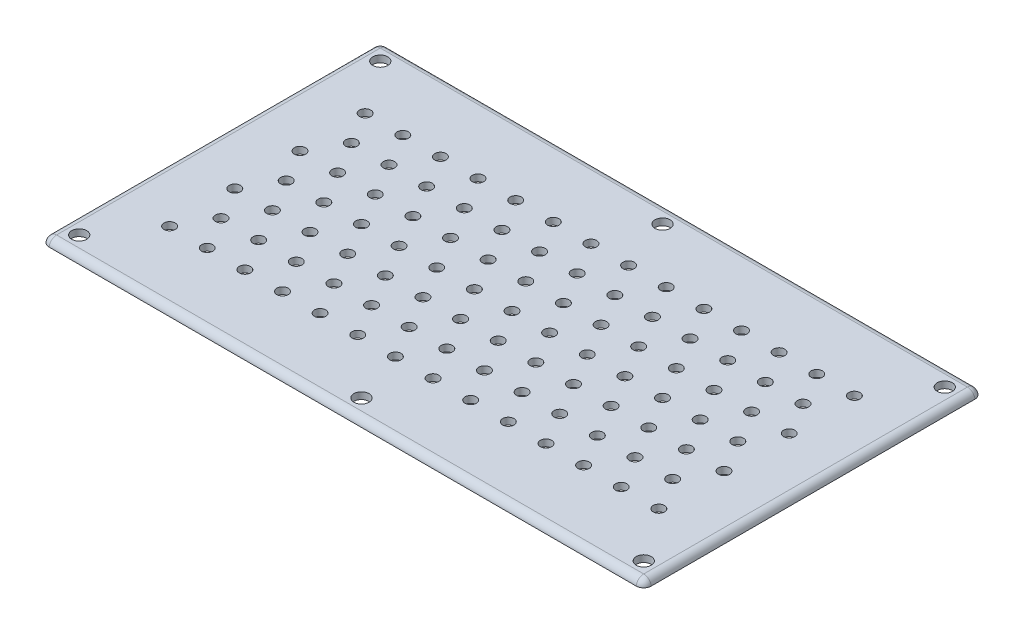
ISO-10303-21;
HEADER;
FILE_DESCRIPTION(('STEP AP214'),'2;1');
FILE_NAME('part.step','',(''),(''),'','','');
FILE_SCHEMA(('AUTOMOTIVE_DESIGN { 1 0 10303 214 1 1 1 1 }'));
ENDSEC;
DATA;
#1=APPLICATION_CONTEXT('core data for automotive mechanical design processes');
#2=APPLICATION_PROTOCOL_DEFINITION('international standard','automotive_design',2000,#1);
#3=PRODUCT_CONTEXT('',#1,'mechanical');
#4=PRODUCT('Part','Part','',(#3));
#5=PRODUCT_RELATED_PRODUCT_CATEGORY('part','',(#4));
#6=PRODUCT_DEFINITION_FORMATION('','',#4);
#7=PRODUCT_DEFINITION_CONTEXT('part definition',#1,'design');
#8=PRODUCT_DEFINITION('design','',#6,#7);
#9=PRODUCT_DEFINITION_SHAPE('','',#8);
#10=(LENGTH_UNIT() NAMED_UNIT(*) SI_UNIT(.MILLI.,.METRE.));
#11=(NAMED_UNIT(*) PLANE_ANGLE_UNIT() SI_UNIT($,.RADIAN.));
#12=(NAMED_UNIT(*) SI_UNIT($,.STERADIAN.) SOLID_ANGLE_UNIT());
#13=UNCERTAINTY_MEASURE_WITH_UNIT(LENGTH_MEASURE(1.E-05),#10,'distance_accuracy_value','');
#14=(GEOMETRIC_REPRESENTATION_CONTEXT(3) GLOBAL_UNCERTAINTY_ASSIGNED_CONTEXT((#13)) GLOBAL_UNIT_ASSIGNED_CONTEXT((#10,
#11,#12)) REPRESENTATION_CONTEXT('',''));
#15=CARTESIAN_POINT('',(0.,0.,0.));
#16=DIRECTION('',(0.,0.,1.));
#17=DIRECTION('',(1.,0.,0.));
#18=AXIS2_PLACEMENT_3D('',#15,#16,#17);
#19=CARTESIAN_POINT('',(0.,1.8,0.));
#20=DIRECTION('',(0.,1.,0.));
#21=DIRECTION('',(0.,0.,1.));
#22=AXIS2_PLACEMENT_3D('',#19,#20,#21);
#23=PLANE('',#22);
#24=DIRECTION('',(0.,0.,1.));
#25=VECTOR('',#24,1.);
#26=CARTESIAN_POINT('',(78.0100251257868,1.8,-43.));
#27=LINE('',#26,#25);
#28=CARTESIAN_POINT('',(78.0100251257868,1.8,43.));
#29=VERTEX_POINT('',#28);
#30=CARTESIAN_POINT('',(78.0100251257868,1.8,-43.));
#31=VERTEX_POINT('',#30);
#32=EDGE_CURVE('E65',#29,#31,#27,.F.);
#33=ORIENTED_EDGE('',*,*,#32,.T.);
#34=CARTESIAN_POINT('',(78.,1.8,-43.));
#35=DIRECTION('',(0.,1.,0.));
#36=DIRECTION('',(0.,0.,1.));
#37=AXIS2_PLACEMENT_3D('',#34,#35,#36);
#38=CIRCLE('',#37,0.0100251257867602);
#39=CARTESIAN_POINT('',(78.,1.8,-43.0100251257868));
#40=VERTEX_POINT('',#39);
#41=EDGE_CURVE('E12',#31,#40,#38,.T.);
#42=ORIENTED_EDGE('',*,*,#41,.T.);
#43=DIRECTION('',(1.,0.,0.));
#44=VECTOR('',#43,1.);
#45=CARTESIAN_POINT('',(-78.,1.8,-43.0100251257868));
#46=LINE('',#45,#44);
#47=CARTESIAN_POINT('',(-78.,1.8,-43.0100251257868));
#48=VERTEX_POINT('',#47);
#49=EDGE_CURVE('E142',#40,#48,#46,.F.);
#50=ORIENTED_EDGE('',*,*,#49,.T.);
#51=CARTESIAN_POINT('',(-78.,1.8,-43.));
#52=DIRECTION('',(0.,1.,0.));
#53=DIRECTION('',(0.,0.,1.));
#54=AXIS2_PLACEMENT_3D('',#51,#52,#53);
#55=CIRCLE('',#54,0.0100251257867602);
#56=CARTESIAN_POINT('',(-78.0100251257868,1.8,-43.));
#57=VERTEX_POINT('',#56);
#58=EDGE_CURVE('E1000',#48,#57,#55,.T.);
#59=ORIENTED_EDGE('',*,*,#58,.T.);
#60=DIRECTION('',(0.,0.,-1.));
#61=VECTOR('',#60,1.);
#62=CARTESIAN_POINT('',(-78.0100251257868,1.8,43.));
#63=LINE('',#62,#61);
#64=CARTESIAN_POINT('',(-78.0100251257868,1.8,43.));
#65=VERTEX_POINT('',#64);
#66=EDGE_CURVE('E1003',#57,#65,#63,.F.);
#67=ORIENTED_EDGE('',*,*,#66,.T.);
#68=CARTESIAN_POINT('',(-78.,1.8,43.));
#69=DIRECTION('',(0.,1.,0.));
#70=DIRECTION('',(0.,0.,1.));
#71=AXIS2_PLACEMENT_3D('',#68,#69,#70);
#72=CIRCLE('',#71,0.0100251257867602);
#73=CARTESIAN_POINT('',(-78.,1.8,43.0100251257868));
#74=VERTEX_POINT('',#73);
#75=EDGE_CURVE('E1006',#65,#74,#72,.T.);
#76=ORIENTED_EDGE('',*,*,#75,.T.);
#77=DIRECTION('',(-1.,0.,0.));
#78=VECTOR('',#77,1.);
#79=CARTESIAN_POINT('',(78.,1.8,43.0100251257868));
#80=LINE('',#79,#78);
#81=CARTESIAN_POINT('',(78.,1.8,43.0100251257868));
#82=VERTEX_POINT('',#81);
#83=EDGE_CURVE('E1009',#74,#82,#80,.F.);
#84=ORIENTED_EDGE('',*,*,#83,.T.);
#85=CARTESIAN_POINT('',(78.,1.8,43.));
#86=DIRECTION('',(0.,1.,0.));
#87=DIRECTION('',(0.,0.,1.));
#88=AXIS2_PLACEMENT_3D('',#85,#86,#87);
#89=CIRCLE('',#88,0.0100251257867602);
#90=EDGE_CURVE('E76',#82,#29,#89,.T.);
#91=ORIENTED_EDGE('',*,*,#90,.T.);
#92=EDGE_LOOP('',(#33,#42,#50,#59,#67,#76,#84,#91));
#93=FACE_BOUND('',#92,.T.);
#94=CARTESIAN_POINT('',(0.,1.8,-40.));
#95=DIRECTION('',(0.,1.,0.));
#96=DIRECTION('',(0.,0.,1.));
#97=AXIS2_PLACEMENT_3D('',#94,#95,#96);
#98=CIRCLE('',#97,2.);
#99=CARTESIAN_POINT('',(0.,1.8,-38.));
#100=VERTEX_POINT('',#99);
#101=EDGE_CURVE('E175',#100,#100,#98,.T.);
#102=ORIENTED_EDGE('',*,*,#101,.F.);
#103=EDGE_LOOP('',(#102));
#104=FACE_BOUND('',#103,.T.);
#105=CARTESIAN_POINT('',(0.,1.8,40.));
#106=DIRECTION('',(0.,1.,0.));
#107=DIRECTION('',(0.,0.,1.));
#108=AXIS2_PLACEMENT_3D('',#105,#106,#107);
#109=CIRCLE('',#108,2.00000000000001);
#110=CARTESIAN_POINT('',(0.,1.8,42.));
#111=VERTEX_POINT('',#110);
#112=EDGE_CURVE('E169',#111,#111,#109,.T.);
#113=ORIENTED_EDGE('',*,*,#112,.F.);
#114=EDGE_LOOP('',(#113));
#115=FACE_BOUND('',#114,.T.);
#116=CARTESIAN_POINT('',(-15.,1.8,8.66025403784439));
#117=DIRECTION('',(0.,1.,0.));
#118=DIRECTION('',(1.,0.,0.));
#119=AXIS2_PLACEMENT_3D('',#116,#117,#118);
#120=CIRCLE('',#119,1.5);
#121=CARTESIAN_POINT('',(-13.5,1.8,8.66025403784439));
#122=VERTEX_POINT('',#121);
#123=EDGE_CURVE('E591',#122,#122,#120,.T.);
#124=ORIENTED_EDGE('',*,*,#123,.F.);
#125=EDGE_LOOP('',(#124));
#126=FACE_BOUND('',#125,.T.);
#127=CARTESIAN_POINT('',(-25.0000000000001,1.8,8.66025403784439));
#128=DIRECTION('',(0.,1.,0.));
#129=DIRECTION('',(1.,0.,0.));
#130=AXIS2_PLACEMENT_3D('',#127,#128,#129);
#131=CIRCLE('',#130,1.5);
#132=CARTESIAN_POINT('',(-23.5000000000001,1.8,8.66025403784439));
#133=VERTEX_POINT('',#132);
#134=EDGE_CURVE('E599',#133,#133,#131,.T.);
#135=ORIENTED_EDGE('',*,*,#134,.F.);
#136=EDGE_LOOP('',(#135));
#137=FACE_BOUND('',#136,.T.);
#138=CARTESIAN_POINT('',(-35.0000000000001,1.8,8.66025403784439));
#139=DIRECTION('',(0.,1.,0.));
#140=DIRECTION('',(1.,0.,0.));
#141=AXIS2_PLACEMENT_3D('',#138,#139,#140);
#142=CIRCLE('',#141,1.5);
#143=CARTESIAN_POINT('',(-33.5000000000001,1.8,8.66025403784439));
#144=VERTEX_POINT('',#143);
#145=EDGE_CURVE('E607',#144,#144,#142,.T.);
#146=ORIENTED_EDGE('',*,*,#145,.F.);
#147=EDGE_LOOP('',(#146));
#148=FACE_BOUND('',#147,.T.);
#149=CARTESIAN_POINT('',(-45.0000000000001,1.8,8.66025403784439));
#150=DIRECTION('',(0.,1.,0.));
#151=DIRECTION('',(1.,0.,0.));
#152=AXIS2_PLACEMENT_3D('',#149,#150,#151);
#153=CIRCLE('',#152,1.5);
#154=CARTESIAN_POINT('',(-43.5000000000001,1.8,8.66025403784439));
#155=VERTEX_POINT('',#154);
#156=EDGE_CURVE('E558',#155,#155,#153,.T.);
#157=ORIENTED_EDGE('',*,*,#156,.F.);
#158=EDGE_LOOP('',(#157));
#159=FACE_BOUND('',#158,.T.);
#160=CARTESIAN_POINT('',(-55.0000000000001,1.8,8.66025403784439));
#161=DIRECTION('',(0.,1.,0.));
#162=DIRECTION('',(1.,0.,0.));
#163=AXIS2_PLACEMENT_3D('',#160,#161,#162);
#164=CIRCLE('',#163,1.5);
#165=CARTESIAN_POINT('',(-53.5000000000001,1.8,8.66025403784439));
#166=VERTEX_POINT('',#165);
#167=EDGE_CURVE('E559',#166,#166,#164,.T.);
#168=ORIENTED_EDGE('',*,*,#167,.F.);
#169=EDGE_LOOP('',(#168));
#170=FACE_BOUND('',#169,.T.);
#171=CARTESIAN_POINT('',(-65.0000000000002,1.8,8.66025403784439));
#172=DIRECTION('',(0.,1.,0.));
#173=DIRECTION('',(1.,0.,0.));
#174=AXIS2_PLACEMENT_3D('',#171,#172,#173);
#175=CIRCLE('',#174,1.5);
#176=CARTESIAN_POINT('',(-63.5000000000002,1.8,8.66025403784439));
#177=VERTEX_POINT('',#176);
#178=EDGE_CURVE('E567',#177,#177,#175,.T.);
#179=ORIENTED_EDGE('',*,*,#178,.F.);
#180=EDGE_LOOP('',(#179));
#181=FACE_BOUND('',#180,.T.);
#182=CARTESIAN_POINT('',(50.0000000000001,1.8,-17.3205080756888));
#183=DIRECTION('',(0.,1.,0.));
#184=DIRECTION('',(1.,0.,0.));
#185=AXIS2_PLACEMENT_3D('',#182,#183,#184);
#186=CIRCLE('',#185,1.5);
#187=CARTESIAN_POINT('',(51.5000000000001,1.8,-17.3205080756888));
#188=VERTEX_POINT('',#187);
#189=EDGE_CURVE('E575',#188,#188,#186,.T.);
#190=ORIENTED_EDGE('',*,*,#189,.F.);
#191=EDGE_LOOP('',(#190));
#192=FACE_BOUND('',#191,.T.);
#193=CARTESIAN_POINT('',(50.0000000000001,1.8,0.));
#194=DIRECTION('',(0.,1.,0.));
#195=DIRECTION('',(1.,0.,0.));
#196=AXIS2_PLACEMENT_3D('',#193,#194,#195);
#197=CIRCLE('',#196,1.5);
#198=CARTESIAN_POINT('',(51.5000000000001,1.8,0.));
#199=VERTEX_POINT('',#198);
#200=EDGE_CURVE('E494',#199,#199,#197,.T.);
#201=ORIENTED_EDGE('',*,*,#200,.F.);
#202=EDGE_LOOP('',(#201));
#203=FACE_BOUND('',#202,.T.);
#204=CARTESIAN_POINT('',(-5.00000000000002,1.8,8.66025403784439));
#205=DIRECTION('',(0.,1.,0.));
#206=DIRECTION('',(1.,0.,0.));
#207=AXIS2_PLACEMENT_3D('',#204,#205,#206);
#208=CIRCLE('',#207,1.5);
#209=CARTESIAN_POINT('',(-3.50000000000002,1.8,8.66025403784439));
#210=VERTEX_POINT('',#209);
#211=EDGE_CURVE('E590',#210,#210,#208,.T.);
#212=ORIENTED_EDGE('',*,*,#211,.F.);
#213=EDGE_LOOP('',(#212));
#214=FACE_BOUND('',#213,.T.);
#215=CARTESIAN_POINT('',(5.00000000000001,1.8,8.66025403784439));
#216=DIRECTION('',(0.,1.,0.));
#217=DIRECTION('',(1.,0.,0.));
#218=AXIS2_PLACEMENT_3D('',#215,#216,#217);
#219=CIRCLE('',#218,1.5);
#220=CARTESIAN_POINT('',(6.50000000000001,1.8,8.66025403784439));
#221=VERTEX_POINT('',#220);
#222=EDGE_CURVE('E671',#221,#221,#219,.T.);
#223=ORIENTED_EDGE('',*,*,#222,.F.);
#224=EDGE_LOOP('',(#223));
#225=FACE_BOUND('',#224,.T.);
#226=CARTESIAN_POINT('',(15.,1.8,8.66025403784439));
#227=DIRECTION('',(0.,1.,0.));
#228=DIRECTION('',(1.,0.,0.));
#229=AXIS2_PLACEMENT_3D('',#226,#227,#228);
#230=CIRCLE('',#229,1.5);
#231=CARTESIAN_POINT('',(16.5,1.8,8.66025403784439));
#232=VERTEX_POINT('',#231);
#233=EDGE_CURVE('E663',#232,#232,#230,.T.);
#234=ORIENTED_EDGE('',*,*,#233,.F.);
#235=EDGE_LOOP('',(#234));
#236=FACE_BOUND('',#235,.T.);
#237=CARTESIAN_POINT('',(25.,1.8,8.66025403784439));
#238=DIRECTION('',(0.,1.,0.));
#239=DIRECTION('',(1.,0.,0.));
#240=AXIS2_PLACEMENT_3D('',#237,#238,#239);
#241=CIRCLE('',#240,1.5);
#242=CARTESIAN_POINT('',(26.5,1.8,8.66025403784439));
#243=VERTEX_POINT('',#242);
#244=EDGE_CURVE('E655',#243,#243,#241,.T.);
#245=ORIENTED_EDGE('',*,*,#244,.F.);
#246=EDGE_LOOP('',(#245));
#247=FACE_BOUND('',#246,.T.);
#248=CARTESIAN_POINT('',(35.0000000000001,1.8,8.66025403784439));
#249=DIRECTION('',(0.,1.,0.));
#250=DIRECTION('',(1.,0.,0.));
#251=AXIS2_PLACEMENT_3D('',#248,#249,#250);
#252=CIRCLE('',#251,1.5);
#253=CARTESIAN_POINT('',(36.5000000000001,1.8,8.66025403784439));
#254=VERTEX_POINT('',#253);
#255=EDGE_CURVE('E647',#254,#254,#252,.T.);
#256=ORIENTED_EDGE('',*,*,#255,.F.);
#257=EDGE_LOOP('',(#256));
#258=FACE_BOUND('',#257,.T.);
#259=CARTESIAN_POINT('',(45.0000000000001,1.8,8.66025403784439));
#260=DIRECTION('',(0.,1.,0.));
#261=DIRECTION('',(1.,0.,0.));
#262=AXIS2_PLACEMENT_3D('',#259,#260,#261);
#263=CIRCLE('',#262,1.5);
#264=CARTESIAN_POINT('',(46.5000000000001,1.8,8.66025403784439));
#265=VERTEX_POINT('',#264);
#266=EDGE_CURVE('E639',#265,#265,#263,.T.);
#267=ORIENTED_EDGE('',*,*,#266,.F.);
#268=EDGE_LOOP('',(#267));
#269=FACE_BOUND('',#268,.T.);
#270=CARTESIAN_POINT('',(55.0000000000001,1.8,8.66025403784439));
#271=DIRECTION('',(0.,1.,0.));
#272=DIRECTION('',(1.,0.,0.));
#273=AXIS2_PLACEMENT_3D('',#270,#271,#272);
#274=CIRCLE('',#273,1.5);
#275=CARTESIAN_POINT('',(56.5000000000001,1.8,8.66025403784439));
#276=VERTEX_POINT('',#275);
#277=EDGE_CURVE('E631',#276,#276,#274,.T.);
#278=ORIENTED_EDGE('',*,*,#277,.F.);
#279=EDGE_LOOP('',(#278));
#280=FACE_BOUND('',#279,.T.);
#281=CARTESIAN_POINT('',(55.0000000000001,1.8,-8.66025403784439));
#282=DIRECTION('',(0.,1.,0.));
#283=DIRECTION('',(1.,0.,0.));
#284=AXIS2_PLACEMENT_3D('',#281,#282,#283);
#285=CIRCLE('',#284,1.5);
#286=CARTESIAN_POINT('',(56.5000000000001,1.8,-8.66025403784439));
#287=VERTEX_POINT('',#286);
#288=EDGE_CURVE('E623',#287,#287,#285,.T.);
#289=ORIENTED_EDGE('',*,*,#288,.F.);
#290=EDGE_LOOP('',(#289));
#291=FACE_BOUND('',#290,.T.);
#292=CARTESIAN_POINT('',(45.0000000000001,1.8,-25.9807621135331));
#293=DIRECTION('',(0.,1.,0.));
#294=DIRECTION('',(1.,0.,0.));
#295=AXIS2_PLACEMENT_3D('',#292,#293,#294);
#296=CIRCLE('',#295,1.5);
#297=CARTESIAN_POINT('',(46.5000000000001,1.8,-25.9807621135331));
#298=VERTEX_POINT('',#297);
#299=EDGE_CURVE('E430',#298,#298,#296,.T.);
#300=ORIENTED_EDGE('',*,*,#299,.F.);
#301=EDGE_LOOP('',(#300));
#302=FACE_BOUND('',#301,.T.);
#303=CARTESIAN_POINT('',(-60.0000000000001,1.8,0.));
#304=DIRECTION('',(0.,1.,0.));
#305=DIRECTION('',(1.,0.,0.));
#306=AXIS2_PLACEMENT_3D('',#303,#304,#305);
#307=CIRCLE('',#306,1.5);
#308=CARTESIAN_POINT('',(-58.5000000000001,1.8,0.));
#309=VERTEX_POINT('',#308);
#310=EDGE_CURVE('E463',#309,#309,#307,.T.);
#311=ORIENTED_EDGE('',*,*,#310,.F.);
#312=EDGE_LOOP('',(#311));
#313=FACE_BOUND('',#312,.T.);
#314=CARTESIAN_POINT('',(-50.0000000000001,1.8,0.));
#315=DIRECTION('',(0.,1.,0.));
#316=DIRECTION('',(1.,0.,0.));
#317=AXIS2_PLACEMENT_3D('',#314,#315,#316);
#318=CIRCLE('',#317,1.5);
#319=CARTESIAN_POINT('',(-48.5000000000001,1.8,0.));
#320=VERTEX_POINT('',#319);
#321=EDGE_CURVE('E462',#320,#320,#318,.T.);
#322=ORIENTED_EDGE('',*,*,#321,.F.);
#323=EDGE_LOOP('',(#322));
#324=FACE_BOUND('',#323,.T.);
#325=CARTESIAN_POINT('',(-40.0000000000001,1.8,0.));
#326=DIRECTION('',(0.,1.,0.));
#327=DIRECTION('',(1.,0.,0.));
#328=AXIS2_PLACEMENT_3D('',#325,#326,#327);
#329=CIRCLE('',#328,1.5);
#330=CARTESIAN_POINT('',(-38.5000000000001,1.8,0.));
#331=VERTEX_POINT('',#330);
#332=EDGE_CURVE('E479',#331,#331,#329,.T.);
#333=ORIENTED_EDGE('',*,*,#332,.F.);
#334=EDGE_LOOP('',(#333));
#335=FACE_BOUND('',#334,.T.);
#336=CARTESIAN_POINT('',(45.0000000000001,1.8,-8.66025403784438));
#337=DIRECTION('',(0.,1.,0.));
#338=DIRECTION('',(1.,0.,0.));
#339=AXIS2_PLACEMENT_3D('',#336,#337,#338);
#340=CIRCLE('',#339,1.5);
#341=CARTESIAN_POINT('',(46.5000000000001,1.8,-8.66025403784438));
#342=VERTEX_POINT('',#341);
#343=EDGE_CURVE('E431',#342,#342,#340,.T.);
#344=ORIENTED_EDGE('',*,*,#343,.F.);
#345=EDGE_LOOP('',(#344));
#346=FACE_BOUND('',#345,.T.);
#347=CARTESIAN_POINT('',(35.0000000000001,1.8,-8.66025403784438));
#348=DIRECTION('',(0.,1.,0.));
#349=DIRECTION('',(1.,0.,0.));
#350=AXIS2_PLACEMENT_3D('',#347,#348,#349);
#351=CIRCLE('',#350,1.5);
#352=CARTESIAN_POINT('',(36.5000000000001,1.8,-8.66025403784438));
#353=VERTEX_POINT('',#352);
#354=EDGE_CURVE('E439',#353,#353,#351,.T.);
#355=ORIENTED_EDGE('',*,*,#354,.F.);
#356=EDGE_LOOP('',(#355));
#357=FACE_BOUND('',#356,.T.);
#358=CARTESIAN_POINT('',(25.,1.8,-8.66025403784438));
#359=DIRECTION('',(0.,1.,0.));
#360=DIRECTION('',(1.,0.,0.));
#361=AXIS2_PLACEMENT_3D('',#358,#359,#360);
#362=CIRCLE('',#361,1.5);
#363=CARTESIAN_POINT('',(26.5,1.8,-8.66025403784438));
#364=VERTEX_POINT('',#363);
#365=EDGE_CURVE('E447',#364,#364,#362,.T.);
#366=ORIENTED_EDGE('',*,*,#365,.F.);
#367=EDGE_LOOP('',(#366));
#368=FACE_BOUND('',#367,.T.);
#369=CARTESIAN_POINT('',(15.,1.8,-8.66025403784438));
#370=DIRECTION('',(0.,1.,0.));
#371=DIRECTION('',(1.,0.,0.));
#372=AXIS2_PLACEMENT_3D('',#369,#370,#371);
#373=CIRCLE('',#372,1.5);
#374=CARTESIAN_POINT('',(16.5,1.8,-8.66025403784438));
#375=VERTEX_POINT('',#374);
#376=EDGE_CURVE('E302',#375,#375,#373,.T.);
#377=ORIENTED_EDGE('',*,*,#376,.F.);
#378=EDGE_LOOP('',(#377));
#379=FACE_BOUND('',#378,.T.);
#380=CARTESIAN_POINT('',(-30.0000000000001,1.8,0.));
#381=DIRECTION('',(0.,1.,0.));
#382=DIRECTION('',(1.,0.,0.));
#383=AXIS2_PLACEMENT_3D('',#380,#381,#382);
#384=CIRCLE('',#383,1.5);
#385=CARTESIAN_POINT('',(-28.5000000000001,1.8,0.));
#386=VERTEX_POINT('',#385);
#387=EDGE_CURVE('E478',#386,#386,#384,.T.);
#388=ORIENTED_EDGE('',*,*,#387,.F.);
#389=EDGE_LOOP('',(#388));
#390=FACE_BOUND('',#389,.T.);
#391=CARTESIAN_POINT('',(-20.,1.8,0.));
#392=DIRECTION('',(0.,1.,0.));
#393=DIRECTION('',(1.,0.,0.));
#394=AXIS2_PLACEMENT_3D('',#391,#392,#393);
#395=CIRCLE('',#394,1.5);
#396=CARTESIAN_POINT('',(-18.5,1.8,0.));
#397=VERTEX_POINT('',#396);
#398=EDGE_CURVE('E543',#397,#397,#395,.T.);
#399=ORIENTED_EDGE('',*,*,#398,.F.);
#400=EDGE_LOOP('',(#399));
#401=FACE_BOUND('',#400,.T.);
#402=CARTESIAN_POINT('',(-10.,1.8,0.));
#403=DIRECTION('',(0.,1.,0.));
#404=DIRECTION('',(1.,0.,0.));
#405=AXIS2_PLACEMENT_3D('',#402,#403,#404);
#406=CIRCLE('',#405,1.5);
#407=CARTESIAN_POINT('',(-8.50000000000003,1.8,0.));
#408=VERTEX_POINT('',#407);
#409=EDGE_CURVE('E535',#408,#408,#406,.T.);
#410=ORIENTED_EDGE('',*,*,#409,.F.);
#411=EDGE_LOOP('',(#410));
#412=FACE_BOUND('',#411,.T.);
#413=CARTESIAN_POINT('',(0.,1.8,0.));
#414=DIRECTION('',(0.,1.,0.));
#415=DIRECTION('',(1.,0.,0.));
#416=AXIS2_PLACEMENT_3D('',#413,#414,#415);
#417=CIRCLE('',#416,1.5);
#418=CARTESIAN_POINT('',(1.50000000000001,1.8,0.));
#419=VERTEX_POINT('',#418);
#420=EDGE_CURVE('E527',#419,#419,#417,.T.);
#421=ORIENTED_EDGE('',*,*,#420,.F.);
#422=EDGE_LOOP('',(#421));
#423=FACE_BOUND('',#422,.T.);
#424=CARTESIAN_POINT('',(10.,1.8,0.));
#425=DIRECTION('',(0.,1.,0.));
#426=DIRECTION('',(1.,0.,0.));
#427=AXIS2_PLACEMENT_3D('',#424,#425,#426);
#428=CIRCLE('',#427,1.5);
#429=CARTESIAN_POINT('',(11.5,1.8,0.));
#430=VERTEX_POINT('',#429);
#431=EDGE_CURVE('E519',#430,#430,#428,.T.);
#432=ORIENTED_EDGE('',*,*,#431,.F.);
#433=EDGE_LOOP('',(#432));
#434=FACE_BOUND('',#433,.T.);
#435=CARTESIAN_POINT('',(20.,1.8,0.));
#436=DIRECTION('',(0.,1.,0.));
#437=DIRECTION('',(1.,0.,0.));
#438=AXIS2_PLACEMENT_3D('',#435,#436,#437);
#439=CIRCLE('',#438,1.5);
#440=CARTESIAN_POINT('',(21.5,1.8,0.));
#441=VERTEX_POINT('',#440);
#442=EDGE_CURVE('E511',#441,#441,#439,.T.);
#443=ORIENTED_EDGE('',*,*,#442,.F.);
#444=EDGE_LOOP('',(#443));
#445=FACE_BOUND('',#444,.T.);
#446=CARTESIAN_POINT('',(30.0000000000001,1.8,0.));
#447=DIRECTION('',(0.,1.,0.));
#448=DIRECTION('',(1.,0.,0.));
#449=AXIS2_PLACEMENT_3D('',#446,#447,#448);
#450=CIRCLE('',#449,1.5);
#451=CARTESIAN_POINT('',(31.5000000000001,1.8,0.));
#452=VERTEX_POINT('',#451);
#453=EDGE_CURVE('E503',#452,#452,#450,.T.);
#454=ORIENTED_EDGE('',*,*,#453,.F.);
#455=EDGE_LOOP('',(#454));
#456=FACE_BOUND('',#455,.T.);
#457=CARTESIAN_POINT('',(40.0000000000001,1.8,0.));
#458=DIRECTION('',(0.,1.,0.));
#459=DIRECTION('',(1.,0.,0.));
#460=AXIS2_PLACEMENT_3D('',#457,#458,#459);
#461=CIRCLE('',#460,1.5);
#462=CARTESIAN_POINT('',(41.5000000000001,1.8,0.));
#463=VERTEX_POINT('',#462);
#464=EDGE_CURVE('E495',#463,#463,#461,.T.);
#465=ORIENTED_EDGE('',*,*,#464,.F.);
#466=EDGE_LOOP('',(#465));
#467=FACE_BOUND('',#466,.T.);
#468=CARTESIAN_POINT('',(65.0000000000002,1.8,-8.66025403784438));
#469=DIRECTION('',(0.,1.,0.));
#470=DIRECTION('',(1.,0.,0.));
#471=AXIS2_PLACEMENT_3D('',#468,#469,#470);
#472=CIRCLE('',#471,1.5);
#473=CARTESIAN_POINT('',(66.5000000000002,1.8,-8.66025403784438));
#474=VERTEX_POINT('',#473);
#475=EDGE_CURVE('E815',#474,#474,#472,.T.);
#476=ORIENTED_EDGE('',*,*,#475,.F.);
#477=EDGE_LOOP('',(#476));
#478=FACE_BOUND('',#477,.T.);
#479=CARTESIAN_POINT('',(65.0000000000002,1.8,8.66025403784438));
#480=DIRECTION('',(0.,1.,0.));
#481=DIRECTION('',(1.,0.,0.));
#482=AXIS2_PLACEMENT_3D('',#479,#480,#481);
#483=CIRCLE('',#482,1.5);
#484=CARTESIAN_POINT('',(66.5000000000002,1.8,8.66025403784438));
#485=VERTEX_POINT('',#484);
#486=EDGE_CURVE('E823',#485,#485,#483,.T.);
#487=ORIENTED_EDGE('',*,*,#486,.F.);
#488=EDGE_LOOP('',(#487));
#489=FACE_BOUND('',#488,.T.);
#490=CARTESIAN_POINT('',(65.0000000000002,1.8,25.9807621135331));
#491=DIRECTION('',(0.,1.,0.));
#492=DIRECTION('',(1.,0.,0.));
#493=AXIS2_PLACEMENT_3D('',#490,#491,#492);
#494=CIRCLE('',#493,1.5);
#495=CARTESIAN_POINT('',(66.5000000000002,1.8,25.9807621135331));
#496=VERTEX_POINT('',#495);
#497=EDGE_CURVE('E831',#496,#496,#494,.T.);
#498=ORIENTED_EDGE('',*,*,#497,.F.);
#499=EDGE_LOOP('',(#498));
#500=FACE_BOUND('',#499,.T.);
#501=CARTESIAN_POINT('',(55.0000000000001,1.8,25.9807621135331));
#502=DIRECTION('',(0.,1.,0.));
#503=DIRECTION('',(1.,0.,0.));
#504=AXIS2_PLACEMENT_3D('',#501,#502,#503);
#505=CIRCLE('',#504,1.5);
#506=CARTESIAN_POINT('',(56.5000000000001,1.8,25.9807621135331));
#507=VERTEX_POINT('',#506);
#508=EDGE_CURVE('E839',#507,#507,#505,.T.);
#509=ORIENTED_EDGE('',*,*,#508,.F.);
#510=EDGE_LOOP('',(#509));
#511=FACE_BOUND('',#510,.T.);
#512=CARTESIAN_POINT('',(45.0000000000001,1.8,25.9807621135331));
#513=DIRECTION('',(0.,1.,0.));
#514=DIRECTION('',(1.,0.,0.));
#515=AXIS2_PLACEMENT_3D('',#512,#513,#514);
#516=CIRCLE('',#515,1.5);
#517=CARTESIAN_POINT('',(46.5000000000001,1.8,25.9807621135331));
#518=VERTEX_POINT('',#517);
#519=EDGE_CURVE('E847',#518,#518,#516,.T.);
#520=ORIENTED_EDGE('',*,*,#519,.F.);
#521=EDGE_LOOP('',(#520));
#522=FACE_BOUND('',#521,.T.);
#523=CARTESIAN_POINT('',(35.0000000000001,1.8,25.9807621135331));
#524=DIRECTION('',(0.,1.,0.));
#525=DIRECTION('',(1.,0.,0.));
#526=AXIS2_PLACEMENT_3D('',#523,#524,#525);
#527=CIRCLE('',#526,1.5);
#528=CARTESIAN_POINT('',(36.5000000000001,1.8,25.9807621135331));
#529=VERTEX_POINT('',#528);
#530=EDGE_CURVE('E855',#529,#529,#527,.T.);
#531=ORIENTED_EDGE('',*,*,#530,.F.);
#532=EDGE_LOOP('',(#531));
#533=FACE_BOUND('',#532,.T.);
#534=CARTESIAN_POINT('',(25.,1.8,25.9807621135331));
#535=DIRECTION('',(0.,1.,0.));
#536=DIRECTION('',(1.,0.,0.));
#537=AXIS2_PLACEMENT_3D('',#534,#535,#536);
#538=CIRCLE('',#537,1.5);
#539=CARTESIAN_POINT('',(26.5,1.8,25.9807621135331));
#540=VERTEX_POINT('',#539);
#541=EDGE_CURVE('E863',#540,#540,#538,.T.);
#542=ORIENTED_EDGE('',*,*,#541,.F.);
#543=EDGE_LOOP('',(#542));
#544=FACE_BOUND('',#543,.T.);
#545=CARTESIAN_POINT('',(15.,1.8,25.9807621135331));
#546=DIRECTION('',(0.,1.,0.));
#547=DIRECTION('',(1.,0.,0.));
#548=AXIS2_PLACEMENT_3D('',#545,#546,#547);
#549=CIRCLE('',#548,1.5);
#550=CARTESIAN_POINT('',(16.5,1.8,25.9807621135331));
#551=VERTEX_POINT('',#550);
#552=EDGE_CURVE('E871',#551,#551,#549,.T.);
#553=ORIENTED_EDGE('',*,*,#552,.F.);
#554=EDGE_LOOP('',(#553));
#555=FACE_BOUND('',#554,.T.);
#556=CARTESIAN_POINT('',(5.00000000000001,1.8,25.9807621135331));
#557=DIRECTION('',(0.,1.,0.));
#558=DIRECTION('',(1.,0.,0.));
#559=AXIS2_PLACEMENT_3D('',#556,#557,#558);
#560=CIRCLE('',#559,1.5);
#561=CARTESIAN_POINT('',(6.50000000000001,1.8,25.9807621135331));
#562=VERTEX_POINT('',#561);
#563=EDGE_CURVE('E879',#562,#562,#560,.T.);
#564=ORIENTED_EDGE('',*,*,#563,.F.);
#565=EDGE_LOOP('',(#564));
#566=FACE_BOUND('',#565,.T.);
#567=CARTESIAN_POINT('',(-5.00000000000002,1.8,25.9807621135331));
#568=DIRECTION('',(0.,1.,0.));
#569=DIRECTION('',(1.,0.,0.));
#570=AXIS2_PLACEMENT_3D('',#567,#568,#569);
#571=CIRCLE('',#570,1.5);
#572=CARTESIAN_POINT('',(-3.50000000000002,1.8,25.9807621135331));
#573=VERTEX_POINT('',#572);
#574=EDGE_CURVE('E887',#573,#573,#571,.T.);
#575=ORIENTED_EDGE('',*,*,#574,.F.);
#576=EDGE_LOOP('',(#575));
#577=FACE_BOUND('',#576,.T.);
#578=CARTESIAN_POINT('',(-15.,1.8,25.9807621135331));
#579=DIRECTION('',(0.,1.,0.));
#580=DIRECTION('',(1.,0.,0.));
#581=AXIS2_PLACEMENT_3D('',#578,#579,#580);
#582=CIRCLE('',#581,1.5);
#583=CARTESIAN_POINT('',(-13.5,1.8,25.9807621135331));
#584=VERTEX_POINT('',#583);
#585=EDGE_CURVE('E895',#584,#584,#582,.T.);
#586=ORIENTED_EDGE('',*,*,#585,.F.);
#587=EDGE_LOOP('',(#586));
#588=FACE_BOUND('',#587,.T.);
#589=CARTESIAN_POINT('',(-25.0000000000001,1.8,25.9807621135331));
#590=DIRECTION('',(0.,1.,0.));
#591=DIRECTION('',(1.,0.,0.));
#592=AXIS2_PLACEMENT_3D('',#589,#590,#591);
#593=CIRCLE('',#592,1.5);
#594=CARTESIAN_POINT('',(-23.5000000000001,1.8,25.9807621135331));
#595=VERTEX_POINT('',#594);
#596=EDGE_CURVE('E903',#595,#595,#593,.T.);
#597=ORIENTED_EDGE('',*,*,#596,.F.);
#598=EDGE_LOOP('',(#597));
#599=FACE_BOUND('',#598,.T.);
#600=CARTESIAN_POINT('',(-35.0000000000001,1.8,25.9807621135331));
#601=DIRECTION('',(0.,1.,0.));
#602=DIRECTION('',(1.,0.,0.));
#603=AXIS2_PLACEMENT_3D('',#600,#601,#602);
#604=CIRCLE('',#603,1.5);
#605=CARTESIAN_POINT('',(-33.5000000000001,1.8,25.9807621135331));
#606=VERTEX_POINT('',#605);
#607=EDGE_CURVE('E911',#606,#606,#604,.T.);
#608=ORIENTED_EDGE('',*,*,#607,.F.);
#609=EDGE_LOOP('',(#608));
#610=FACE_BOUND('',#609,.T.);
#611=CARTESIAN_POINT('',(-45.0000000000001,1.8,25.9807621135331));
#612=DIRECTION('',(0.,1.,0.));
#613=DIRECTION('',(1.,0.,0.));
#614=AXIS2_PLACEMENT_3D('',#611,#612,#613);
#615=CIRCLE('',#614,1.5);
#616=CARTESIAN_POINT('',(-43.5000000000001,1.8,25.9807621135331));
#617=VERTEX_POINT('',#616);
#618=EDGE_CURVE('E919',#617,#617,#615,.T.);
#619=ORIENTED_EDGE('',*,*,#618,.F.);
#620=EDGE_LOOP('',(#619));
#621=FACE_BOUND('',#620,.T.);
#622=CARTESIAN_POINT('',(-55.0000000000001,1.8,25.9807621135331));
#623=DIRECTION('',(0.,1.,0.));
#624=DIRECTION('',(1.,0.,0.));
#625=AXIS2_PLACEMENT_3D('',#622,#623,#624);
#626=CIRCLE('',#625,1.5);
#627=CARTESIAN_POINT('',(-53.5000000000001,1.8,25.9807621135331));
#628=VERTEX_POINT('',#627);
#629=EDGE_CURVE('E927',#628,#628,#626,.T.);
#630=ORIENTED_EDGE('',*,*,#629,.F.);
#631=EDGE_LOOP('',(#630));
#632=FACE_BOUND('',#631,.T.);
#633=CARTESIAN_POINT('',(-65.0000000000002,1.8,25.9807621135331));
#634=DIRECTION('',(0.,1.,0.));
#635=DIRECTION('',(1.,0.,0.));
#636=AXIS2_PLACEMENT_3D('',#633,#634,#635);
#637=CIRCLE('',#636,1.5);
#638=CARTESIAN_POINT('',(-63.5000000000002,1.8,25.9807621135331));
#639=VERTEX_POINT('',#638);
#640=EDGE_CURVE('E750',#639,#639,#637,.T.);
#641=ORIENTED_EDGE('',*,*,#640,.F.);
#642=EDGE_LOOP('',(#641));
#643=FACE_BOUND('',#642,.T.);
#644=CARTESIAN_POINT('',(0.,1.8,17.3205080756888));
#645=DIRECTION('',(0.,1.,0.));
#646=DIRECTION('',(1.,0.,0.));
#647=AXIS2_PLACEMENT_3D('',#644,#645,#646);
#648=CIRCLE('',#647,1.5);
#649=CARTESIAN_POINT('',(1.49999999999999,1.8,17.3205080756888));
#650=VERTEX_POINT('',#649);
#651=EDGE_CURVE('E719',#650,#650,#648,.T.);
#652=ORIENTED_EDGE('',*,*,#651,.F.);
#653=EDGE_LOOP('',(#652));
#654=FACE_BOUND('',#653,.T.);
#655=CARTESIAN_POINT('',(-10.,1.8,17.3205080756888));
#656=DIRECTION('',(0.,1.,0.));
#657=DIRECTION('',(1.,0.,0.));
#658=AXIS2_PLACEMENT_3D('',#655,#656,#657);
#659=CIRCLE('',#658,1.5);
#660=CARTESIAN_POINT('',(-8.50000000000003,1.8,17.3205080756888));
#661=VERTEX_POINT('',#660);
#662=EDGE_CURVE('E727',#661,#661,#659,.T.);
#663=ORIENTED_EDGE('',*,*,#662,.F.);
#664=EDGE_LOOP('',(#663));
#665=FACE_BOUND('',#664,.T.);
#666=CARTESIAN_POINT('',(-20.0000000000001,1.8,17.3205080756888));
#667=DIRECTION('',(0.,1.,0.));
#668=DIRECTION('',(1.,0.,0.));
#669=AXIS2_PLACEMENT_3D('',#666,#667,#668);
#670=CIRCLE('',#669,1.5);
#671=CARTESIAN_POINT('',(-18.5,1.8,17.3205080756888));
#672=VERTEX_POINT('',#671);
#673=EDGE_CURVE('E735',#672,#672,#670,.T.);
#674=ORIENTED_EDGE('',*,*,#673,.F.);
#675=EDGE_LOOP('',(#674));
#676=FACE_BOUND('',#675,.T.);
#677=CARTESIAN_POINT('',(-30.0000000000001,1.8,17.3205080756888));
#678=DIRECTION('',(0.,1.,0.));
#679=DIRECTION('',(1.,0.,0.));
#680=AXIS2_PLACEMENT_3D('',#677,#678,#679);
#681=CIRCLE('',#680,1.5);
#682=CARTESIAN_POINT('',(-28.5000000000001,1.8,17.3205080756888));
#683=VERTEX_POINT('',#682);
#684=EDGE_CURVE('E702',#683,#683,#681,.T.);
#685=ORIENTED_EDGE('',*,*,#684,.F.);
#686=EDGE_LOOP('',(#685));
#687=FACE_BOUND('',#686,.T.);
#688=CARTESIAN_POINT('',(55.0000000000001,1.8,-25.9807621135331));
#689=DIRECTION('',(0.,1.,0.));
#690=DIRECTION('',(1.,0.,0.));
#691=AXIS2_PLACEMENT_3D('',#688,#689,#690);
#692=CIRCLE('',#691,1.5);
#693=CARTESIAN_POINT('',(56.5000000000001,1.8,-25.9807621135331));
#694=VERTEX_POINT('',#693);
#695=EDGE_CURVE('E622',#694,#694,#692,.T.);
#696=ORIENTED_EDGE('',*,*,#695,.F.);
#697=EDGE_LOOP('',(#696));
#698=FACE_BOUND('',#697,.T.);
#699=CARTESIAN_POINT('',(-60.0000000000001,1.8,17.3205080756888));
#700=DIRECTION('',(0.,1.,0.));
#701=DIRECTION('',(1.,0.,0.));
#702=AXIS2_PLACEMENT_3D('',#699,#700,#701);
#703=CIRCLE('',#702,1.5);
#704=CARTESIAN_POINT('',(-58.5000000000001,1.8,17.3205080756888));
#705=VERTEX_POINT('',#704);
#706=EDGE_CURVE('E687',#705,#705,#703,.T.);
#707=ORIENTED_EDGE('',*,*,#706,.F.);
#708=EDGE_LOOP('',(#707));
#709=FACE_BOUND('',#708,.T.);
#710=CARTESIAN_POINT('',(-50.0000000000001,1.8,17.3205080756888));
#711=DIRECTION('',(0.,1.,0.));
#712=DIRECTION('',(1.,0.,0.));
#713=AXIS2_PLACEMENT_3D('',#710,#711,#712);
#714=CIRCLE('',#713,1.5);
#715=CARTESIAN_POINT('',(-48.5000000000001,1.8,17.3205080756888));
#716=VERTEX_POINT('',#715);
#717=EDGE_CURVE('E686',#716,#716,#714,.T.);
#718=ORIENTED_EDGE('',*,*,#717,.F.);
#719=EDGE_LOOP('',(#718));
#720=FACE_BOUND('',#719,.T.);
#721=CARTESIAN_POINT('',(-40.0000000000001,1.8,17.3205080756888));
#722=DIRECTION('',(0.,1.,0.));
#723=DIRECTION('',(1.,0.,0.));
#724=AXIS2_PLACEMENT_3D('',#721,#722,#723);
#725=CIRCLE('',#724,1.5);
#726=CARTESIAN_POINT('',(-38.5000000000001,1.8,17.3205080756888));
#727=VERTEX_POINT('',#726);
#728=EDGE_CURVE('E703',#727,#727,#725,.T.);
#729=ORIENTED_EDGE('',*,*,#728,.F.);
#730=EDGE_LOOP('',(#729));
#731=FACE_BOUND('',#730,.T.);
#732=CARTESIAN_POINT('',(10.,1.8,17.3205080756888));
#733=DIRECTION('',(0.,1.,0.));
#734=DIRECTION('',(1.,0.,0.));
#735=AXIS2_PLACEMENT_3D('',#732,#733,#734);
#736=CIRCLE('',#735,1.5);
#737=CARTESIAN_POINT('',(11.5,1.8,17.3205080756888));
#738=VERTEX_POINT('',#737);
#739=EDGE_CURVE('E718',#738,#738,#736,.T.);
#740=ORIENTED_EDGE('',*,*,#739,.F.);
#741=EDGE_LOOP('',(#740));
#742=FACE_BOUND('',#741,.T.);
#743=CARTESIAN_POINT('',(20.,1.8,17.3205080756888));
#744=DIRECTION('',(0.,1.,0.));
#745=DIRECTION('',(1.,0.,0.));
#746=AXIS2_PLACEMENT_3D('',#743,#744,#745);
#747=CIRCLE('',#746,1.5);
#748=CARTESIAN_POINT('',(21.5,1.8,17.3205080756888));
#749=VERTEX_POINT('',#748);
#750=EDGE_CURVE('E799',#749,#749,#747,.T.);
#751=ORIENTED_EDGE('',*,*,#750,.F.);
#752=EDGE_LOOP('',(#751));
#753=FACE_BOUND('',#752,.T.);
#754=CARTESIAN_POINT('',(30.0000000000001,1.8,17.3205080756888));
#755=DIRECTION('',(0.,1.,0.));
#756=DIRECTION('',(1.,0.,0.));
#757=AXIS2_PLACEMENT_3D('',#754,#755,#756);
#758=CIRCLE('',#757,1.5);
#759=CARTESIAN_POINT('',(31.5000000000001,1.8,17.3205080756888));
#760=VERTEX_POINT('',#759);
#761=EDGE_CURVE('E791',#760,#760,#758,.T.);
#762=ORIENTED_EDGE('',*,*,#761,.F.);
#763=EDGE_LOOP('',(#762));
#764=FACE_BOUND('',#763,.T.);
#765=CARTESIAN_POINT('',(40.0000000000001,1.8,17.3205080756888));
#766=DIRECTION('',(0.,1.,0.));
#767=DIRECTION('',(1.,0.,0.));
#768=AXIS2_PLACEMENT_3D('',#765,#766,#767);
#769=CIRCLE('',#768,1.5);
#770=CARTESIAN_POINT('',(41.5000000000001,1.8,17.3205080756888));
#771=VERTEX_POINT('',#770);
#772=EDGE_CURVE('E783',#771,#771,#769,.T.);
#773=ORIENTED_EDGE('',*,*,#772,.F.);
#774=EDGE_LOOP('',(#773));
#775=FACE_BOUND('',#774,.T.);
#776=CARTESIAN_POINT('',(50.0000000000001,1.8,17.3205080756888));
#777=DIRECTION('',(0.,1.,0.));
#778=DIRECTION('',(1.,0.,0.));
#779=AXIS2_PLACEMENT_3D('',#776,#777,#778);
#780=CIRCLE('',#779,1.5);
#781=CARTESIAN_POINT('',(51.5000000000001,1.8,17.3205080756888));
#782=VERTEX_POINT('',#781);
#783=EDGE_CURVE('E775',#782,#782,#780,.T.);
#784=ORIENTED_EDGE('',*,*,#783,.F.);
#785=EDGE_LOOP('',(#784));
#786=FACE_BOUND('',#785,.T.);
#787=CARTESIAN_POINT('',(60.0000000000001,1.8,17.3205080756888));
#788=DIRECTION('',(0.,1.,0.));
#789=DIRECTION('',(1.,0.,0.));
#790=AXIS2_PLACEMENT_3D('',#787,#788,#789);
#791=CIRCLE('',#790,1.5);
#792=CARTESIAN_POINT('',(61.5000000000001,1.8,17.3205080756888));
#793=VERTEX_POINT('',#792);
#794=EDGE_CURVE('E767',#793,#793,#791,.T.);
#795=ORIENTED_EDGE('',*,*,#794,.F.);
#796=EDGE_LOOP('',(#795));
#797=FACE_BOUND('',#796,.T.);
#798=CARTESIAN_POINT('',(60.0000000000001,1.8,0.));
#799=DIRECTION('',(0.,1.,0.));
#800=DIRECTION('',(1.,0.,0.));
#801=AXIS2_PLACEMENT_3D('',#798,#799,#800);
#802=CIRCLE('',#801,1.5);
#803=CARTESIAN_POINT('',(61.5000000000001,1.8,0.));
#804=VERTEX_POINT('',#803);
#805=EDGE_CURVE('E759',#804,#804,#802,.T.);
#806=ORIENTED_EDGE('',*,*,#805,.F.);
#807=EDGE_LOOP('',(#806));
#808=FACE_BOUND('',#807,.T.);
#809=CARTESIAN_POINT('',(60.0000000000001,1.8,-17.3205080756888));
#810=DIRECTION('',(0.,1.,0.));
#811=DIRECTION('',(1.,0.,0.));
#812=AXIS2_PLACEMENT_3D('',#809,#810,#811);
#813=CIRCLE('',#812,1.5);
#814=CARTESIAN_POINT('',(61.5000000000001,1.8,-17.3205080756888));
#815=VERTEX_POINT('',#814);
#816=EDGE_CURVE('E751',#815,#815,#813,.T.);
#817=ORIENTED_EDGE('',*,*,#816,.F.);
#818=EDGE_LOOP('',(#817));
#819=FACE_BOUND('',#818,.T.);
#820=CARTESIAN_POINT('',(-5.00000000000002,1.8,-25.9807621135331));
#821=DIRECTION('',(0.,1.,0.));
#822=DIRECTION('',(1.,0.,0.));
#823=AXIS2_PLACEMENT_3D('',#820,#821,#822);
#824=CIRCLE('',#823,1.5);
#825=CARTESIAN_POINT('',(-3.50000000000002,1.8,-25.9807621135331));
#826=VERTEX_POINT('',#825);
#827=EDGE_CURVE('E188',#826,#826,#824,.T.);
#828=ORIENTED_EDGE('',*,*,#827,.F.);
#829=EDGE_LOOP('',(#828));
#830=FACE_BOUND('',#829,.T.);
#831=CARTESIAN_POINT('',(5.00000000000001,1.8,-25.9807621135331));
#832=DIRECTION('',(0.,1.,0.));
#833=DIRECTION('',(1.,0.,0.));
#834=AXIS2_PLACEMENT_3D('',#831,#832,#833);
#835=CIRCLE('',#834,1.5);
#836=CARTESIAN_POINT('',(6.50000000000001,1.8,-25.9807621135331));
#837=VERTEX_POINT('',#836);
#838=EDGE_CURVE('E255',#837,#837,#835,.T.);
#839=ORIENTED_EDGE('',*,*,#838,.F.);
#840=EDGE_LOOP('',(#839));
#841=FACE_BOUND('',#840,.T.);
#842=CARTESIAN_POINT('',(15.,1.8,-25.9807621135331));
#843=DIRECTION('',(0.,1.,0.));
#844=DIRECTION('',(1.,0.,0.));
#845=AXIS2_PLACEMENT_3D('',#842,#843,#844);
#846=CIRCLE('',#845,1.5);
#847=CARTESIAN_POINT('',(16.5,1.8,-25.9807621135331));
#848=VERTEX_POINT('',#847);
#849=EDGE_CURVE('E247',#848,#848,#846,.T.);
#850=ORIENTED_EDGE('',*,*,#849,.F.);
#851=EDGE_LOOP('',(#850));
#852=FACE_BOUND('',#851,.T.);
#853=CARTESIAN_POINT('',(25.,1.8,-25.9807621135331));
#854=DIRECTION('',(0.,1.,0.));
#855=DIRECTION('',(1.,0.,0.));
#856=AXIS2_PLACEMENT_3D('',#853,#854,#855);
#857=CIRCLE('',#856,1.5);
#858=CARTESIAN_POINT('',(26.5,1.8,-25.9807621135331));
#859=VERTEX_POINT('',#858);
#860=EDGE_CURVE('E239',#859,#859,#857,.T.);
#861=ORIENTED_EDGE('',*,*,#860,.F.);
#862=EDGE_LOOP('',(#861));
#863=FACE_BOUND('',#862,.T.);
#864=CARTESIAN_POINT('',(-40.0000000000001,1.8,-17.3205080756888));
#865=DIRECTION('',(0.,1.,0.));
#866=DIRECTION('',(1.,0.,0.));
#867=AXIS2_PLACEMENT_3D('',#864,#865,#866);
#868=CIRCLE('',#867,1.5);
#869=CARTESIAN_POINT('',(-38.5000000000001,1.8,-17.3205080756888));
#870=VERTEX_POINT('',#869);
#871=EDGE_CURVE('E287',#870,#870,#868,.T.);
#872=ORIENTED_EDGE('',*,*,#871,.F.);
#873=EDGE_LOOP('',(#872));
#874=FACE_BOUND('',#873,.T.);
#875=CARTESIAN_POINT('',(-50.0000000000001,1.8,-17.3205080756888));
#876=DIRECTION('',(0.,1.,0.));
#877=DIRECTION('',(1.,0.,0.));
#878=AXIS2_PLACEMENT_3D('',#875,#876,#877);
#879=CIRCLE('',#878,1.5);
#880=CARTESIAN_POINT('',(-48.5000000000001,1.8,-17.3205080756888));
#881=VERTEX_POINT('',#880);
#882=EDGE_CURVE('E270',#881,#881,#879,.T.);
#883=ORIENTED_EDGE('',*,*,#882,.F.);
#884=EDGE_LOOP('',(#883));
#885=FACE_BOUND('',#884,.T.);
#886=CARTESIAN_POINT('',(-60.0000000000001,1.8,-17.3205080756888));
#887=DIRECTION('',(0.,1.,0.));
#888=DIRECTION('',(1.,0.,0.));
#889=AXIS2_PLACEMENT_3D('',#886,#887,#888);
#890=CIRCLE('',#889,1.5);
#891=CARTESIAN_POINT('',(-58.5000000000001,1.8,-17.3205080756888));
#892=VERTEX_POINT('',#891);
#893=EDGE_CURVE('E271',#892,#892,#890,.T.);
#894=ORIENTED_EDGE('',*,*,#893,.F.);
#895=EDGE_LOOP('',(#894));
#896=FACE_BOUND('',#895,.T.);
#897=CARTESIAN_POINT('',(35.0000000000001,1.8,-25.9807621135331));
#898=DIRECTION('',(0.,1.,0.));
#899=DIRECTION('',(1.,0.,0.));
#900=AXIS2_PLACEMENT_3D('',#897,#898,#899);
#901=CIRCLE('',#900,1.5);
#902=CARTESIAN_POINT('',(36.5000000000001,1.8,-25.9807621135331));
#903=VERTEX_POINT('',#902);
#904=EDGE_CURVE('E238',#903,#903,#901,.T.);
#905=ORIENTED_EDGE('',*,*,#904,.F.);
#906=EDGE_LOOP('',(#905));
#907=FACE_BOUND('',#906,.T.);
#908=CARTESIAN_POINT('',(-15.,1.8,-25.9807621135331));
#909=DIRECTION('',(0.,1.,0.));
#910=DIRECTION('',(1.,0.,0.));
#911=AXIS2_PLACEMENT_3D('',#908,#909,#910);
#912=CIRCLE('',#911,1.5);
#913=CARTESIAN_POINT('',(-13.5,1.8,-25.9807621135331));
#914=VERTEX_POINT('',#913);
#915=EDGE_CURVE('E189',#914,#914,#912,.T.);
#916=ORIENTED_EDGE('',*,*,#915,.F.);
#917=EDGE_LOOP('',(#916));
#918=FACE_BOUND('',#917,.T.);
#919=CARTESIAN_POINT('',(-25.0000000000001,1.8,-25.9807621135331));
#920=DIRECTION('',(0.,1.,0.));
#921=DIRECTION('',(1.,0.,0.));
#922=AXIS2_PLACEMENT_3D('',#919,#920,#921);
#923=CIRCLE('',#922,1.5);
#924=CARTESIAN_POINT('',(-23.5000000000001,1.8,-25.9807621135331));
#925=VERTEX_POINT('',#924);
#926=EDGE_CURVE('E197',#925,#925,#923,.T.);
#927=ORIENTED_EDGE('',*,*,#926,.F.);
#928=EDGE_LOOP('',(#927));
#929=FACE_BOUND('',#928,.T.);
#930=CARTESIAN_POINT('',(-35.0000000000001,1.8,-25.9807621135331));
#931=DIRECTION('',(0.,1.,0.));
#932=DIRECTION('',(1.,0.,0.));
#933=AXIS2_PLACEMENT_3D('',#930,#931,#932);
#934=CIRCLE('',#933,1.5);
#935=CARTESIAN_POINT('',(-33.5000000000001,1.8,-25.9807621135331));
#936=VERTEX_POINT('',#935);
#937=EDGE_CURVE('E205',#936,#936,#934,.T.);
#938=ORIENTED_EDGE('',*,*,#937,.F.);
#939=EDGE_LOOP('',(#938));
#940=FACE_BOUND('',#939,.T.);
#941=CARTESIAN_POINT('',(-45.0000000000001,1.8,-25.9807621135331));
#942=DIRECTION('',(0.,1.,0.));
#943=DIRECTION('',(1.,0.,0.));
#944=AXIS2_PLACEMENT_3D('',#941,#942,#943);
#945=CIRCLE('',#944,1.5);
#946=CARTESIAN_POINT('',(-43.5000000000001,1.8,-25.9807621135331));
#947=VERTEX_POINT('',#946);
#948=EDGE_CURVE('E213',#947,#947,#945,.T.);
#949=ORIENTED_EDGE('',*,*,#948,.F.);
#950=EDGE_LOOP('',(#949));
#951=FACE_BOUND('',#950,.T.);
#952=CARTESIAN_POINT('',(-55.0000000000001,1.8,-25.9807621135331));
#953=DIRECTION('',(0.,1.,0.));
#954=DIRECTION('',(1.,0.,0.));
#955=AXIS2_PLACEMENT_3D('',#952,#953,#954);
#956=CIRCLE('',#955,1.5);
#957=CARTESIAN_POINT('',(-53.5000000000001,1.8,-25.9807621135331));
#958=VERTEX_POINT('',#957);
#959=EDGE_CURVE('E221',#958,#958,#956,.T.);
#960=ORIENTED_EDGE('',*,*,#959,.F.);
#961=EDGE_LOOP('',(#960));
#962=FACE_BOUND('',#961,.T.);
#963=CARTESIAN_POINT('',(-65.0000000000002,1.8,-25.9807621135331));
#964=DIRECTION('',(0.,1.,0.));
#965=DIRECTION('',(1.,0.,0.));
#966=AXIS2_PLACEMENT_3D('',#963,#964,#965);
#967=CIRCLE('',#966,1.5);
#968=CARTESIAN_POINT('',(-63.5000000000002,1.8,-25.9807621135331));
#969=VERTEX_POINT('',#968);
#970=EDGE_CURVE('E229',#969,#969,#967,.T.);
#971=ORIENTED_EDGE('',*,*,#970,.F.);
#972=EDGE_LOOP('',(#971));
#973=FACE_BOUND('',#972,.T.);
#974=CARTESIAN_POINT('',(-30.0000000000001,1.8,-17.3205080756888));
#975=DIRECTION('',(0.,1.,0.));
#976=DIRECTION('',(1.,0.,0.));
#977=AXIS2_PLACEMENT_3D('',#974,#975,#976);
#978=CIRCLE('',#977,1.5);
#979=CARTESIAN_POINT('',(-28.5000000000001,1.8,-17.3205080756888));
#980=VERTEX_POINT('',#979);
#981=EDGE_CURVE('E286',#980,#980,#978,.T.);
#982=ORIENTED_EDGE('',*,*,#981,.F.);
#983=EDGE_LOOP('',(#982));
#984=FACE_BOUND('',#983,.T.);
#985=CARTESIAN_POINT('',(-20.,1.8,-17.3205080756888));
#986=DIRECTION('',(0.,1.,0.));
#987=DIRECTION('',(1.,0.,0.));
#988=AXIS2_PLACEMENT_3D('',#985,#986,#987);
#989=CIRCLE('',#988,1.5);
#990=CARTESIAN_POINT('',(-18.5,1.8,-17.3205080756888));
#991=VERTEX_POINT('',#990);
#992=EDGE_CURVE('E415',#991,#991,#989,.T.);
#993=ORIENTED_EDGE('',*,*,#992,.F.);
#994=EDGE_LOOP('',(#993));
#995=FACE_BOUND('',#994,.T.);
#996=CARTESIAN_POINT('',(-10.,1.8,-17.3205080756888));
#997=DIRECTION('',(0.,1.,0.));
#998=DIRECTION('',(1.,0.,0.));
#999=AXIS2_PLACEMENT_3D('',#996,#997,#998);
#1000=CIRCLE('',#999,1.5);
#1001=CARTESIAN_POINT('',(-8.50000000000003,1.8,-17.3205080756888));
#1002=VERTEX_POINT('',#1001);
#1003=EDGE_CURVE('E407',#1002,#1002,#1000,.T.);
#1004=ORIENTED_EDGE('',*,*,#1003,.F.);
#1005=EDGE_LOOP('',(#1004));
#1006=FACE_BOUND('',#1005,.T.);
#1007=CARTESIAN_POINT('',(0.,1.8,-17.3205080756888));
#1008=DIRECTION('',(0.,1.,0.));
#1009=DIRECTION('',(1.,0.,0.));
#1010=AXIS2_PLACEMENT_3D('',#1007,#1008,#1009);
#1011=CIRCLE('',#1010,1.5);
#1012=CARTESIAN_POINT('',(1.49999999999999,1.8,-17.3205080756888));
#1013=VERTEX_POINT('',#1012);
#1014=EDGE_CURVE('E399',#1013,#1013,#1011,.T.);
#1015=ORIENTED_EDGE('',*,*,#1014,.F.);
#1016=EDGE_LOOP('',(#1015));
#1017=FACE_BOUND('',#1016,.T.);
#1018=CARTESIAN_POINT('',(10.,1.8,-17.3205080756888));
#1019=DIRECTION('',(0.,1.,0.));
#1020=DIRECTION('',(1.,0.,0.));
#1021=AXIS2_PLACEMENT_3D('',#1018,#1019,#1020);
#1022=CIRCLE('',#1021,1.5);
#1023=CARTESIAN_POINT('',(11.5,1.8,-17.3205080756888));
#1024=VERTEX_POINT('',#1023);
#1025=EDGE_CURVE('E391',#1024,#1024,#1022,.T.);
#1026=ORIENTED_EDGE('',*,*,#1025,.F.);
#1027=EDGE_LOOP('',(#1026));
#1028=FACE_BOUND('',#1027,.T.);
#1029=CARTESIAN_POINT('',(20.,1.8,-17.3205080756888));
#1030=DIRECTION('',(0.,1.,0.));
#1031=DIRECTION('',(1.,0.,0.));
#1032=AXIS2_PLACEMENT_3D('',#1029,#1030,#1031);
#1033=CIRCLE('',#1032,1.5);
#1034=CARTESIAN_POINT('',(21.5,1.8,-17.3205080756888));
#1035=VERTEX_POINT('',#1034);
#1036=EDGE_CURVE('E383',#1035,#1035,#1033,.T.);
#1037=ORIENTED_EDGE('',*,*,#1036,.F.);
#1038=EDGE_LOOP('',(#1037));
#1039=FACE_BOUND('',#1038,.T.);
#1040=CARTESIAN_POINT('',(30.0000000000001,1.8,-17.3205080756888));
#1041=DIRECTION('',(0.,1.,0.));
#1042=DIRECTION('',(1.,0.,0.));
#1043=AXIS2_PLACEMENT_3D('',#1040,#1041,#1042);
#1044=CIRCLE('',#1043,1.5);
#1045=CARTESIAN_POINT('',(31.5000000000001,1.8,-17.3205080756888));
#1046=VERTEX_POINT('',#1045);
#1047=EDGE_CURVE('E375',#1046,#1046,#1044,.T.);
#1048=ORIENTED_EDGE('',*,*,#1047,.F.);
#1049=EDGE_LOOP('',(#1048));
#1050=FACE_BOUND('',#1049,.T.);
#1051=CARTESIAN_POINT('',(40.0000000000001,1.8,-17.3205080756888));
#1052=DIRECTION('',(0.,1.,0.));
#1053=DIRECTION('',(1.,0.,0.));
#1054=AXIS2_PLACEMENT_3D('',#1051,#1052,#1053);
#1055=CIRCLE('',#1054,1.5);
#1056=CARTESIAN_POINT('',(41.5000000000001,1.8,-17.3205080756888));
#1057=VERTEX_POINT('',#1056);
#1058=EDGE_CURVE('E367',#1057,#1057,#1055,.T.);
#1059=ORIENTED_EDGE('',*,*,#1058,.F.);
#1060=EDGE_LOOP('',(#1059));
#1061=FACE_BOUND('',#1060,.T.);
#1062=CARTESIAN_POINT('',(-65.0000000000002,1.8,-8.66025403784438));
#1063=DIRECTION('',(0.,1.,0.));
#1064=DIRECTION('',(1.,0.,0.));
#1065=AXIS2_PLACEMENT_3D('',#1062,#1063,#1064);
#1066=CIRCLE('',#1065,1.5);
#1067=CARTESIAN_POINT('',(-63.5000000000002,1.8,-8.66025403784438));
#1068=VERTEX_POINT('',#1067);
#1069=EDGE_CURVE('E359',#1068,#1068,#1066,.T.);
#1070=ORIENTED_EDGE('',*,*,#1069,.F.);
#1071=EDGE_LOOP('',(#1070));
#1072=FACE_BOUND('',#1071,.T.);
#1073=CARTESIAN_POINT('',(-55.0000000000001,1.8,-8.66025403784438));
#1074=DIRECTION('',(0.,1.,0.));
#1075=DIRECTION('',(1.,0.,0.));
#1076=AXIS2_PLACEMENT_3D('',#1073,#1074,#1075);
#1077=CIRCLE('',#1076,1.5);
#1078=CARTESIAN_POINT('',(-53.5000000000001,1.8,-8.66025403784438));
#1079=VERTEX_POINT('',#1078);
#1080=EDGE_CURVE('E351',#1079,#1079,#1077,.T.);
#1081=ORIENTED_EDGE('',*,*,#1080,.F.);
#1082=EDGE_LOOP('',(#1081));
#1083=FACE_BOUND('',#1082,.T.);
#1084=CARTESIAN_POINT('',(-45.0000000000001,1.8,-8.66025403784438));
#1085=DIRECTION('',(0.,1.,0.));
#1086=DIRECTION('',(1.,0.,0.));
#1087=AXIS2_PLACEMENT_3D('',#1084,#1085,#1086);
#1088=CIRCLE('',#1087,1.5);
#1089=CARTESIAN_POINT('',(-43.5000000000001,1.8,-8.66025403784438));
#1090=VERTEX_POINT('',#1089);
#1091=EDGE_CURVE('E343',#1090,#1090,#1088,.T.);
#1092=ORIENTED_EDGE('',*,*,#1091,.F.);
#1093=EDGE_LOOP('',(#1092));
#1094=FACE_BOUND('',#1093,.T.);
#1095=CARTESIAN_POINT('',(-35.0000000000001,1.8,-8.66025403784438));
#1096=DIRECTION('',(0.,1.,0.));
#1097=DIRECTION('',(1.,0.,0.));
#1098=AXIS2_PLACEMENT_3D('',#1095,#1096,#1097);
#1099=CIRCLE('',#1098,1.5);
#1100=CARTESIAN_POINT('',(-33.5000000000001,1.8,-8.66025403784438));
#1101=VERTEX_POINT('',#1100);
#1102=EDGE_CURVE('E335',#1101,#1101,#1099,.T.);
#1103=ORIENTED_EDGE('',*,*,#1102,.F.);
#1104=EDGE_LOOP('',(#1103));
#1105=FACE_BOUND('',#1104,.T.);
#1106=CARTESIAN_POINT('',(-25.0000000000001,1.8,-8.66025403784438));
#1107=DIRECTION('',(0.,1.,0.));
#1108=DIRECTION('',(1.,0.,0.));
#1109=AXIS2_PLACEMENT_3D('',#1106,#1107,#1108);
#1110=CIRCLE('',#1109,1.5);
#1111=CARTESIAN_POINT('',(-23.5000000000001,1.8,-8.66025403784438));
#1112=VERTEX_POINT('',#1111);
#1113=EDGE_CURVE('E327',#1112,#1112,#1110,.T.);
#1114=ORIENTED_EDGE('',*,*,#1113,.F.);
#1115=EDGE_LOOP('',(#1114));
#1116=FACE_BOUND('',#1115,.T.);
#1117=CARTESIAN_POINT('',(-15.,1.8,-8.66025403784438));
#1118=DIRECTION('',(0.,1.,0.));
#1119=DIRECTION('',(1.,0.,0.));
#1120=AXIS2_PLACEMENT_3D('',#1117,#1118,#1119);
#1121=CIRCLE('',#1120,1.5);
#1122=CARTESIAN_POINT('',(-13.5,1.8,-8.66025403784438));
#1123=VERTEX_POINT('',#1122);
#1124=EDGE_CURVE('E319',#1123,#1123,#1121,.T.);
#1125=ORIENTED_EDGE('',*,*,#1124,.F.);
#1126=EDGE_LOOP('',(#1125));
#1127=FACE_BOUND('',#1126,.T.);
#1128=CARTESIAN_POINT('',(-5.00000000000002,1.8,-8.66025403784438));
#1129=DIRECTION('',(0.,1.,0.));
#1130=DIRECTION('',(1.,0.,0.));
#1131=AXIS2_PLACEMENT_3D('',#1128,#1129,#1130);
#1132=CIRCLE('',#1131,1.5);
#1133=CARTESIAN_POINT('',(-3.50000000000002,1.8,-8.66025403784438));
#1134=VERTEX_POINT('',#1133);
#1135=EDGE_CURVE('E311',#1134,#1134,#1132,.T.);
#1136=ORIENTED_EDGE('',*,*,#1135,.F.);
#1137=EDGE_LOOP('',(#1136));
#1138=FACE_BOUND('',#1137,.T.);
#1139=CARTESIAN_POINT('',(5.00000000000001,1.8,-8.66025403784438));
#1140=DIRECTION('',(0.,1.,0.));
#1141=DIRECTION('',(1.,0.,0.));
#1142=AXIS2_PLACEMENT_3D('',#1139,#1140,#1141);
#1143=CIRCLE('',#1142,1.5);
#1144=CARTESIAN_POINT('',(6.50000000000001,1.8,-8.66025403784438));
#1145=VERTEX_POINT('',#1144);
#1146=EDGE_CURVE('E303',#1145,#1145,#1143,.T.);
#1147=ORIENTED_EDGE('',*,*,#1146,.F.);
#1148=EDGE_LOOP('',(#1147));
#1149=FACE_BOUND('',#1148,.T.);
#1150=CARTESIAN_POINT('',(65.0000000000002,1.8,-25.9807621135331));
#1151=DIRECTION('',(0.,1.,0.));
#1152=DIRECTION('',(1.,0.,0.));
#1153=AXIS2_PLACEMENT_3D('',#1150,#1151,#1152);
#1154=CIRCLE('',#1153,1.5);
#1155=CARTESIAN_POINT('',(66.5000000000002,1.8,-25.9807621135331));
#1156=VERTEX_POINT('',#1155);
#1157=EDGE_CURVE('E814',#1156,#1156,#1154,.T.);
#1158=ORIENTED_EDGE('',*,*,#1157,.F.);
#1159=EDGE_LOOP('',(#1158));
#1160=FACE_BOUND('',#1159,.T.);
#1161=CARTESIAN_POINT('',(75.,1.8,40.));
#1162=DIRECTION('',(0.,1.,0.));
#1163=DIRECTION('',(0.,0.,1.));
#1164=AXIS2_PLACEMENT_3D('',#1161,#1162,#1163);
#1165=CIRCLE('',#1164,2.);
#1166=CARTESIAN_POINT('',(75.,1.8,42.));
#1167=VERTEX_POINT('',#1166);
#1168=EDGE_CURVE('E954',#1167,#1167,#1165,.T.);
#1169=ORIENTED_EDGE('',*,*,#1168,.F.);
#1170=EDGE_LOOP('',(#1169));
#1171=FACE_BOUND('',#1170,.T.);
#1172=CARTESIAN_POINT('',(-75.,1.8,-40.));
#1173=DIRECTION('',(0.,1.,0.));
#1174=DIRECTION('',(0.,0.,1.));
#1175=AXIS2_PLACEMENT_3D('',#1172,#1173,#1174);
#1176=CIRCLE('',#1175,2.);
#1177=CARTESIAN_POINT('',(-75.,1.8,-38.));
#1178=VERTEX_POINT('',#1177);
#1179=EDGE_CURVE('E133',#1178,#1178,#1176,.T.);
#1180=ORIENTED_EDGE('',*,*,#1179,.F.);
#1181=EDGE_LOOP('',(#1180));
#1182=FACE_BOUND('',#1181,.T.);
#1183=CARTESIAN_POINT('',(-75.,1.8,40.));
#1184=DIRECTION('',(0.,1.,0.));
#1185=DIRECTION('',(0.,0.,-1.));
#1186=AXIS2_PLACEMENT_3D('',#1183,#1184,#1185);
#1187=CIRCLE('',#1186,2.);
#1188=CARTESIAN_POINT('',(-75.,1.8,38.));
#1189=VERTEX_POINT('',#1188);
#1190=EDGE_CURVE('E962',#1189,#1189,#1187,.T.);
#1191=ORIENTED_EDGE('',*,*,#1190,.F.);
#1192=EDGE_LOOP('',(#1191));
#1193=FACE_BOUND('',#1192,.T.);
#1194=CARTESIAN_POINT('',(75.,1.8,-39.9999999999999));
#1195=DIRECTION('',(0.,1.,0.));
#1196=DIRECTION('',(0.,0.,-1.));
#1197=AXIS2_PLACEMENT_3D('',#1194,#1195,#1196);
#1198=CIRCLE('',#1197,2.);
#1199=CARTESIAN_POINT('',(75.,1.8,-41.9999999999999));
#1200=VERTEX_POINT('',#1199);
#1201=EDGE_CURVE('E946',#1200,#1200,#1198,.T.);
#1202=ORIENTED_EDGE('',*,*,#1201,.F.);
#1203=EDGE_LOOP('',(#1202));
#1204=FACE_BOUND('',#1203,.T.);
#1205=ADVANCED_FACE('F55',(#93,#104,#115,#126,#137,#148,#159,#170,#181,#192,#203,#214,#225,#236,
#247,#258,#269,#280,#291,#302,#313,#324,#335,#346,#357,#368,#379,#390,#401,#412,#423,#434,#445,
#456,#467,#478,#489,#500,#511,#522,#533,#544,#555,#566,#577,#588,#599,#610,#621,#632,#643,#654,
#665,#676,#687,#698,#709,#720,#731,#742,#753,#764,#775,#786,#797,#808,#819,#830,#841,#852,#863,
#874,#885,#896,#907,#918,#929,#940,#951,#962,#973,#984,#995,#1006,#1017,#1028,#1039,#1050,#1061,
#1072,#1083,#1094,#1105,#1116,#1127,#1138,#1149,#1160,#1171,#1182,#1193,#1204),#23,.T.);
#1206=CARTESIAN_POINT('',(0.,0.,0.));
#1207=DIRECTION('',(0.,1.,0.));
#1208=DIRECTION('',(0.,0.,1.));
#1209=AXIS2_PLACEMENT_3D('',#1206,#1207,#1208);
#1210=PLANE('',#1209);
#1211=CARTESIAN_POINT('',(0.,0.,-40.));
#1212=DIRECTION('',(0.,1.,0.));
#1213=DIRECTION('',(0.,0.,1.));
#1214=AXIS2_PLACEMENT_3D('',#1211,#1212,#1213);
#1215=CIRCLE('',#1214,2.);
#1216=CARTESIAN_POINT('',(0.,0.,-38.));
#1217=VERTEX_POINT('',#1216);
#1218=EDGE_CURVE('E233',#1217,#1217,#1215,.T.);
#1219=ORIENTED_EDGE('',*,*,#1218,.T.);
#1220=EDGE_LOOP('',(#1219));
#1221=FACE_BOUND('',#1220,.T.);
#1222=CARTESIAN_POINT('',(0.,0.,40.));
#1223=DIRECTION('',(0.,1.,0.));
#1224=DIRECTION('',(0.,0.,1.));
#1225=AXIS2_PLACEMENT_3D('',#1222,#1223,#1224);
#1226=CIRCLE('',#1225,2.00000000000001);
#1227=CARTESIAN_POINT('',(0.,0.,42.));
#1228=VERTEX_POINT('',#1227);
#1229=EDGE_CURVE('E181',#1228,#1228,#1226,.T.);
#1230=ORIENTED_EDGE('',*,*,#1229,.T.);
#1231=EDGE_LOOP('',(#1230));
#1232=FACE_BOUND('',#1231,.T.);
#1233=CARTESIAN_POINT('',(-15.,0.,8.66025403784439));
#1234=DIRECTION('',(0.,1.,0.));
#1235=DIRECTION('',(1.,0.,0.));
#1236=AXIS2_PLACEMENT_3D('',#1233,#1234,#1235);
#1237=CIRCLE('',#1236,1.5);
#1238=CARTESIAN_POINT('',(-13.5,0.,8.66025403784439));
#1239=VERTEX_POINT('',#1238);
#1240=EDGE_CURVE('E586',#1239,#1239,#1237,.T.);
#1241=ORIENTED_EDGE('',*,*,#1240,.T.);
#1242=EDGE_LOOP('',(#1241));
#1243=FACE_BOUND('',#1242,.T.);
#1244=CARTESIAN_POINT('',(-25.0000000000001,0.,8.66025403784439));
#1245=DIRECTION('',(0.,1.,0.));
#1246=DIRECTION('',(1.,0.,0.));
#1247=AXIS2_PLACEMENT_3D('',#1244,#1245,#1246);
#1248=CIRCLE('',#1247,1.5);
#1249=CARTESIAN_POINT('',(-23.5000000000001,0.,8.66025403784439));
#1250=VERTEX_POINT('',#1249);
#1251=EDGE_CURVE('E595',#1250,#1250,#1248,.T.);
#1252=ORIENTED_EDGE('',*,*,#1251,.T.);
#1253=EDGE_LOOP('',(#1252));
#1254=FACE_BOUND('',#1253,.T.);
#1255=CARTESIAN_POINT('',(-35.0000000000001,0.,8.66025403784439));
#1256=DIRECTION('',(0.,1.,0.));
#1257=DIRECTION('',(1.,0.,0.));
#1258=AXIS2_PLACEMENT_3D('',#1255,#1256,#1257);
#1259=CIRCLE('',#1258,1.5);
#1260=CARTESIAN_POINT('',(-33.5000000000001,0.,8.66025403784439));
#1261=VERTEX_POINT('',#1260);
#1262=EDGE_CURVE('E603',#1261,#1261,#1259,.T.);
#1263=ORIENTED_EDGE('',*,*,#1262,.T.);
#1264=EDGE_LOOP('',(#1263));
#1265=FACE_BOUND('',#1264,.T.);
#1266=CARTESIAN_POINT('',(-45.0000000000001,0.,8.66025403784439));
#1267=DIRECTION('',(0.,1.,0.));
#1268=DIRECTION('',(1.,0.,0.));
#1269=AXIS2_PLACEMENT_3D('',#1266,#1267,#1268);
#1270=CIRCLE('',#1269,1.5);
#1271=CARTESIAN_POINT('',(-43.5000000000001,0.,8.66025403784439));
#1272=VERTEX_POINT('',#1271);
#1273=EDGE_CURVE('E611',#1272,#1272,#1270,.T.);
#1274=ORIENTED_EDGE('',*,*,#1273,.T.);
#1275=EDGE_LOOP('',(#1274));
#1276=FACE_BOUND('',#1275,.T.);
#1277=CARTESIAN_POINT('',(-55.0000000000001,0.,8.66025403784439));
#1278=DIRECTION('',(0.,1.,0.));
#1279=DIRECTION('',(1.,0.,0.));
#1280=AXIS2_PLACEMENT_3D('',#1277,#1278,#1279);
#1281=CIRCLE('',#1280,1.5);
#1282=CARTESIAN_POINT('',(-53.5000000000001,0.,8.66025403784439));
#1283=VERTEX_POINT('',#1282);
#1284=EDGE_CURVE('E554',#1283,#1283,#1281,.T.);
#1285=ORIENTED_EDGE('',*,*,#1284,.T.);
#1286=EDGE_LOOP('',(#1285));
#1287=FACE_BOUND('',#1286,.T.);
#1288=CARTESIAN_POINT('',(-65.0000000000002,0.,8.66025403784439));
#1289=DIRECTION('',(0.,1.,0.));
#1290=DIRECTION('',(1.,0.,0.));
#1291=AXIS2_PLACEMENT_3D('',#1288,#1289,#1290);
#1292=CIRCLE('',#1291,1.5);
#1293=CARTESIAN_POINT('',(-63.5000000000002,0.,8.66025403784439));
#1294=VERTEX_POINT('',#1293);
#1295=EDGE_CURVE('E563',#1294,#1294,#1292,.T.);
#1296=ORIENTED_EDGE('',*,*,#1295,.T.);
#1297=EDGE_LOOP('',(#1296));
#1298=FACE_BOUND('',#1297,.T.);
#1299=CARTESIAN_POINT('',(50.0000000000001,0.,-17.3205080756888));
#1300=DIRECTION('',(0.,1.,0.));
#1301=DIRECTION('',(1.,0.,0.));
#1302=AXIS2_PLACEMENT_3D('',#1299,#1300,#1301);
#1303=CIRCLE('',#1302,1.5);
#1304=CARTESIAN_POINT('',(51.5000000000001,0.,-17.3205080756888));
#1305=VERTEX_POINT('',#1304);
#1306=EDGE_CURVE('E571',#1305,#1305,#1303,.T.);
#1307=ORIENTED_EDGE('',*,*,#1306,.T.);
#1308=EDGE_LOOP('',(#1307));
#1309=FACE_BOUND('',#1308,.T.);
#1310=CARTESIAN_POINT('',(50.0000000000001,0.,0.));
#1311=DIRECTION('',(0.,1.,0.));
#1312=DIRECTION('',(1.,0.,0.));
#1313=AXIS2_PLACEMENT_3D('',#1310,#1311,#1312);
#1314=CIRCLE('',#1313,1.5);
#1315=CARTESIAN_POINT('',(51.5000000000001,0.,0.));
#1316=VERTEX_POINT('',#1315);
#1317=EDGE_CURVE('E579',#1316,#1316,#1314,.T.);
#1318=ORIENTED_EDGE('',*,*,#1317,.T.);
#1319=EDGE_LOOP('',(#1318));
#1320=FACE_BOUND('',#1319,.T.);
#1321=CARTESIAN_POINT('',(-5.00000000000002,0.,8.66025403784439));
#1322=DIRECTION('',(0.,1.,0.));
#1323=DIRECTION('',(1.,0.,0.));
#1324=AXIS2_PLACEMENT_3D('',#1321,#1322,#1323);
#1325=CIRCLE('',#1324,1.5);
#1326=CARTESIAN_POINT('',(-3.50000000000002,0.,8.66025403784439));
#1327=VERTEX_POINT('',#1326);
#1328=EDGE_CURVE('E675',#1327,#1327,#1325,.T.);
#1329=ORIENTED_EDGE('',*,*,#1328,.T.);
#1330=EDGE_LOOP('',(#1329));
#1331=FACE_BOUND('',#1330,.T.);
#1332=CARTESIAN_POINT('',(5.00000000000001,0.,8.66025403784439));
#1333=DIRECTION('',(0.,1.,0.));
#1334=DIRECTION('',(1.,0.,0.));
#1335=AXIS2_PLACEMENT_3D('',#1332,#1333,#1334);
#1336=CIRCLE('',#1335,1.5);
#1337=CARTESIAN_POINT('',(6.50000000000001,0.,8.66025403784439));
#1338=VERTEX_POINT('',#1337);
#1339=EDGE_CURVE('E667',#1338,#1338,#1336,.T.);
#1340=ORIENTED_EDGE('',*,*,#1339,.T.);
#1341=EDGE_LOOP('',(#1340));
#1342=FACE_BOUND('',#1341,.T.);
#1343=CARTESIAN_POINT('',(15.,0.,8.66025403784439));
#1344=DIRECTION('',(0.,1.,0.));
#1345=DIRECTION('',(1.,0.,0.));
#1346=AXIS2_PLACEMENT_3D('',#1343,#1344,#1345);
#1347=CIRCLE('',#1346,1.5);
#1348=CARTESIAN_POINT('',(16.5,0.,8.66025403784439));
#1349=VERTEX_POINT('',#1348);
#1350=EDGE_CURVE('E659',#1349,#1349,#1347,.T.);
#1351=ORIENTED_EDGE('',*,*,#1350,.T.);
#1352=EDGE_LOOP('',(#1351));
#1353=FACE_BOUND('',#1352,.T.);
#1354=CARTESIAN_POINT('',(25.,0.,8.66025403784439));
#1355=DIRECTION('',(0.,1.,0.));
#1356=DIRECTION('',(1.,0.,0.));
#1357=AXIS2_PLACEMENT_3D('',#1354,#1355,#1356);
#1358=CIRCLE('',#1357,1.5);
#1359=CARTESIAN_POINT('',(26.5,0.,8.66025403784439));
#1360=VERTEX_POINT('',#1359);
#1361=EDGE_CURVE('E651',#1360,#1360,#1358,.T.);
#1362=ORIENTED_EDGE('',*,*,#1361,.T.);
#1363=EDGE_LOOP('',(#1362));
#1364=FACE_BOUND('',#1363,.T.);
#1365=CARTESIAN_POINT('',(35.0000000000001,0.,8.66025403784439));
#1366=DIRECTION('',(0.,1.,0.));
#1367=DIRECTION('',(1.,0.,0.));
#1368=AXIS2_PLACEMENT_3D('',#1365,#1366,#1367);
#1369=CIRCLE('',#1368,1.5);
#1370=CARTESIAN_POINT('',(36.5000000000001,0.,8.66025403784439));
#1371=VERTEX_POINT('',#1370);
#1372=EDGE_CURVE('E643',#1371,#1371,#1369,.T.);
#1373=ORIENTED_EDGE('',*,*,#1372,.T.);
#1374=EDGE_LOOP('',(#1373));
#1375=FACE_BOUND('',#1374,.T.);
#1376=CARTESIAN_POINT('',(45.0000000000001,0.,8.66025403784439));
#1377=DIRECTION('',(0.,1.,0.));
#1378=DIRECTION('',(1.,0.,0.));
#1379=AXIS2_PLACEMENT_3D('',#1376,#1377,#1378);
#1380=CIRCLE('',#1379,1.5);
#1381=CARTESIAN_POINT('',(46.5000000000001,0.,8.66025403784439));
#1382=VERTEX_POINT('',#1381);
#1383=EDGE_CURVE('E635',#1382,#1382,#1380,.T.);
#1384=ORIENTED_EDGE('',*,*,#1383,.T.);
#1385=EDGE_LOOP('',(#1384));
#1386=FACE_BOUND('',#1385,.T.);
#1387=CARTESIAN_POINT('',(55.0000000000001,0.,8.66025403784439));
#1388=DIRECTION('',(0.,1.,0.));
#1389=DIRECTION('',(1.,0.,0.));
#1390=AXIS2_PLACEMENT_3D('',#1387,#1388,#1389);
#1391=CIRCLE('',#1390,1.5);
#1392=CARTESIAN_POINT('',(56.5000000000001,0.,8.66025403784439));
#1393=VERTEX_POINT('',#1392);
#1394=EDGE_CURVE('E627',#1393,#1393,#1391,.T.);
#1395=ORIENTED_EDGE('',*,*,#1394,.T.);
#1396=EDGE_LOOP('',(#1395));
#1397=FACE_BOUND('',#1396,.T.);
#1398=CARTESIAN_POINT('',(55.0000000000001,0.,-8.66025403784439));
#1399=DIRECTION('',(0.,1.,0.));
#1400=DIRECTION('',(1.,0.,0.));
#1401=AXIS2_PLACEMENT_3D('',#1398,#1399,#1400);
#1402=CIRCLE('',#1401,1.5);
#1403=CARTESIAN_POINT('',(56.5000000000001,0.,-8.66025403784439));
#1404=VERTEX_POINT('',#1403);
#1405=EDGE_CURVE('E618',#1404,#1404,#1402,.T.);
#1406=ORIENTED_EDGE('',*,*,#1405,.T.);
#1407=EDGE_LOOP('',(#1406));
#1408=FACE_BOUND('',#1407,.T.);
#1409=CARTESIAN_POINT('',(45.0000000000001,0.,-25.9807621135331));
#1410=DIRECTION('',(0.,1.,0.));
#1411=DIRECTION('',(1.,0.,0.));
#1412=AXIS2_PLACEMENT_3D('',#1409,#1410,#1411);
#1413=CIRCLE('',#1412,1.5);
#1414=CARTESIAN_POINT('',(46.5000000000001,0.,-25.9807621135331));
#1415=VERTEX_POINT('',#1414);
#1416=EDGE_CURVE('E467',#1415,#1415,#1413,.T.);
#1417=ORIENTED_EDGE('',*,*,#1416,.T.);
#1418=EDGE_LOOP('',(#1417));
#1419=FACE_BOUND('',#1418,.T.);
#1420=CARTESIAN_POINT('',(-60.0000000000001,0.,0.));
#1421=DIRECTION('',(0.,1.,0.));
#1422=DIRECTION('',(1.,0.,0.));
#1423=AXIS2_PLACEMENT_3D('',#1420,#1421,#1422);
#1424=CIRCLE('',#1423,1.5);
#1425=CARTESIAN_POINT('',(-58.5000000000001,0.,0.));
#1426=VERTEX_POINT('',#1425);
#1427=EDGE_CURVE('E458',#1426,#1426,#1424,.T.);
#1428=ORIENTED_EDGE('',*,*,#1427,.T.);
#1429=EDGE_LOOP('',(#1428));
#1430=FACE_BOUND('',#1429,.T.);
#1431=CARTESIAN_POINT('',(-50.0000000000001,0.,0.));
#1432=DIRECTION('',(0.,1.,0.));
#1433=DIRECTION('',(1.,0.,0.));
#1434=AXIS2_PLACEMENT_3D('',#1431,#1432,#1433);
#1435=CIRCLE('',#1434,1.5);
#1436=CARTESIAN_POINT('',(-48.5000000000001,0.,0.));
#1437=VERTEX_POINT('',#1436);
#1438=EDGE_CURVE('E483',#1437,#1437,#1435,.T.);
#1439=ORIENTED_EDGE('',*,*,#1438,.T.);
#1440=EDGE_LOOP('',(#1439));
#1441=FACE_BOUND('',#1440,.T.);
#1442=CARTESIAN_POINT('',(-40.0000000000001,0.,0.));
#1443=DIRECTION('',(0.,1.,0.));
#1444=DIRECTION('',(1.,0.,0.));
#1445=AXIS2_PLACEMENT_3D('',#1442,#1443,#1444);
#1446=CIRCLE('',#1445,1.5);
#1447=CARTESIAN_POINT('',(-38.5000000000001,0.,0.));
#1448=VERTEX_POINT('',#1447);
#1449=EDGE_CURVE('E474',#1448,#1448,#1446,.T.);
#1450=ORIENTED_EDGE('',*,*,#1449,.T.);
#1451=EDGE_LOOP('',(#1450));
#1452=FACE_BOUND('',#1451,.T.);
#1453=CARTESIAN_POINT('',(45.0000000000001,0.,-8.66025403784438));
#1454=DIRECTION('',(0.,1.,0.));
#1455=DIRECTION('',(1.,0.,0.));
#1456=AXIS2_PLACEMENT_3D('',#1453,#1454,#1455);
#1457=CIRCLE('',#1456,1.5);
#1458=CARTESIAN_POINT('',(46.5000000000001,0.,-8.66025403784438));
#1459=VERTEX_POINT('',#1458);
#1460=EDGE_CURVE('E426',#1459,#1459,#1457,.T.);
#1461=ORIENTED_EDGE('',*,*,#1460,.T.);
#1462=EDGE_LOOP('',(#1461));
#1463=FACE_BOUND('',#1462,.T.);
#1464=CARTESIAN_POINT('',(35.0000000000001,0.,-8.66025403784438));
#1465=DIRECTION('',(0.,1.,0.));
#1466=DIRECTION('',(1.,0.,0.));
#1467=AXIS2_PLACEMENT_3D('',#1464,#1465,#1466);
#1468=CIRCLE('',#1467,1.5);
#1469=CARTESIAN_POINT('',(36.5000000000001,0.,-8.66025403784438));
#1470=VERTEX_POINT('',#1469);
#1471=EDGE_CURVE('E435',#1470,#1470,#1468,.T.);
#1472=ORIENTED_EDGE('',*,*,#1471,.T.);
#1473=EDGE_LOOP('',(#1472));
#1474=FACE_BOUND('',#1473,.T.);
#1475=CARTESIAN_POINT('',(25.,0.,-8.66025403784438));
#1476=DIRECTION('',(0.,1.,0.));
#1477=DIRECTION('',(1.,0.,0.));
#1478=AXIS2_PLACEMENT_3D('',#1475,#1476,#1477);
#1479=CIRCLE('',#1478,1.5);
#1480=CARTESIAN_POINT('',(26.5,0.,-8.66025403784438));
#1481=VERTEX_POINT('',#1480);
#1482=EDGE_CURVE('E443',#1481,#1481,#1479,.T.);
#1483=ORIENTED_EDGE('',*,*,#1482,.T.);
#1484=EDGE_LOOP('',(#1483));
#1485=FACE_BOUND('',#1484,.T.);
#1486=CARTESIAN_POINT('',(15.,0.,-8.66025403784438));
#1487=DIRECTION('',(0.,1.,0.));
#1488=DIRECTION('',(1.,0.,0.));
#1489=AXIS2_PLACEMENT_3D('',#1486,#1487,#1488);
#1490=CIRCLE('',#1489,1.5);
#1491=CARTESIAN_POINT('',(16.5,0.,-8.66025403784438));
#1492=VERTEX_POINT('',#1491);
#1493=EDGE_CURVE('E451',#1492,#1492,#1490,.T.);
#1494=ORIENTED_EDGE('',*,*,#1493,.T.);
#1495=EDGE_LOOP('',(#1494));
#1496=FACE_BOUND('',#1495,.T.);
#1497=CARTESIAN_POINT('',(-30.0000000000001,0.,0.));
#1498=DIRECTION('',(0.,1.,0.));
#1499=DIRECTION('',(1.,0.,0.));
#1500=AXIS2_PLACEMENT_3D('',#1497,#1498,#1499);
#1501=CIRCLE('',#1500,1.5);
#1502=CARTESIAN_POINT('',(-28.5000000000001,0.,0.));
#1503=VERTEX_POINT('',#1502);
#1504=EDGE_CURVE('E547',#1503,#1503,#1501,.T.);
#1505=ORIENTED_EDGE('',*,*,#1504,.T.);
#1506=EDGE_LOOP('',(#1505));
#1507=FACE_BOUND('',#1506,.T.);
#1508=CARTESIAN_POINT('',(-20.,0.,0.));
#1509=DIRECTION('',(0.,1.,0.));
#1510=DIRECTION('',(1.,0.,0.));
#1511=AXIS2_PLACEMENT_3D('',#1508,#1509,#1510);
#1512=CIRCLE('',#1511,1.5);
#1513=CARTESIAN_POINT('',(-18.5,0.,0.));
#1514=VERTEX_POINT('',#1513);
#1515=EDGE_CURVE('E539',#1514,#1514,#1512,.T.);
#1516=ORIENTED_EDGE('',*,*,#1515,.T.);
#1517=EDGE_LOOP('',(#1516));
#1518=FACE_BOUND('',#1517,.T.);
#1519=CARTESIAN_POINT('',(-10.,0.,0.));
#1520=DIRECTION('',(0.,1.,0.));
#1521=DIRECTION('',(1.,0.,0.));
#1522=AXIS2_PLACEMENT_3D('',#1519,#1520,#1521);
#1523=CIRCLE('',#1522,1.5);
#1524=CARTESIAN_POINT('',(-8.50000000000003,0.,0.));
#1525=VERTEX_POINT('',#1524);
#1526=EDGE_CURVE('E531',#1525,#1525,#1523,.T.);
#1527=ORIENTED_EDGE('',*,*,#1526,.T.);
#1528=EDGE_LOOP('',(#1527));
#1529=FACE_BOUND('',#1528,.T.);
#1530=CARTESIAN_POINT('',(0.,0.,0.));
#1531=DIRECTION('',(0.,1.,0.));
#1532=DIRECTION('',(1.,0.,0.));
#1533=AXIS2_PLACEMENT_3D('',#1530,#1531,#1532);
#1534=CIRCLE('',#1533,1.5);
#1535=CARTESIAN_POINT('',(1.50000000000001,0.,0.));
#1536=VERTEX_POINT('',#1535);
#1537=EDGE_CURVE('E523',#1536,#1536,#1534,.T.);
#1538=ORIENTED_EDGE('',*,*,#1537,.T.);
#1539=EDGE_LOOP('',(#1538));
#1540=FACE_BOUND('',#1539,.T.);
#1541=CARTESIAN_POINT('',(10.,0.,0.));
#1542=DIRECTION('',(0.,1.,0.));
#1543=DIRECTION('',(1.,0.,0.));
#1544=AXIS2_PLACEMENT_3D('',#1541,#1542,#1543);
#1545=CIRCLE('',#1544,1.5);
#1546=CARTESIAN_POINT('',(11.5,0.,0.));
#1547=VERTEX_POINT('',#1546);
#1548=EDGE_CURVE('E515',#1547,#1547,#1545,.T.);
#1549=ORIENTED_EDGE('',*,*,#1548,.T.);
#1550=EDGE_LOOP('',(#1549));
#1551=FACE_BOUND('',#1550,.T.);
#1552=CARTESIAN_POINT('',(20.,0.,0.));
#1553=DIRECTION('',(0.,1.,0.));
#1554=DIRECTION('',(1.,0.,0.));
#1555=AXIS2_PLACEMENT_3D('',#1552,#1553,#1554);
#1556=CIRCLE('',#1555,1.5);
#1557=CARTESIAN_POINT('',(21.5,0.,0.));
#1558=VERTEX_POINT('',#1557);
#1559=EDGE_CURVE('E507',#1558,#1558,#1556,.T.);
#1560=ORIENTED_EDGE('',*,*,#1559,.T.);
#1561=EDGE_LOOP('',(#1560));
#1562=FACE_BOUND('',#1561,.T.);
#1563=CARTESIAN_POINT('',(30.0000000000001,0.,0.));
#1564=DIRECTION('',(0.,1.,0.));
#1565=DIRECTION('',(1.,0.,0.));
#1566=AXIS2_PLACEMENT_3D('',#1563,#1564,#1565);
#1567=CIRCLE('',#1566,1.5);
#1568=CARTESIAN_POINT('',(31.5000000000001,0.,0.));
#1569=VERTEX_POINT('',#1568);
#1570=EDGE_CURVE('E499',#1569,#1569,#1567,.T.);
#1571=ORIENTED_EDGE('',*,*,#1570,.T.);
#1572=EDGE_LOOP('',(#1571));
#1573=FACE_BOUND('',#1572,.T.);
#1574=CARTESIAN_POINT('',(40.0000000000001,0.,0.));
#1575=DIRECTION('',(0.,1.,0.));
#1576=DIRECTION('',(1.,0.,0.));
#1577=AXIS2_PLACEMENT_3D('',#1574,#1575,#1576);
#1578=CIRCLE('',#1577,1.5);
#1579=CARTESIAN_POINT('',(41.5000000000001,0.,0.));
#1580=VERTEX_POINT('',#1579);
#1581=EDGE_CURVE('E490',#1580,#1580,#1578,.T.);
#1582=ORIENTED_EDGE('',*,*,#1581,.T.);
#1583=EDGE_LOOP('',(#1582));
#1584=FACE_BOUND('',#1583,.T.);
#1585=CARTESIAN_POINT('',(65.0000000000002,0.,-8.66025403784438));
#1586=DIRECTION('',(0.,1.,0.));
#1587=DIRECTION('',(1.,0.,0.));
#1588=AXIS2_PLACEMENT_3D('',#1585,#1586,#1587);
#1589=CIRCLE('',#1588,1.5);
#1590=CARTESIAN_POINT('',(66.5000000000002,0.,-8.66025403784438));
#1591=VERTEX_POINT('',#1590);
#1592=EDGE_CURVE('E810',#1591,#1591,#1589,.T.);
#1593=ORIENTED_EDGE('',*,*,#1592,.T.);
#1594=EDGE_LOOP('',(#1593));
#1595=FACE_BOUND('',#1594,.T.);
#1596=CARTESIAN_POINT('',(65.0000000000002,0.,8.66025403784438));
#1597=DIRECTION('',(0.,1.,0.));
#1598=DIRECTION('',(1.,0.,0.));
#1599=AXIS2_PLACEMENT_3D('',#1596,#1597,#1598);
#1600=CIRCLE('',#1599,1.5);
#1601=CARTESIAN_POINT('',(66.5000000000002,0.,8.66025403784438));
#1602=VERTEX_POINT('',#1601);
#1603=EDGE_CURVE('E819',#1602,#1602,#1600,.T.);
#1604=ORIENTED_EDGE('',*,*,#1603,.T.);
#1605=EDGE_LOOP('',(#1604));
#1606=FACE_BOUND('',#1605,.T.);
#1607=CARTESIAN_POINT('',(65.0000000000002,0.,25.9807621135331));
#1608=DIRECTION('',(0.,1.,0.));
#1609=DIRECTION('',(1.,0.,0.));
#1610=AXIS2_PLACEMENT_3D('',#1607,#1608,#1609);
#1611=CIRCLE('',#1610,1.5);
#1612=CARTESIAN_POINT('',(66.5000000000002,0.,25.9807621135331));
#1613=VERTEX_POINT('',#1612);
#1614=EDGE_CURVE('E827',#1613,#1613,#1611,.T.);
#1615=ORIENTED_EDGE('',*,*,#1614,.T.);
#1616=EDGE_LOOP('',(#1615));
#1617=FACE_BOUND('',#1616,.T.);
#1618=CARTESIAN_POINT('',(55.0000000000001,0.,25.9807621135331));
#1619=DIRECTION('',(0.,1.,0.));
#1620=DIRECTION('',(1.,0.,0.));
#1621=AXIS2_PLACEMENT_3D('',#1618,#1619,#1620);
#1622=CIRCLE('',#1621,1.5);
#1623=CARTESIAN_POINT('',(56.5000000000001,0.,25.9807621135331));
#1624=VERTEX_POINT('',#1623);
#1625=EDGE_CURVE('E835',#1624,#1624,#1622,.T.);
#1626=ORIENTED_EDGE('',*,*,#1625,.T.);
#1627=EDGE_LOOP('',(#1626));
#1628=FACE_BOUND('',#1627,.T.);
#1629=CARTESIAN_POINT('',(45.0000000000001,0.,25.9807621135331));
#1630=DIRECTION('',(0.,1.,0.));
#1631=DIRECTION('',(1.,0.,0.));
#1632=AXIS2_PLACEMENT_3D('',#1629,#1630,#1631);
#1633=CIRCLE('',#1632,1.5);
#1634=CARTESIAN_POINT('',(46.5000000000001,0.,25.9807621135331));
#1635=VERTEX_POINT('',#1634);
#1636=EDGE_CURVE('E843',#1635,#1635,#1633,.T.);
#1637=ORIENTED_EDGE('',*,*,#1636,.T.);
#1638=EDGE_LOOP('',(#1637));
#1639=FACE_BOUND('',#1638,.T.);
#1640=CARTESIAN_POINT('',(35.0000000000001,0.,25.9807621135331));
#1641=DIRECTION('',(0.,1.,0.));
#1642=DIRECTION('',(1.,0.,0.));
#1643=AXIS2_PLACEMENT_3D('',#1640,#1641,#1642);
#1644=CIRCLE('',#1643,1.5);
#1645=CARTESIAN_POINT('',(36.5000000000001,0.,25.9807621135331));
#1646=VERTEX_POINT('',#1645);
#1647=EDGE_CURVE('E851',#1646,#1646,#1644,.T.);
#1648=ORIENTED_EDGE('',*,*,#1647,.T.);
#1649=EDGE_LOOP('',(#1648));
#1650=FACE_BOUND('',#1649,.T.);
#1651=CARTESIAN_POINT('',(25.,0.,25.9807621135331));
#1652=DIRECTION('',(0.,1.,0.));
#1653=DIRECTION('',(1.,0.,0.));
#1654=AXIS2_PLACEMENT_3D('',#1651,#1652,#1653);
#1655=CIRCLE('',#1654,1.5);
#1656=CARTESIAN_POINT('',(26.5,0.,25.9807621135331));
#1657=VERTEX_POINT('',#1656);
#1658=EDGE_CURVE('E859',#1657,#1657,#1655,.T.);
#1659=ORIENTED_EDGE('',*,*,#1658,.T.);
#1660=EDGE_LOOP('',(#1659));
#1661=FACE_BOUND('',#1660,.T.);
#1662=CARTESIAN_POINT('',(15.,0.,25.9807621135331));
#1663=DIRECTION('',(0.,1.,0.));
#1664=DIRECTION('',(1.,0.,0.));
#1665=AXIS2_PLACEMENT_3D('',#1662,#1663,#1664);
#1666=CIRCLE('',#1665,1.5);
#1667=CARTESIAN_POINT('',(16.5,0.,25.9807621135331));
#1668=VERTEX_POINT('',#1667);
#1669=EDGE_CURVE('E867',#1668,#1668,#1666,.T.);
#1670=ORIENTED_EDGE('',*,*,#1669,.T.);
#1671=EDGE_LOOP('',(#1670));
#1672=FACE_BOUND('',#1671,.T.);
#1673=CARTESIAN_POINT('',(5.00000000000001,0.,25.9807621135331));
#1674=DIRECTION('',(0.,1.,0.));
#1675=DIRECTION('',(1.,0.,0.));
#1676=AXIS2_PLACEMENT_3D('',#1673,#1674,#1675);
#1677=CIRCLE('',#1676,1.5);
#1678=CARTESIAN_POINT('',(6.50000000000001,0.,25.9807621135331));
#1679=VERTEX_POINT('',#1678);
#1680=EDGE_CURVE('E875',#1679,#1679,#1677,.T.);
#1681=ORIENTED_EDGE('',*,*,#1680,.T.);
#1682=EDGE_LOOP('',(#1681));
#1683=FACE_BOUND('',#1682,.T.);
#1684=CARTESIAN_POINT('',(-5.00000000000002,0.,25.9807621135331));
#1685=DIRECTION('',(0.,1.,0.));
#1686=DIRECTION('',(1.,0.,0.));
#1687=AXIS2_PLACEMENT_3D('',#1684,#1685,#1686);
#1688=CIRCLE('',#1687,1.5);
#1689=CARTESIAN_POINT('',(-3.50000000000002,0.,25.9807621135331));
#1690=VERTEX_POINT('',#1689);
#1691=EDGE_CURVE('E883',#1690,#1690,#1688,.T.);
#1692=ORIENTED_EDGE('',*,*,#1691,.T.);
#1693=EDGE_LOOP('',(#1692));
#1694=FACE_BOUND('',#1693,.T.);
#1695=CARTESIAN_POINT('',(-15.,0.,25.9807621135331));
#1696=DIRECTION('',(0.,1.,0.));
#1697=DIRECTION('',(1.,0.,0.));
#1698=AXIS2_PLACEMENT_3D('',#1695,#1696,#1697);
#1699=CIRCLE('',#1698,1.5);
#1700=CARTESIAN_POINT('',(-13.5,0.,25.9807621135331));
#1701=VERTEX_POINT('',#1700);
#1702=EDGE_CURVE('E891',#1701,#1701,#1699,.T.);
#1703=ORIENTED_EDGE('',*,*,#1702,.T.);
#1704=EDGE_LOOP('',(#1703));
#1705=FACE_BOUND('',#1704,.T.);
#1706=CARTESIAN_POINT('',(-25.0000000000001,0.,25.9807621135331));
#1707=DIRECTION('',(0.,1.,0.));
#1708=DIRECTION('',(1.,0.,0.));
#1709=AXIS2_PLACEMENT_3D('',#1706,#1707,#1708);
#1710=CIRCLE('',#1709,1.5);
#1711=CARTESIAN_POINT('',(-23.5000000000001,0.,25.9807621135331));
#1712=VERTEX_POINT('',#1711);
#1713=EDGE_CURVE('E899',#1712,#1712,#1710,.T.);
#1714=ORIENTED_EDGE('',*,*,#1713,.T.);
#1715=EDGE_LOOP('',(#1714));
#1716=FACE_BOUND('',#1715,.T.);
#1717=CARTESIAN_POINT('',(-35.0000000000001,0.,25.9807621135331));
#1718=DIRECTION('',(0.,1.,0.));
#1719=DIRECTION('',(1.,0.,0.));
#1720=AXIS2_PLACEMENT_3D('',#1717,#1718,#1719);
#1721=CIRCLE('',#1720,1.5);
#1722=CARTESIAN_POINT('',(-33.5000000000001,0.,25.9807621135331));
#1723=VERTEX_POINT('',#1722);
#1724=EDGE_CURVE('E907',#1723,#1723,#1721,.T.);
#1725=ORIENTED_EDGE('',*,*,#1724,.T.);
#1726=EDGE_LOOP('',(#1725));
#1727=FACE_BOUND('',#1726,.T.);
#1728=CARTESIAN_POINT('',(-45.0000000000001,0.,25.9807621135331));
#1729=DIRECTION('',(0.,1.,0.));
#1730=DIRECTION('',(1.,0.,0.));
#1731=AXIS2_PLACEMENT_3D('',#1728,#1729,#1730);
#1732=CIRCLE('',#1731,1.5);
#1733=CARTESIAN_POINT('',(-43.5000000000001,0.,25.9807621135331));
#1734=VERTEX_POINT('',#1733);
#1735=EDGE_CURVE('E915',#1734,#1734,#1732,.T.);
#1736=ORIENTED_EDGE('',*,*,#1735,.T.);
#1737=EDGE_LOOP('',(#1736));
#1738=FACE_BOUND('',#1737,.T.);
#1739=CARTESIAN_POINT('',(-55.0000000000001,0.,25.9807621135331));
#1740=DIRECTION('',(0.,1.,0.));
#1741=DIRECTION('',(1.,0.,0.));
#1742=AXIS2_PLACEMENT_3D('',#1739,#1740,#1741);
#1743=CIRCLE('',#1742,1.5);
#1744=CARTESIAN_POINT('',(-53.5000000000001,0.,25.9807621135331));
#1745=VERTEX_POINT('',#1744);
#1746=EDGE_CURVE('E923',#1745,#1745,#1743,.T.);
#1747=ORIENTED_EDGE('',*,*,#1746,.T.);
#1748=EDGE_LOOP('',(#1747));
#1749=FACE_BOUND('',#1748,.T.);
#1750=CARTESIAN_POINT('',(-65.0000000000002,0.,25.9807621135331));
#1751=DIRECTION('',(0.,1.,0.));
#1752=DIRECTION('',(1.,0.,0.));
#1753=AXIS2_PLACEMENT_3D('',#1750,#1751,#1752);
#1754=CIRCLE('',#1753,1.5);
#1755=CARTESIAN_POINT('',(-63.5000000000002,0.,25.9807621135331));
#1756=VERTEX_POINT('',#1755);
#1757=EDGE_CURVE('E931',#1756,#1756,#1754,.T.);
#1758=ORIENTED_EDGE('',*,*,#1757,.T.);
#1759=EDGE_LOOP('',(#1758));
#1760=FACE_BOUND('',#1759,.T.);
#1761=CARTESIAN_POINT('',(0.,0.,17.3205080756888));
#1762=DIRECTION('',(0.,1.,0.));
#1763=DIRECTION('',(1.,0.,0.));
#1764=AXIS2_PLACEMENT_3D('',#1761,#1762,#1763);
#1765=CIRCLE('',#1764,1.5);
#1766=CARTESIAN_POINT('',(1.49999999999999,0.,17.3205080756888));
#1767=VERTEX_POINT('',#1766);
#1768=EDGE_CURVE('E714',#1767,#1767,#1765,.T.);
#1769=ORIENTED_EDGE('',*,*,#1768,.T.);
#1770=EDGE_LOOP('',(#1769));
#1771=FACE_BOUND('',#1770,.T.);
#1772=CARTESIAN_POINT('',(-10.,0.,17.3205080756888));
#1773=DIRECTION('',(0.,1.,0.));
#1774=DIRECTION('',(1.,0.,0.));
#1775=AXIS2_PLACEMENT_3D('',#1772,#1773,#1774);
#1776=CIRCLE('',#1775,1.5);
#1777=CARTESIAN_POINT('',(-8.50000000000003,0.,17.3205080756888));
#1778=VERTEX_POINT('',#1777);
#1779=EDGE_CURVE('E723',#1778,#1778,#1776,.T.);
#1780=ORIENTED_EDGE('',*,*,#1779,.T.);
#1781=EDGE_LOOP('',(#1780));
#1782=FACE_BOUND('',#1781,.T.);
#1783=CARTESIAN_POINT('',(-20.0000000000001,0.,17.3205080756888));
#1784=DIRECTION('',(0.,1.,0.));
#1785=DIRECTION('',(1.,0.,0.));
#1786=AXIS2_PLACEMENT_3D('',#1783,#1784,#1785);
#1787=CIRCLE('',#1786,1.5);
#1788=CARTESIAN_POINT('',(-18.5,0.,17.3205080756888));
#1789=VERTEX_POINT('',#1788);
#1790=EDGE_CURVE('E731',#1789,#1789,#1787,.T.);
#1791=ORIENTED_EDGE('',*,*,#1790,.T.);
#1792=EDGE_LOOP('',(#1791));
#1793=FACE_BOUND('',#1792,.T.);
#1794=CARTESIAN_POINT('',(-30.0000000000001,0.,17.3205080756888));
#1795=DIRECTION('',(0.,1.,0.));
#1796=DIRECTION('',(1.,0.,0.));
#1797=AXIS2_PLACEMENT_3D('',#1794,#1795,#1796);
#1798=CIRCLE('',#1797,1.5);
#1799=CARTESIAN_POINT('',(-28.5000000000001,0.,17.3205080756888));
#1800=VERTEX_POINT('',#1799);
#1801=EDGE_CURVE('E739',#1800,#1800,#1798,.T.);
#1802=ORIENTED_EDGE('',*,*,#1801,.T.);
#1803=EDGE_LOOP('',(#1802));
#1804=FACE_BOUND('',#1803,.T.);
#1805=CARTESIAN_POINT('',(55.0000000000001,0.,-25.9807621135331));
#1806=DIRECTION('',(0.,1.,0.));
#1807=DIRECTION('',(1.,0.,0.));
#1808=AXIS2_PLACEMENT_3D('',#1805,#1806,#1807);
#1809=CIRCLE('',#1808,1.5);
#1810=CARTESIAN_POINT('',(56.5000000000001,0.,-25.9807621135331));
#1811=VERTEX_POINT('',#1810);
#1812=EDGE_CURVE('E691',#1811,#1811,#1809,.T.);
#1813=ORIENTED_EDGE('',*,*,#1812,.T.);
#1814=EDGE_LOOP('',(#1813));
#1815=FACE_BOUND('',#1814,.T.);
#1816=CARTESIAN_POINT('',(-60.0000000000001,0.,17.3205080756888));
#1817=DIRECTION('',(0.,1.,0.));
#1818=DIRECTION('',(1.,0.,0.));
#1819=AXIS2_PLACEMENT_3D('',#1816,#1817,#1818);
#1820=CIRCLE('',#1819,1.5);
#1821=CARTESIAN_POINT('',(-58.5000000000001,0.,17.3205080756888));
#1822=VERTEX_POINT('',#1821);
#1823=EDGE_CURVE('E682',#1822,#1822,#1820,.T.);
#1824=ORIENTED_EDGE('',*,*,#1823,.T.);
#1825=EDGE_LOOP('',(#1824));
#1826=FACE_BOUND('',#1825,.T.);
#1827=CARTESIAN_POINT('',(-50.0000000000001,0.,17.3205080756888));
#1828=DIRECTION('',(0.,1.,0.));
#1829=DIRECTION('',(1.,0.,0.));
#1830=AXIS2_PLACEMENT_3D('',#1827,#1828,#1829);
#1831=CIRCLE('',#1830,1.5);
#1832=CARTESIAN_POINT('',(-48.5000000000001,0.,17.3205080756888));
#1833=VERTEX_POINT('',#1832);
#1834=EDGE_CURVE('E707',#1833,#1833,#1831,.T.);
#1835=ORIENTED_EDGE('',*,*,#1834,.T.);
#1836=EDGE_LOOP('',(#1835));
#1837=FACE_BOUND('',#1836,.T.);
#1838=CARTESIAN_POINT('',(-40.0000000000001,0.,17.3205080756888));
#1839=DIRECTION('',(0.,1.,0.));
#1840=DIRECTION('',(1.,0.,0.));
#1841=AXIS2_PLACEMENT_3D('',#1838,#1839,#1840);
#1842=CIRCLE('',#1841,1.5);
#1843=CARTESIAN_POINT('',(-38.5000000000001,0.,17.3205080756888));
#1844=VERTEX_POINT('',#1843);
#1845=EDGE_CURVE('E698',#1844,#1844,#1842,.T.);
#1846=ORIENTED_EDGE('',*,*,#1845,.T.);
#1847=EDGE_LOOP('',(#1846));
#1848=FACE_BOUND('',#1847,.T.);
#1849=CARTESIAN_POINT('',(10.,0.,17.3205080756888));
#1850=DIRECTION('',(0.,1.,0.));
#1851=DIRECTION('',(1.,0.,0.));
#1852=AXIS2_PLACEMENT_3D('',#1849,#1850,#1851);
#1853=CIRCLE('',#1852,1.5);
#1854=CARTESIAN_POINT('',(11.5,0.,17.3205080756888));
#1855=VERTEX_POINT('',#1854);
#1856=EDGE_CURVE('E803',#1855,#1855,#1853,.T.);
#1857=ORIENTED_EDGE('',*,*,#1856,.T.);
#1858=EDGE_LOOP('',(#1857));
#1859=FACE_BOUND('',#1858,.T.);
#1860=CARTESIAN_POINT('',(20.,0.,17.3205080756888));
#1861=DIRECTION('',(0.,1.,0.));
#1862=DIRECTION('',(1.,0.,0.));
#1863=AXIS2_PLACEMENT_3D('',#1860,#1861,#1862);
#1864=CIRCLE('',#1863,1.5);
#1865=CARTESIAN_POINT('',(21.5,0.,17.3205080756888));
#1866=VERTEX_POINT('',#1865);
#1867=EDGE_CURVE('E795',#1866,#1866,#1864,.T.);
#1868=ORIENTED_EDGE('',*,*,#1867,.T.);
#1869=EDGE_LOOP('',(#1868));
#1870=FACE_BOUND('',#1869,.T.);
#1871=CARTESIAN_POINT('',(30.0000000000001,0.,17.3205080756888));
#1872=DIRECTION('',(0.,1.,0.));
#1873=DIRECTION('',(1.,0.,0.));
#1874=AXIS2_PLACEMENT_3D('',#1871,#1872,#1873);
#1875=CIRCLE('',#1874,1.5);
#1876=CARTESIAN_POINT('',(31.5000000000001,0.,17.3205080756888));
#1877=VERTEX_POINT('',#1876);
#1878=EDGE_CURVE('E787',#1877,#1877,#1875,.T.);
#1879=ORIENTED_EDGE('',*,*,#1878,.T.);
#1880=EDGE_LOOP('',(#1879));
#1881=FACE_BOUND('',#1880,.T.);
#1882=CARTESIAN_POINT('',(40.0000000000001,0.,17.3205080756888));
#1883=DIRECTION('',(0.,1.,0.));
#1884=DIRECTION('',(1.,0.,0.));
#1885=AXIS2_PLACEMENT_3D('',#1882,#1883,#1884);
#1886=CIRCLE('',#1885,1.5);
#1887=CARTESIAN_POINT('',(41.5000000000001,0.,17.3205080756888));
#1888=VERTEX_POINT('',#1887);
#1889=EDGE_CURVE('E779',#1888,#1888,#1886,.T.);
#1890=ORIENTED_EDGE('',*,*,#1889,.T.);
#1891=EDGE_LOOP('',(#1890));
#1892=FACE_BOUND('',#1891,.T.);
#1893=CARTESIAN_POINT('',(50.0000000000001,0.,17.3205080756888));
#1894=DIRECTION('',(0.,1.,0.));
#1895=DIRECTION('',(1.,0.,0.));
#1896=AXIS2_PLACEMENT_3D('',#1893,#1894,#1895);
#1897=CIRCLE('',#1896,1.5);
#1898=CARTESIAN_POINT('',(51.5000000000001,0.,17.3205080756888));
#1899=VERTEX_POINT('',#1898);
#1900=EDGE_CURVE('E771',#1899,#1899,#1897,.T.);
#1901=ORIENTED_EDGE('',*,*,#1900,.T.);
#1902=EDGE_LOOP('',(#1901));
#1903=FACE_BOUND('',#1902,.T.);
#1904=CARTESIAN_POINT('',(60.0000000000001,0.,17.3205080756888));
#1905=DIRECTION('',(0.,1.,0.));
#1906=DIRECTION('',(1.,0.,0.));
#1907=AXIS2_PLACEMENT_3D('',#1904,#1905,#1906);
#1908=CIRCLE('',#1907,1.5);
#1909=CARTESIAN_POINT('',(61.5000000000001,0.,17.3205080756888));
#1910=VERTEX_POINT('',#1909);
#1911=EDGE_CURVE('E763',#1910,#1910,#1908,.T.);
#1912=ORIENTED_EDGE('',*,*,#1911,.T.);
#1913=EDGE_LOOP('',(#1912));
#1914=FACE_BOUND('',#1913,.T.);
#1915=CARTESIAN_POINT('',(60.0000000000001,0.,0.));
#1916=DIRECTION('',(0.,1.,0.));
#1917=DIRECTION('',(1.,0.,0.));
#1918=AXIS2_PLACEMENT_3D('',#1915,#1916,#1917);
#1919=CIRCLE('',#1918,1.5);
#1920=CARTESIAN_POINT('',(61.5000000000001,0.,0.));
#1921=VERTEX_POINT('',#1920);
#1922=EDGE_CURVE('E755',#1921,#1921,#1919,.T.);
#1923=ORIENTED_EDGE('',*,*,#1922,.T.);
#1924=EDGE_LOOP('',(#1923));
#1925=FACE_BOUND('',#1924,.T.);
#1926=CARTESIAN_POINT('',(60.0000000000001,0.,-17.3205080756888));
#1927=DIRECTION('',(0.,1.,0.));
#1928=DIRECTION('',(1.,0.,0.));
#1929=AXIS2_PLACEMENT_3D('',#1926,#1927,#1928);
#1930=CIRCLE('',#1929,1.5);
#1931=CARTESIAN_POINT('',(61.5000000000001,0.,-17.3205080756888));
#1932=VERTEX_POINT('',#1931);
#1933=EDGE_CURVE('E746',#1932,#1932,#1930,.T.);
#1934=ORIENTED_EDGE('',*,*,#1933,.T.);
#1935=EDGE_LOOP('',(#1934));
#1936=FACE_BOUND('',#1935,.T.);
#1937=CARTESIAN_POINT('',(-5.00000000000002,0.,-25.9807621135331));
#1938=DIRECTION('',(0.,1.,0.));
#1939=DIRECTION('',(1.,0.,0.));
#1940=AXIS2_PLACEMENT_3D('',#1937,#1938,#1939);
#1941=CIRCLE('',#1940,1.5);
#1942=CARTESIAN_POINT('',(-3.50000000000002,0.,-25.9807621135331));
#1943=VERTEX_POINT('',#1942);
#1944=EDGE_CURVE('E259',#1943,#1943,#1941,.T.);
#1945=ORIENTED_EDGE('',*,*,#1944,.T.);
#1946=EDGE_LOOP('',(#1945));
#1947=FACE_BOUND('',#1946,.T.);
#1948=CARTESIAN_POINT('',(5.00000000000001,0.,-25.9807621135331));
#1949=DIRECTION('',(0.,1.,0.));
#1950=DIRECTION('',(1.,0.,0.));
#1951=AXIS2_PLACEMENT_3D('',#1948,#1949,#1950);
#1952=CIRCLE('',#1951,1.5);
#1953=CARTESIAN_POINT('',(6.50000000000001,0.,-25.9807621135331));
#1954=VERTEX_POINT('',#1953);
#1955=EDGE_CURVE('E251',#1954,#1954,#1952,.T.);
#1956=ORIENTED_EDGE('',*,*,#1955,.T.);
#1957=EDGE_LOOP('',(#1956));
#1958=FACE_BOUND('',#1957,.T.);
#1959=CARTESIAN_POINT('',(15.,0.,-25.9807621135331));
#1960=DIRECTION('',(0.,1.,0.));
#1961=DIRECTION('',(1.,0.,0.));
#1962=AXIS2_PLACEMENT_3D('',#1959,#1960,#1961);
#1963=CIRCLE('',#1962,1.5);
#1964=CARTESIAN_POINT('',(16.5,0.,-25.9807621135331));
#1965=VERTEX_POINT('',#1964);
#1966=EDGE_CURVE('E243',#1965,#1965,#1963,.T.);
#1967=ORIENTED_EDGE('',*,*,#1966,.T.);
#1968=EDGE_LOOP('',(#1967));
#1969=FACE_BOUND('',#1968,.T.);
#1970=CARTESIAN_POINT('',(25.,0.,-25.9807621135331));
#1971=DIRECTION('',(0.,1.,0.));
#1972=DIRECTION('',(1.,0.,0.));
#1973=AXIS2_PLACEMENT_3D('',#1970,#1971,#1972);
#1974=CIRCLE('',#1973,1.5);
#1975=CARTESIAN_POINT('',(26.5,0.,-25.9807621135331));
#1976=VERTEX_POINT('',#1975);
#1977=EDGE_CURVE('E234',#1976,#1976,#1974,.T.);
#1978=ORIENTED_EDGE('',*,*,#1977,.T.);
#1979=EDGE_LOOP('',(#1978));
#1980=FACE_BOUND('',#1979,.T.);
#1981=CARTESIAN_POINT('',(-40.0000000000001,0.,-17.3205080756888));
#1982=DIRECTION('',(0.,1.,0.));
#1983=DIRECTION('',(1.,0.,0.));
#1984=AXIS2_PLACEMENT_3D('',#1981,#1982,#1983);
#1985=CIRCLE('',#1984,1.5);
#1986=CARTESIAN_POINT('',(-38.5000000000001,0.,-17.3205080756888));
#1987=VERTEX_POINT('',#1986);
#1988=EDGE_CURVE('E282',#1987,#1987,#1985,.T.);
#1989=ORIENTED_EDGE('',*,*,#1988,.T.);
#1990=EDGE_LOOP('',(#1989));
#1991=FACE_BOUND('',#1990,.T.);
#1992=CARTESIAN_POINT('',(-50.0000000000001,0.,-17.3205080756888));
#1993=DIRECTION('',(0.,1.,0.));
#1994=DIRECTION('',(1.,0.,0.));
#1995=AXIS2_PLACEMENT_3D('',#1992,#1993,#1994);
#1996=CIRCLE('',#1995,1.5);
#1997=CARTESIAN_POINT('',(-48.5000000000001,0.,-17.3205080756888));
#1998=VERTEX_POINT('',#1997);
#1999=EDGE_CURVE('E291',#1998,#1998,#1996,.T.);
#2000=ORIENTED_EDGE('',*,*,#1999,.T.);
#2001=EDGE_LOOP('',(#2000));
#2002=FACE_BOUND('',#2001,.T.);
#2003=CARTESIAN_POINT('',(-60.0000000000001,0.,-17.3205080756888));
#2004=DIRECTION('',(0.,1.,0.));
#2005=DIRECTION('',(1.,0.,0.));
#2006=AXIS2_PLACEMENT_3D('',#2003,#2004,#2005);
#2007=CIRCLE('',#2006,1.5);
#2008=CARTESIAN_POINT('',(-58.5000000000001,0.,-17.3205080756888));
#2009=VERTEX_POINT('',#2008);
#2010=EDGE_CURVE('E266',#2009,#2009,#2007,.T.);
#2011=ORIENTED_EDGE('',*,*,#2010,.T.);
#2012=EDGE_LOOP('',(#2011));
#2013=FACE_BOUND('',#2012,.T.);
#2014=CARTESIAN_POINT('',(35.0000000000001,0.,-25.9807621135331));
#2015=DIRECTION('',(0.,1.,0.));
#2016=DIRECTION('',(1.,0.,0.));
#2017=AXIS2_PLACEMENT_3D('',#2014,#2015,#2016);
#2018=CIRCLE('',#2017,1.5);
#2019=CARTESIAN_POINT('',(36.5000000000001,0.,-25.9807621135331));
#2020=VERTEX_POINT('',#2019);
#2021=EDGE_CURVE('E275',#2020,#2020,#2018,.T.);
#2022=ORIENTED_EDGE('',*,*,#2021,.T.);
#2023=EDGE_LOOP('',(#2022));
#2024=FACE_BOUND('',#2023,.T.);
#2025=CARTESIAN_POINT('',(-15.,0.,-25.9807621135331));
#2026=DIRECTION('',(0.,1.,0.));
#2027=DIRECTION('',(1.,0.,0.));
#2028=AXIS2_PLACEMENT_3D('',#2025,#2026,#2027);
#2029=CIRCLE('',#2028,1.5);
#2030=CARTESIAN_POINT('',(-13.5,0.,-25.9807621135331));
#2031=VERTEX_POINT('',#2030);
#2032=EDGE_CURVE('E184',#2031,#2031,#2029,.T.);
#2033=ORIENTED_EDGE('',*,*,#2032,.T.);
#2034=EDGE_LOOP('',(#2033));
#2035=FACE_BOUND('',#2034,.T.);
#2036=CARTESIAN_POINT('',(-25.0000000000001,0.,-25.9807621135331));
#2037=DIRECTION('',(0.,1.,0.));
#2038=DIRECTION('',(1.,0.,0.));
#2039=AXIS2_PLACEMENT_3D('',#2036,#2037,#2038);
#2040=CIRCLE('',#2039,1.5);
#2041=CARTESIAN_POINT('',(-23.5000000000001,0.,-25.9807621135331));
#2042=VERTEX_POINT('',#2041);
#2043=EDGE_CURVE('E193',#2042,#2042,#2040,.T.);
#2044=ORIENTED_EDGE('',*,*,#2043,.T.);
#2045=EDGE_LOOP('',(#2044));
#2046=FACE_BOUND('',#2045,.T.);
#2047=CARTESIAN_POINT('',(-35.0000000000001,0.,-25.9807621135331));
#2048=DIRECTION('',(0.,1.,0.));
#2049=DIRECTION('',(1.,0.,0.));
#2050=AXIS2_PLACEMENT_3D('',#2047,#2048,#2049);
#2051=CIRCLE('',#2050,1.5);
#2052=CARTESIAN_POINT('',(-33.5000000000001,0.,-25.9807621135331));
#2053=VERTEX_POINT('',#2052);
#2054=EDGE_CURVE('E201',#2053,#2053,#2051,.T.);
#2055=ORIENTED_EDGE('',*,*,#2054,.T.);
#2056=EDGE_LOOP('',(#2055));
#2057=FACE_BOUND('',#2056,.T.);
#2058=CARTESIAN_POINT('',(-45.0000000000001,0.,-25.9807621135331));
#2059=DIRECTION('',(0.,1.,0.));
#2060=DIRECTION('',(1.,0.,0.));
#2061=AXIS2_PLACEMENT_3D('',#2058,#2059,#2060);
#2062=CIRCLE('',#2061,1.5);
#2063=CARTESIAN_POINT('',(-43.5000000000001,0.,-25.9807621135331));
#2064=VERTEX_POINT('',#2063);
#2065=EDGE_CURVE('E209',#2064,#2064,#2062,.T.);
#2066=ORIENTED_EDGE('',*,*,#2065,.T.);
#2067=EDGE_LOOP('',(#2066));
#2068=FACE_BOUND('',#2067,.T.);
#2069=CARTESIAN_POINT('',(-55.0000000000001,0.,-25.9807621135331));
#2070=DIRECTION('',(0.,1.,0.));
#2071=DIRECTION('',(1.,0.,0.));
#2072=AXIS2_PLACEMENT_3D('',#2069,#2070,#2071);
#2073=CIRCLE('',#2072,1.5);
#2074=CARTESIAN_POINT('',(-53.5000000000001,0.,-25.9807621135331));
#2075=VERTEX_POINT('',#2074);
#2076=EDGE_CURVE('E217',#2075,#2075,#2073,.T.);
#2077=ORIENTED_EDGE('',*,*,#2076,.T.);
#2078=EDGE_LOOP('',(#2077));
#2079=FACE_BOUND('',#2078,.T.);
#2080=CARTESIAN_POINT('',(-65.0000000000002,0.,-25.9807621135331));
#2081=DIRECTION('',(0.,1.,0.));
#2082=DIRECTION('',(1.,0.,0.));
#2083=AXIS2_PLACEMENT_3D('',#2080,#2081,#2082);
#2084=CIRCLE('',#2083,1.5);
#2085=CARTESIAN_POINT('',(-63.5000000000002,0.,-25.9807621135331));
#2086=VERTEX_POINT('',#2085);
#2087=EDGE_CURVE('E225',#2086,#2086,#2084,.T.);
#2088=ORIENTED_EDGE('',*,*,#2087,.T.);
#2089=EDGE_LOOP('',(#2088));
#2090=FACE_BOUND('',#2089,.T.);
#2091=CARTESIAN_POINT('',(-30.0000000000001,0.,-17.3205080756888));
#2092=DIRECTION('',(0.,1.,0.));
#2093=DIRECTION('',(1.,0.,0.));
#2094=AXIS2_PLACEMENT_3D('',#2091,#2092,#2093);
#2095=CIRCLE('',#2094,1.5);
#2096=CARTESIAN_POINT('',(-28.5000000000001,0.,-17.3205080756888));
#2097=VERTEX_POINT('',#2096);
#2098=EDGE_CURVE('E419',#2097,#2097,#2095,.T.);
#2099=ORIENTED_EDGE('',*,*,#2098,.T.);
#2100=EDGE_LOOP('',(#2099));
#2101=FACE_BOUND('',#2100,.T.);
#2102=CARTESIAN_POINT('',(-20.,0.,-17.3205080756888));
#2103=DIRECTION('',(0.,1.,0.));
#2104=DIRECTION('',(1.,0.,0.));
#2105=AXIS2_PLACEMENT_3D('',#2102,#2103,#2104);
#2106=CIRCLE('',#2105,1.5);
#2107=CARTESIAN_POINT('',(-18.5,0.,-17.3205080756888));
#2108=VERTEX_POINT('',#2107);
#2109=EDGE_CURVE('E411',#2108,#2108,#2106,.T.);
#2110=ORIENTED_EDGE('',*,*,#2109,.T.);
#2111=EDGE_LOOP('',(#2110));
#2112=FACE_BOUND('',#2111,.T.);
#2113=CARTESIAN_POINT('',(-10.,0.,-17.3205080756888));
#2114=DIRECTION('',(0.,1.,0.));
#2115=DIRECTION('',(1.,0.,0.));
#2116=AXIS2_PLACEMENT_3D('',#2113,#2114,#2115);
#2117=CIRCLE('',#2116,1.5);
#2118=CARTESIAN_POINT('',(-8.50000000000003,0.,-17.3205080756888));
#2119=VERTEX_POINT('',#2118);
#2120=EDGE_CURVE('E403',#2119,#2119,#2117,.T.);
#2121=ORIENTED_EDGE('',*,*,#2120,.T.);
#2122=EDGE_LOOP('',(#2121));
#2123=FACE_BOUND('',#2122,.T.);
#2124=CARTESIAN_POINT('',(0.,0.,-17.3205080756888));
#2125=DIRECTION('',(0.,1.,0.));
#2126=DIRECTION('',(1.,0.,0.));
#2127=AXIS2_PLACEMENT_3D('',#2124,#2125,#2126);
#2128=CIRCLE('',#2127,1.5);
#2129=CARTESIAN_POINT('',(1.49999999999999,0.,-17.3205080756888));
#2130=VERTEX_POINT('',#2129);
#2131=EDGE_CURVE('E395',#2130,#2130,#2128,.T.);
#2132=ORIENTED_EDGE('',*,*,#2131,.T.);
#2133=EDGE_LOOP('',(#2132));
#2134=FACE_BOUND('',#2133,.T.);
#2135=CARTESIAN_POINT('',(10.,0.,-17.3205080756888));
#2136=DIRECTION('',(0.,1.,0.));
#2137=DIRECTION('',(1.,0.,0.));
#2138=AXIS2_PLACEMENT_3D('',#2135,#2136,#2137);
#2139=CIRCLE('',#2138,1.5);
#2140=CARTESIAN_POINT('',(11.5,0.,-17.3205080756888));
#2141=VERTEX_POINT('',#2140);
#2142=EDGE_CURVE('E387',#2141,#2141,#2139,.T.);
#2143=ORIENTED_EDGE('',*,*,#2142,.T.);
#2144=EDGE_LOOP('',(#2143));
#2145=FACE_BOUND('',#2144,.T.);
#2146=CARTESIAN_POINT('',(20.,0.,-17.3205080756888));
#2147=DIRECTION('',(0.,1.,0.));
#2148=DIRECTION('',(1.,0.,0.));
#2149=AXIS2_PLACEMENT_3D('',#2146,#2147,#2148);
#2150=CIRCLE('',#2149,1.5);
#2151=CARTESIAN_POINT('',(21.5,0.,-17.3205080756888));
#2152=VERTEX_POINT('',#2151);
#2153=EDGE_CURVE('E379',#2152,#2152,#2150,.T.);
#2154=ORIENTED_EDGE('',*,*,#2153,.T.);
#2155=EDGE_LOOP('',(#2154));
#2156=FACE_BOUND('',#2155,.T.);
#2157=CARTESIAN_POINT('',(30.0000000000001,0.,-17.3205080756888));
#2158=DIRECTION('',(0.,1.,0.));
#2159=DIRECTION('',(1.,0.,0.));
#2160=AXIS2_PLACEMENT_3D('',#2157,#2158,#2159);
#2161=CIRCLE('',#2160,1.5);
#2162=CARTESIAN_POINT('',(31.5000000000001,0.,-17.3205080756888));
#2163=VERTEX_POINT('',#2162);
#2164=EDGE_CURVE('E371',#2163,#2163,#2161,.T.);
#2165=ORIENTED_EDGE('',*,*,#2164,.T.);
#2166=EDGE_LOOP('',(#2165));
#2167=FACE_BOUND('',#2166,.T.);
#2168=CARTESIAN_POINT('',(40.0000000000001,0.,-17.3205080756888));
#2169=DIRECTION('',(0.,1.,0.));
#2170=DIRECTION('',(1.,0.,0.));
#2171=AXIS2_PLACEMENT_3D('',#2168,#2169,#2170);
#2172=CIRCLE('',#2171,1.5);
#2173=CARTESIAN_POINT('',(41.5000000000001,0.,-17.3205080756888));
#2174=VERTEX_POINT('',#2173);
#2175=EDGE_CURVE('E363',#2174,#2174,#2172,.T.);
#2176=ORIENTED_EDGE('',*,*,#2175,.T.);
#2177=EDGE_LOOP('',(#2176));
#2178=FACE_BOUND('',#2177,.T.);
#2179=CARTESIAN_POINT('',(-65.0000000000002,0.,-8.66025403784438));
#2180=DIRECTION('',(0.,1.,0.));
#2181=DIRECTION('',(1.,0.,0.));
#2182=AXIS2_PLACEMENT_3D('',#2179,#2180,#2181);
#2183=CIRCLE('',#2182,1.5);
#2184=CARTESIAN_POINT('',(-63.5000000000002,0.,-8.66025403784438));
#2185=VERTEX_POINT('',#2184);
#2186=EDGE_CURVE('E355',#2185,#2185,#2183,.T.);
#2187=ORIENTED_EDGE('',*,*,#2186,.T.);
#2188=EDGE_LOOP('',(#2187));
#2189=FACE_BOUND('',#2188,.T.);
#2190=CARTESIAN_POINT('',(-55.0000000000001,0.,-8.66025403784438));
#2191=DIRECTION('',(0.,1.,0.));
#2192=DIRECTION('',(1.,0.,0.));
#2193=AXIS2_PLACEMENT_3D('',#2190,#2191,#2192);
#2194=CIRCLE('',#2193,1.5);
#2195=CARTESIAN_POINT('',(-53.5000000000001,0.,-8.66025403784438));
#2196=VERTEX_POINT('',#2195);
#2197=EDGE_CURVE('E347',#2196,#2196,#2194,.T.);
#2198=ORIENTED_EDGE('',*,*,#2197,.T.);
#2199=EDGE_LOOP('',(#2198));
#2200=FACE_BOUND('',#2199,.T.);
#2201=CARTESIAN_POINT('',(-45.0000000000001,0.,-8.66025403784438));
#2202=DIRECTION('',(0.,1.,0.));
#2203=DIRECTION('',(1.,0.,0.));
#2204=AXIS2_PLACEMENT_3D('',#2201,#2202,#2203);
#2205=CIRCLE('',#2204,1.5);
#2206=CARTESIAN_POINT('',(-43.5000000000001,0.,-8.66025403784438));
#2207=VERTEX_POINT('',#2206);
#2208=EDGE_CURVE('E339',#2207,#2207,#2205,.T.);
#2209=ORIENTED_EDGE('',*,*,#2208,.T.);
#2210=EDGE_LOOP('',(#2209));
#2211=FACE_BOUND('',#2210,.T.);
#2212=CARTESIAN_POINT('',(-35.0000000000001,0.,-8.66025403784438));
#2213=DIRECTION('',(0.,1.,0.));
#2214=DIRECTION('',(1.,0.,0.));
#2215=AXIS2_PLACEMENT_3D('',#2212,#2213,#2214);
#2216=CIRCLE('',#2215,1.5);
#2217=CARTESIAN_POINT('',(-33.5000000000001,0.,-8.66025403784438));
#2218=VERTEX_POINT('',#2217);
#2219=EDGE_CURVE('E331',#2218,#2218,#2216,.T.);
#2220=ORIENTED_EDGE('',*,*,#2219,.T.);
#2221=EDGE_LOOP('',(#2220));
#2222=FACE_BOUND('',#2221,.T.);
#2223=CARTESIAN_POINT('',(-25.0000000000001,0.,-8.66025403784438));
#2224=DIRECTION('',(0.,1.,0.));
#2225=DIRECTION('',(1.,0.,0.));
#2226=AXIS2_PLACEMENT_3D('',#2223,#2224,#2225);
#2227=CIRCLE('',#2226,1.5);
#2228=CARTESIAN_POINT('',(-23.5000000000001,0.,-8.66025403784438));
#2229=VERTEX_POINT('',#2228);
#2230=EDGE_CURVE('E323',#2229,#2229,#2227,.T.);
#2231=ORIENTED_EDGE('',*,*,#2230,.T.);
#2232=EDGE_LOOP('',(#2231));
#2233=FACE_BOUND('',#2232,.T.);
#2234=CARTESIAN_POINT('',(-15.,0.,-8.66025403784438));
#2235=DIRECTION('',(0.,1.,0.));
#2236=DIRECTION('',(1.,0.,0.));
#2237=AXIS2_PLACEMENT_3D('',#2234,#2235,#2236);
#2238=CIRCLE('',#2237,1.5);
#2239=CARTESIAN_POINT('',(-13.5,0.,-8.66025403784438));
#2240=VERTEX_POINT('',#2239);
#2241=EDGE_CURVE('E315',#2240,#2240,#2238,.T.);
#2242=ORIENTED_EDGE('',*,*,#2241,.T.);
#2243=EDGE_LOOP('',(#2242));
#2244=FACE_BOUND('',#2243,.T.);
#2245=CARTESIAN_POINT('',(-5.00000000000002,0.,-8.66025403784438));
#2246=DIRECTION('',(0.,1.,0.));
#2247=DIRECTION('',(1.,0.,0.));
#2248=AXIS2_PLACEMENT_3D('',#2245,#2246,#2247);
#2249=CIRCLE('',#2248,1.5);
#2250=CARTESIAN_POINT('',(-3.50000000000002,0.,-8.66025403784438));
#2251=VERTEX_POINT('',#2250);
#2252=EDGE_CURVE('E307',#2251,#2251,#2249,.T.);
#2253=ORIENTED_EDGE('',*,*,#2252,.T.);
#2254=EDGE_LOOP('',(#2253));
#2255=FACE_BOUND('',#2254,.T.);
#2256=CARTESIAN_POINT('',(5.00000000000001,0.,-8.66025403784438));
#2257=DIRECTION('',(0.,1.,0.));
#2258=DIRECTION('',(1.,0.,0.));
#2259=AXIS2_PLACEMENT_3D('',#2256,#2257,#2258);
#2260=CIRCLE('',#2259,1.5);
#2261=CARTESIAN_POINT('',(6.50000000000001,0.,-8.66025403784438));
#2262=VERTEX_POINT('',#2261);
#2263=EDGE_CURVE('E298',#2262,#2262,#2260,.T.);
#2264=ORIENTED_EDGE('',*,*,#2263,.T.);
#2265=EDGE_LOOP('',(#2264));
#2266=FACE_BOUND('',#2265,.T.);
#2267=CARTESIAN_POINT('',(65.0000000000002,0.,-25.9807621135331));
#2268=DIRECTION('',(0.,1.,0.));
#2269=DIRECTION('',(1.,0.,0.));
#2270=AXIS2_PLACEMENT_3D('',#2267,#2268,#2269);
#2271=CIRCLE('',#2270,1.5);
#2272=CARTESIAN_POINT('',(66.5000000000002,0.,-25.9807621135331));
#2273=VERTEX_POINT('',#2272);
#2274=EDGE_CURVE('E938',#2273,#2273,#2271,.T.);
#2275=ORIENTED_EDGE('',*,*,#2274,.T.);
#2276=EDGE_LOOP('',(#2275));
#2277=FACE_BOUND('',#2276,.T.);
#2278=DIRECTION('',(0.,0.,-1.));
#2279=VECTOR('',#2278,1.);
#2280=CARTESIAN_POINT('',(80.,0.,-45.));
#2281=LINE('',#2280,#2279);
#2282=CARTESIAN_POINT('',(80.,0.,43.));
#2283=VERTEX_POINT('',#2282);
#2284=CARTESIAN_POINT('',(80.,0.,-43.));
#2285=VERTEX_POINT('',#2284);
#2286=EDGE_CURVE('E121',#2283,#2285,#2281,.T.);
#2287=ORIENTED_EDGE('',*,*,#2286,.F.);
#2288=CARTESIAN_POINT('',(78.,0.,43.));
#2289=DIRECTION('',(0.,1.,0.));
#2290=DIRECTION('',(0.,0.,1.));
#2291=AXIS2_PLACEMENT_3D('',#2288,#2289,#2290);
#2292=CIRCLE('',#2291,2.);
#2293=CARTESIAN_POINT('',(78.,0.,45.));
#2294=VERTEX_POINT('',#2293);
#2295=EDGE_CURVE('E125',#2283,#2294,#2292,.F.);
#2296=ORIENTED_EDGE('',*,*,#2295,.T.);
#2297=DIRECTION('',(1.,0.,0.));
#2298=VECTOR('',#2297,1.);
#2299=CARTESIAN_POINT('',(-80.,0.,45.));
#2300=LINE('',#2299,#2298);
#2301=CARTESIAN_POINT('',(-78.,0.,45.));
#2302=VERTEX_POINT('',#2301);
#2303=EDGE_CURVE('E982',#2302,#2294,#2300,.T.);
#2304=ORIENTED_EDGE('',*,*,#2303,.F.);
#2305=CARTESIAN_POINT('',(-78.,0.,43.));
#2306=DIRECTION('',(0.,1.,0.));
#2307=DIRECTION('',(0.,0.,1.));
#2308=AXIS2_PLACEMENT_3D('',#2305,#2306,#2307);
#2309=CIRCLE('',#2308,2.);
#2310=CARTESIAN_POINT('',(-80.,0.,43.));
#2311=VERTEX_POINT('',#2310);
#2312=EDGE_CURVE('E143',#2302,#2311,#2309,.F.);
#2313=ORIENTED_EDGE('',*,*,#2312,.T.);
#2314=DIRECTION('',(0.,0.,1.));
#2315=VECTOR('',#2314,1.);
#2316=CARTESIAN_POINT('',(-80.,0.,-45.));
#2317=LINE('',#2316,#2315);
#2318=CARTESIAN_POINT('',(-80.,0.,-43.));
#2319=VERTEX_POINT('',#2318);
#2320=EDGE_CURVE('E979',#2319,#2311,#2317,.T.);
#2321=ORIENTED_EDGE('',*,*,#2320,.F.);
#2322=CARTESIAN_POINT('',(-78.,0.,-43.));
#2323=DIRECTION('',(0.,1.,0.));
#2324=DIRECTION('',(0.,0.,1.));
#2325=AXIS2_PLACEMENT_3D('',#2322,#2323,#2324);
#2326=CIRCLE('',#2325,2.);
#2327=CARTESIAN_POINT('',(-78.,0.,-45.));
#2328=VERTEX_POINT('',#2327);
#2329=EDGE_CURVE('E987',#2319,#2328,#2326,.F.);
#2330=ORIENTED_EDGE('',*,*,#2329,.T.);
#2331=DIRECTION('',(-1.,0.,0.));
#2332=VECTOR('',#2331,1.);
#2333=CARTESIAN_POINT('',(-80.,0.,-45.));
#2334=LINE('',#2333,#2332);
#2335=CARTESIAN_POINT('',(78.,0.,-45.));
#2336=VERTEX_POINT('',#2335);
#2337=EDGE_CURVE('E132',#2336,#2328,#2334,.T.);
#2338=ORIENTED_EDGE('',*,*,#2337,.F.);
#2339=CARTESIAN_POINT('',(78.,0.,-43.));
#2340=DIRECTION('',(0.,1.,0.));
#2341=DIRECTION('',(0.,0.,1.));
#2342=AXIS2_PLACEMENT_3D('',#2339,#2340,#2341);
#2343=CIRCLE('',#2342,2.);
#2344=EDGE_CURVE('E128',#2336,#2285,#2343,.F.);
#2345=ORIENTED_EDGE('',*,*,#2344,.T.);
#2346=EDGE_LOOP('',(#2287,#2296,#2304,#2313,#2321,#2330,#2338,#2345));
#2347=FACE_BOUND('',#2346,.T.);
#2348=CARTESIAN_POINT('',(-75.,0.,-40.));
#2349=DIRECTION('',(0.,1.,0.));
#2350=DIRECTION('',(0.,0.,1.));
#2351=AXIS2_PLACEMENT_3D('',#2348,#2349,#2350);
#2352=CIRCLE('',#2351,2.);
#2353=CARTESIAN_POINT('',(-75.,0.,-38.));
#2354=VERTEX_POINT('',#2353);
#2355=EDGE_CURVE('E966',#2354,#2354,#2352,.T.);
#2356=ORIENTED_EDGE('',*,*,#2355,.T.);
#2357=EDGE_LOOP('',(#2356));
#2358=FACE_BOUND('',#2357,.T.);
#2359=CARTESIAN_POINT('',(-75.,0.,40.));
#2360=DIRECTION('',(0.,1.,0.));
#2361=DIRECTION('',(0.,0.,-1.));
#2362=AXIS2_PLACEMENT_3D('',#2359,#2360,#2361);
#2363=CIRCLE('',#2362,2.);
#2364=CARTESIAN_POINT('',(-75.,0.,38.));
#2365=VERTEX_POINT('',#2364);
#2366=EDGE_CURVE('E958',#2365,#2365,#2363,.T.);
#2367=ORIENTED_EDGE('',*,*,#2366,.T.);
#2368=EDGE_LOOP('',(#2367));
#2369=FACE_BOUND('',#2368,.T.);
#2370=CARTESIAN_POINT('',(75.,0.,40.));
#2371=DIRECTION('',(0.,1.,0.));
#2372=DIRECTION('',(0.,0.,1.));
#2373=AXIS2_PLACEMENT_3D('',#2370,#2371,#2372);
#2374=CIRCLE('',#2373,2.);
#2375=CARTESIAN_POINT('',(75.,0.,42.));
#2376=VERTEX_POINT('',#2375);
#2377=EDGE_CURVE('E950',#2376,#2376,#2374,.T.);
#2378=ORIENTED_EDGE('',*,*,#2377,.T.);
#2379=EDGE_LOOP('',(#2378));
#2380=FACE_BOUND('',#2379,.T.);
#2381=CARTESIAN_POINT('',(75.,0.,-39.9999999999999));
#2382=DIRECTION('',(0.,1.,0.));
#2383=DIRECTION('',(0.,0.,-1.));
#2384=AXIS2_PLACEMENT_3D('',#2381,#2382,#2383);
#2385=CIRCLE('',#2384,2.);
#2386=CARTESIAN_POINT('',(75.,0.,-41.9999999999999));
#2387=VERTEX_POINT('',#2386);
#2388=EDGE_CURVE('E942',#2387,#2387,#2385,.T.);
#2389=ORIENTED_EDGE('',*,*,#2388,.T.);
#2390=EDGE_LOOP('',(#2389));
#2391=FACE_BOUND('',#2390,.T.);
#2392=ADVANCED_FACE('F123',(#1221,#1232,#1243,#1254,#1265,#1276,#1287,#1298,#1309,#1320,#1331,
#1342,#1353,#1364,#1375,#1386,#1397,#1408,#1419,#1430,#1441,#1452,#1463,#1474,#1485,#1496,#1507,
#1518,#1529,#1540,#1551,#1562,#1573,#1584,#1595,#1606,#1617,#1628,#1639,#1650,#1661,#1672,#1683,
#1694,#1705,#1716,#1727,#1738,#1749,#1760,#1771,#1782,#1793,#1804,#1815,#1826,#1837,#1848,#1859,
#1870,#1881,#1892,#1903,#1914,#1925,#1936,#1947,#1958,#1969,#1980,#1991,#2002,#2013,#2024,#2035,
#2046,#2057,#2068,#2079,#2090,#2101,#2112,#2123,#2134,#2145,#2156,#2167,#2178,#2189,#2200,#2211,
#2222,#2233,#2244,#2255,#2266,#2277,#2347,#2358,#2369,#2380,#2391),#1210,.F.);
#2393=CARTESIAN_POINT('',(-75.,1.8,-40.));
#2394=DIRECTION('',(0.,-1.,0.));
#2395=DIRECTION('',(0.,0.,-1.));
#2396=AXIS2_PLACEMENT_3D('',#2393,#2394,#2395);
#2397=CYLINDRICAL_SURFACE('',#2396,2.);
#2398=ORIENTED_EDGE('',*,*,#1179,.T.);
#2399=EDGE_LOOP('',(#2398));
#2400=FACE_BOUND('',#2399,.T.);
#2401=ORIENTED_EDGE('',*,*,#2355,.F.);
#2402=EDGE_LOOP('',(#2401));
#2403=FACE_BOUND('',#2402,.T.);
#2404=ADVANCED_FACE('F1050',(#2400,#2403),#2397,.F.);
#2405=CARTESIAN_POINT('',(-75.,1.8,40.));
#2406=DIRECTION('',(0.,-1.,0.));
#2407=DIRECTION('',(0.,0.,-1.));
#2408=AXIS2_PLACEMENT_3D('',#2405,#2406,#2407);
#2409=CYLINDRICAL_SURFACE('',#2408,2.);
#2410=ORIENTED_EDGE('',*,*,#1190,.T.);
#2411=EDGE_LOOP('',(#2410));
#2412=FACE_BOUND('',#2411,.T.);
#2413=ORIENTED_EDGE('',*,*,#2366,.F.);
#2414=EDGE_LOOP('',(#2413));
#2415=FACE_BOUND('',#2414,.T.);
#2416=ADVANCED_FACE('F2212',(#2412,#2415),#2409,.F.);
#2417=CARTESIAN_POINT('',(75.,1.8,40.));
#2418=DIRECTION('',(0.,-1.,0.));
#2419=DIRECTION('',(0.,0.,-1.));
#2420=AXIS2_PLACEMENT_3D('',#2417,#2418,#2419);
#2421=CYLINDRICAL_SURFACE('',#2420,2.);
#2422=ORIENTED_EDGE('',*,*,#1168,.T.);
#2423=EDGE_LOOP('',(#2422));
#2424=FACE_BOUND('',#2423,.T.);
#2425=ORIENTED_EDGE('',*,*,#2377,.F.);
#2426=EDGE_LOOP('',(#2425));
#2427=FACE_BOUND('',#2426,.T.);
#2428=ADVANCED_FACE('F2200',(#2424,#2427),#2421,.F.);
#2429=CARTESIAN_POINT('',(75.,1.8,-39.9999999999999));
#2430=DIRECTION('',(0.,-1.,0.));
#2431=DIRECTION('',(0.,0.,-1.));
#2432=AXIS2_PLACEMENT_3D('',#2429,#2430,#2431);
#2433=CYLINDRICAL_SURFACE('',#2432,2.);
#2434=ORIENTED_EDGE('',*,*,#1201,.T.);
#2435=EDGE_LOOP('',(#2434));
#2436=FACE_BOUND('',#2435,.T.);
#2437=ORIENTED_EDGE('',*,*,#2388,.F.);
#2438=EDGE_LOOP('',(#2437));
#2439=FACE_BOUND('',#2438,.T.);
#2440=ADVANCED_FACE('F2190',(#2436,#2439),#2433,.F.);
#2441=CARTESIAN_POINT('',(65.0000000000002,0.,-25.9807621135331));
#2442=DIRECTION('',(0.,1.,0.));
#2443=DIRECTION('',(0.,0.,1.));
#2444=AXIS2_PLACEMENT_3D('',#2441,#2442,#2443);
#2445=CYLINDRICAL_SURFACE('',#2444,1.5);
#2446=ORIENTED_EDGE('',*,*,#2274,.F.);
#2447=EDGE_LOOP('',(#2446));
#2448=FACE_BOUND('',#2447,.T.);
#2449=ORIENTED_EDGE('',*,*,#1157,.T.);
#2450=EDGE_LOOP('',(#2449));
#2451=FACE_BOUND('',#2450,.T.);
#2452=ADVANCED_FACE('F2180',(#2448,#2451),#2445,.F.);
#2453=CARTESIAN_POINT('',(5.00000000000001,0.,-8.66025403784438));
#2454=DIRECTION('',(0.,1.,0.));
#2455=DIRECTION('',(0.,0.,1.));
#2456=AXIS2_PLACEMENT_3D('',#2453,#2454,#2455);
#2457=CYLINDRICAL_SURFACE('',#2456,1.5);
#2458=ORIENTED_EDGE('',*,*,#2263,.F.);
#2459=EDGE_LOOP('',(#2458));
#2460=FACE_BOUND('',#2459,.T.);
#2461=ORIENTED_EDGE('',*,*,#1146,.T.);
#2462=EDGE_LOOP('',(#2461));
#2463=FACE_BOUND('',#2462,.T.);
#2464=ADVANCED_FACE('F2169',(#2460,#2463),#2457,.F.);
#2465=CARTESIAN_POINT('',(-5.00000000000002,0.,-8.66025403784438));
#2466=DIRECTION('',(0.,1.,0.));
#2467=DIRECTION('',(0.,0.,1.));
#2468=AXIS2_PLACEMENT_3D('',#2465,#2466,#2467);
#2469=CYLINDRICAL_SURFACE('',#2468,1.5);
#2470=ORIENTED_EDGE('',*,*,#2252,.F.);
#2471=EDGE_LOOP('',(#2470));
#2472=FACE_BOUND('',#2471,.T.);
#2473=ORIENTED_EDGE('',*,*,#1135,.T.);
#2474=EDGE_LOOP('',(#2473));
#2475=FACE_BOUND('',#2474,.T.);
#2476=ADVANCED_FACE('F2158',(#2472,#2475),#2469,.F.);
#2477=CARTESIAN_POINT('',(-15.,0.,-8.66025403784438));
#2478=DIRECTION('',(0.,1.,0.));
#2479=DIRECTION('',(0.,0.,1.));
#2480=AXIS2_PLACEMENT_3D('',#2477,#2478,#2479);
#2481=CYLINDRICAL_SURFACE('',#2480,1.5);
#2482=ORIENTED_EDGE('',*,*,#2241,.F.);
#2483=EDGE_LOOP('',(#2482));
#2484=FACE_BOUND('',#2483,.T.);
#2485=ORIENTED_EDGE('',*,*,#1124,.T.);
#2486=EDGE_LOOP('',(#2485));
#2487=FACE_BOUND('',#2486,.T.);
#2488=ADVANCED_FACE('F2147',(#2484,#2487),#2481,.F.);
#2489=CARTESIAN_POINT('',(-25.0000000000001,0.,-8.66025403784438));
#2490=DIRECTION('',(0.,1.,0.));
#2491=DIRECTION('',(0.,0.,1.));
#2492=AXIS2_PLACEMENT_3D('',#2489,#2490,#2491);
#2493=CYLINDRICAL_SURFACE('',#2492,1.5);
#2494=ORIENTED_EDGE('',*,*,#2230,.F.);
#2495=EDGE_LOOP('',(#2494));
#2496=FACE_BOUND('',#2495,.T.);
#2497=ORIENTED_EDGE('',*,*,#1113,.T.);
#2498=EDGE_LOOP('',(#2497));
#2499=FACE_BOUND('',#2498,.T.);
#2500=ADVANCED_FACE('F2136',(#2496,#2499),#2493,.F.);
#2501=CARTESIAN_POINT('',(-35.0000000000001,0.,-8.66025403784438));
#2502=DIRECTION('',(0.,1.,0.));
#2503=DIRECTION('',(0.,0.,1.));
#2504=AXIS2_PLACEMENT_3D('',#2501,#2502,#2503);
#2505=CYLINDRICAL_SURFACE('',#2504,1.5);
#2506=ORIENTED_EDGE('',*,*,#2219,.F.);
#2507=EDGE_LOOP('',(#2506));
#2508=FACE_BOUND('',#2507,.T.);
#2509=ORIENTED_EDGE('',*,*,#1102,.T.);
#2510=EDGE_LOOP('',(#2509));
#2511=FACE_BOUND('',#2510,.T.);
#2512=ADVANCED_FACE('F2125',(#2508,#2511),#2505,.F.);
#2513=CARTESIAN_POINT('',(-45.0000000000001,0.,-8.66025403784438));
#2514=DIRECTION('',(0.,1.,0.));
#2515=DIRECTION('',(0.,0.,1.));
#2516=AXIS2_PLACEMENT_3D('',#2513,#2514,#2515);
#2517=CYLINDRICAL_SURFACE('',#2516,1.5);
#2518=ORIENTED_EDGE('',*,*,#2208,.F.);
#2519=EDGE_LOOP('',(#2518));
#2520=FACE_BOUND('',#2519,.T.);
#2521=ORIENTED_EDGE('',*,*,#1091,.T.);
#2522=EDGE_LOOP('',(#2521));
#2523=FACE_BOUND('',#2522,.T.);
#2524=ADVANCED_FACE('F2114',(#2520,#2523),#2517,.F.);
#2525=CARTESIAN_POINT('',(-55.0000000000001,0.,-8.66025403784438));
#2526=DIRECTION('',(0.,1.,0.));
#2527=DIRECTION('',(0.,0.,1.));
#2528=AXIS2_PLACEMENT_3D('',#2525,#2526,#2527);
#2529=CYLINDRICAL_SURFACE('',#2528,1.5);
#2530=ORIENTED_EDGE('',*,*,#2197,.F.);
#2531=EDGE_LOOP('',(#2530));
#2532=FACE_BOUND('',#2531,.T.);
#2533=ORIENTED_EDGE('',*,*,#1080,.T.);
#2534=EDGE_LOOP('',(#2533));
#2535=FACE_BOUND('',#2534,.T.);
#2536=ADVANCED_FACE('F2103',(#2532,#2535),#2529,.F.);
#2537=CARTESIAN_POINT('',(-65.0000000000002,0.,-8.66025403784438));
#2538=DIRECTION('',(0.,1.,0.));
#2539=DIRECTION('',(0.,0.,1.));
#2540=AXIS2_PLACEMENT_3D('',#2537,#2538,#2539);
#2541=CYLINDRICAL_SURFACE('',#2540,1.5);
#2542=ORIENTED_EDGE('',*,*,#2186,.F.);
#2543=EDGE_LOOP('',(#2542));
#2544=FACE_BOUND('',#2543,.T.);
#2545=ORIENTED_EDGE('',*,*,#1069,.T.);
#2546=EDGE_LOOP('',(#2545));
#2547=FACE_BOUND('',#2546,.T.);
#2548=ADVANCED_FACE('F2092',(#2544,#2547),#2541,.F.);
#2549=CARTESIAN_POINT('',(40.0000000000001,0.,-17.3205080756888));
#2550=DIRECTION('',(0.,1.,0.));
#2551=DIRECTION('',(0.,0.,1.));
#2552=AXIS2_PLACEMENT_3D('',#2549,#2550,#2551);
#2553=CYLINDRICAL_SURFACE('',#2552,1.5);
#2554=ORIENTED_EDGE('',*,*,#2175,.F.);
#2555=EDGE_LOOP('',(#2554));
#2556=FACE_BOUND('',#2555,.T.);
#2557=ORIENTED_EDGE('',*,*,#1058,.T.);
#2558=EDGE_LOOP('',(#2557));
#2559=FACE_BOUND('',#2558,.T.);
#2560=ADVANCED_FACE('F2081',(#2556,#2559),#2553,.F.);
#2561=CARTESIAN_POINT('',(30.0000000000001,0.,-17.3205080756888));
#2562=DIRECTION('',(0.,1.,0.));
#2563=DIRECTION('',(0.,0.,1.));
#2564=AXIS2_PLACEMENT_3D('',#2561,#2562,#2563);
#2565=CYLINDRICAL_SURFACE('',#2564,1.5);
#2566=ORIENTED_EDGE('',*,*,#2164,.F.);
#2567=EDGE_LOOP('',(#2566));
#2568=FACE_BOUND('',#2567,.T.);
#2569=ORIENTED_EDGE('',*,*,#1047,.T.);
#2570=EDGE_LOOP('',(#2569));
#2571=FACE_BOUND('',#2570,.T.);
#2572=ADVANCED_FACE('F2070',(#2568,#2571),#2565,.F.);
#2573=CARTESIAN_POINT('',(20.,0.,-17.3205080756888));
#2574=DIRECTION('',(0.,1.,0.));
#2575=DIRECTION('',(0.,0.,1.));
#2576=AXIS2_PLACEMENT_3D('',#2573,#2574,#2575);
#2577=CYLINDRICAL_SURFACE('',#2576,1.5);
#2578=ORIENTED_EDGE('',*,*,#2153,.F.);
#2579=EDGE_LOOP('',(#2578));
#2580=FACE_BOUND('',#2579,.T.);
#2581=ORIENTED_EDGE('',*,*,#1036,.T.);
#2582=EDGE_LOOP('',(#2581));
#2583=FACE_BOUND('',#2582,.T.);
#2584=ADVANCED_FACE('F2059',(#2580,#2583),#2577,.F.);
#2585=CARTESIAN_POINT('',(10.,0.,-17.3205080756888));
#2586=DIRECTION('',(0.,1.,0.));
#2587=DIRECTION('',(0.,0.,1.));
#2588=AXIS2_PLACEMENT_3D('',#2585,#2586,#2587);
#2589=CYLINDRICAL_SURFACE('',#2588,1.5);
#2590=ORIENTED_EDGE('',*,*,#2142,.F.);
#2591=EDGE_LOOP('',(#2590));
#2592=FACE_BOUND('',#2591,.T.);
#2593=ORIENTED_EDGE('',*,*,#1025,.T.);
#2594=EDGE_LOOP('',(#2593));
#2595=FACE_BOUND('',#2594,.T.);
#2596=ADVANCED_FACE('F2048',(#2592,#2595),#2589,.F.);
#2597=CARTESIAN_POINT('',(0.,0.,-17.3205080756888));
#2598=DIRECTION('',(0.,1.,0.));
#2599=DIRECTION('',(0.,0.,1.));
#2600=AXIS2_PLACEMENT_3D('',#2597,#2598,#2599);
#2601=CYLINDRICAL_SURFACE('',#2600,1.5);
#2602=ORIENTED_EDGE('',*,*,#2131,.F.);
#2603=EDGE_LOOP('',(#2602));
#2604=FACE_BOUND('',#2603,.T.);
#2605=ORIENTED_EDGE('',*,*,#1014,.T.);
#2606=EDGE_LOOP('',(#2605));
#2607=FACE_BOUND('',#2606,.T.);
#2608=ADVANCED_FACE('F2037',(#2604,#2607),#2601,.F.);
#2609=CARTESIAN_POINT('',(-10.,0.,-17.3205080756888));
#2610=DIRECTION('',(0.,1.,0.));
#2611=DIRECTION('',(0.,0.,1.));
#2612=AXIS2_PLACEMENT_3D('',#2609,#2610,#2611);
#2613=CYLINDRICAL_SURFACE('',#2612,1.5);
#2614=ORIENTED_EDGE('',*,*,#2120,.F.);
#2615=EDGE_LOOP('',(#2614));
#2616=FACE_BOUND('',#2615,.T.);
#2617=ORIENTED_EDGE('',*,*,#1003,.T.);
#2618=EDGE_LOOP('',(#2617));
#2619=FACE_BOUND('',#2618,.T.);
#2620=ADVANCED_FACE('F2026',(#2616,#2619),#2613,.F.);
#2621=CARTESIAN_POINT('',(-20.,0.,-17.3205080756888));
#2622=DIRECTION('',(0.,1.,0.));
#2623=DIRECTION('',(0.,0.,1.));
#2624=AXIS2_PLACEMENT_3D('',#2621,#2622,#2623);
#2625=CYLINDRICAL_SURFACE('',#2624,1.5);
#2626=ORIENTED_EDGE('',*,*,#2109,.F.);
#2627=EDGE_LOOP('',(#2626));
#2628=FACE_BOUND('',#2627,.T.);
#2629=ORIENTED_EDGE('',*,*,#992,.T.);
#2630=EDGE_LOOP('',(#2629));
#2631=FACE_BOUND('',#2630,.T.);
#2632=ADVANCED_FACE('F2015',(#2628,#2631),#2625,.F.);
#2633=CARTESIAN_POINT('',(-30.0000000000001,0.,-17.3205080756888));
#2634=DIRECTION('',(0.,1.,0.));
#2635=DIRECTION('',(0.,0.,1.));
#2636=AXIS2_PLACEMENT_3D('',#2633,#2634,#2635);
#2637=CYLINDRICAL_SURFACE('',#2636,1.5);
#2638=ORIENTED_EDGE('',*,*,#2098,.F.);
#2639=EDGE_LOOP('',(#2638));
#2640=FACE_BOUND('',#2639,.T.);
#2641=ORIENTED_EDGE('',*,*,#981,.T.);
#2642=EDGE_LOOP('',(#2641));
#2643=FACE_BOUND('',#2642,.T.);
#2644=ADVANCED_FACE('F2004',(#2640,#2643),#2637,.F.);
#2645=CARTESIAN_POINT('',(-65.0000000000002,0.,-25.9807621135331));
#2646=DIRECTION('',(0.,1.,0.));
#2647=DIRECTION('',(0.,0.,1.));
#2648=AXIS2_PLACEMENT_3D('',#2645,#2646,#2647);
#2649=CYLINDRICAL_SURFACE('',#2648,1.5);
#2650=ORIENTED_EDGE('',*,*,#2087,.F.);
#2651=EDGE_LOOP('',(#2650));
#2652=FACE_BOUND('',#2651,.T.);
#2653=ORIENTED_EDGE('',*,*,#970,.T.);
#2654=EDGE_LOOP('',(#2653));
#2655=FACE_BOUND('',#2654,.T.);
#2656=ADVANCED_FACE('F1993',(#2652,#2655),#2649,.F.);
#2657=CARTESIAN_POINT('',(-55.0000000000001,0.,-25.9807621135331));
#2658=DIRECTION('',(0.,1.,0.));
#2659=DIRECTION('',(0.,0.,1.));
#2660=AXIS2_PLACEMENT_3D('',#2657,#2658,#2659);
#2661=CYLINDRICAL_SURFACE('',#2660,1.5);
#2662=ORIENTED_EDGE('',*,*,#2076,.F.);
#2663=EDGE_LOOP('',(#2662));
#2664=FACE_BOUND('',#2663,.T.);
#2665=ORIENTED_EDGE('',*,*,#959,.T.);
#2666=EDGE_LOOP('',(#2665));
#2667=FACE_BOUND('',#2666,.T.);
#2668=ADVANCED_FACE('F1982',(#2664,#2667),#2661,.F.);
#2669=CARTESIAN_POINT('',(-45.0000000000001,0.,-25.9807621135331));
#2670=DIRECTION('',(0.,1.,0.));
#2671=DIRECTION('',(0.,0.,1.));
#2672=AXIS2_PLACEMENT_3D('',#2669,#2670,#2671);
#2673=CYLINDRICAL_SURFACE('',#2672,1.5);
#2674=ORIENTED_EDGE('',*,*,#2065,.F.);
#2675=EDGE_LOOP('',(#2674));
#2676=FACE_BOUND('',#2675,.T.);
#2677=ORIENTED_EDGE('',*,*,#948,.T.);
#2678=EDGE_LOOP('',(#2677));
#2679=FACE_BOUND('',#2678,.T.);
#2680=ADVANCED_FACE('F1971',(#2676,#2679),#2673,.F.);
#2681=CARTESIAN_POINT('',(-35.0000000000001,0.,-25.9807621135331));
#2682=DIRECTION('',(0.,1.,0.));
#2683=DIRECTION('',(0.,0.,1.));
#2684=AXIS2_PLACEMENT_3D('',#2681,#2682,#2683);
#2685=CYLINDRICAL_SURFACE('',#2684,1.5);
#2686=ORIENTED_EDGE('',*,*,#2054,.F.);
#2687=EDGE_LOOP('',(#2686));
#2688=FACE_BOUND('',#2687,.T.);
#2689=ORIENTED_EDGE('',*,*,#937,.T.);
#2690=EDGE_LOOP('',(#2689));
#2691=FACE_BOUND('',#2690,.T.);
#2692=ADVANCED_FACE('F1960',(#2688,#2691),#2685,.F.);
#2693=CARTESIAN_POINT('',(-25.0000000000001,0.,-25.9807621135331));
#2694=DIRECTION('',(0.,1.,0.));
#2695=DIRECTION('',(0.,0.,1.));
#2696=AXIS2_PLACEMENT_3D('',#2693,#2694,#2695);
#2697=CYLINDRICAL_SURFACE('',#2696,1.5);
#2698=ORIENTED_EDGE('',*,*,#2043,.F.);
#2699=EDGE_LOOP('',(#2698));
#2700=FACE_BOUND('',#2699,.T.);
#2701=ORIENTED_EDGE('',*,*,#926,.T.);
#2702=EDGE_LOOP('',(#2701));
#2703=FACE_BOUND('',#2702,.T.);
#2704=ADVANCED_FACE('F1949',(#2700,#2703),#2697,.F.);
#2705=CARTESIAN_POINT('',(-15.,0.,-25.9807621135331));
#2706=DIRECTION('',(0.,1.,0.));
#2707=DIRECTION('',(0.,0.,1.));
#2708=AXIS2_PLACEMENT_3D('',#2705,#2706,#2707);
#2709=CYLINDRICAL_SURFACE('',#2708,1.5);
#2710=ORIENTED_EDGE('',*,*,#2032,.F.);
#2711=EDGE_LOOP('',(#2710));
#2712=FACE_BOUND('',#2711,.T.);
#2713=ORIENTED_EDGE('',*,*,#915,.T.);
#2714=EDGE_LOOP('',(#2713));
#2715=FACE_BOUND('',#2714,.T.);
#2716=ADVANCED_FACE('F1938',(#2712,#2715),#2709,.F.);
#2717=CARTESIAN_POINT('',(35.0000000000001,0.,-25.9807621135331));
#2718=DIRECTION('',(0.,1.,0.));
#2719=DIRECTION('',(0.,0.,1.));
#2720=AXIS2_PLACEMENT_3D('',#2717,#2718,#2719);
#2721=CYLINDRICAL_SURFACE('',#2720,1.5);
#2722=ORIENTED_EDGE('',*,*,#2021,.F.);
#2723=EDGE_LOOP('',(#2722));
#2724=FACE_BOUND('',#2723,.T.);
#2725=ORIENTED_EDGE('',*,*,#904,.T.);
#2726=EDGE_LOOP('',(#2725));
#2727=FACE_BOUND('',#2726,.T.);
#2728=ADVANCED_FACE('F1927',(#2724,#2727),#2721,.F.);
#2729=CARTESIAN_POINT('',(-60.0000000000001,0.,-17.3205080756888));
#2730=DIRECTION('',(0.,1.,0.));
#2731=DIRECTION('',(0.,0.,1.));
#2732=AXIS2_PLACEMENT_3D('',#2729,#2730,#2731);
#2733=CYLINDRICAL_SURFACE('',#2732,1.5);
#2734=ORIENTED_EDGE('',*,*,#2010,.F.);
#2735=EDGE_LOOP('',(#2734));
#2736=FACE_BOUND('',#2735,.T.);
#2737=ORIENTED_EDGE('',*,*,#893,.T.);
#2738=EDGE_LOOP('',(#2737));
#2739=FACE_BOUND('',#2738,.T.);
#2740=ADVANCED_FACE('F1916',(#2736,#2739),#2733,.F.);
#2741=CARTESIAN_POINT('',(-50.0000000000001,0.,-17.3205080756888));
#2742=DIRECTION('',(0.,1.,0.));
#2743=DIRECTION('',(0.,0.,1.));
#2744=AXIS2_PLACEMENT_3D('',#2741,#2742,#2743);
#2745=CYLINDRICAL_SURFACE('',#2744,1.5);
#2746=ORIENTED_EDGE('',*,*,#1999,.F.);
#2747=EDGE_LOOP('',(#2746));
#2748=FACE_BOUND('',#2747,.T.);
#2749=ORIENTED_EDGE('',*,*,#882,.T.);
#2750=EDGE_LOOP('',(#2749));
#2751=FACE_BOUND('',#2750,.T.);
#2752=ADVANCED_FACE('F1905',(#2748,#2751),#2745,.F.);
#2753=CARTESIAN_POINT('',(-40.0000000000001,0.,-17.3205080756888));
#2754=DIRECTION('',(0.,1.,0.));
#2755=DIRECTION('',(0.,0.,1.));
#2756=AXIS2_PLACEMENT_3D('',#2753,#2754,#2755);
#2757=CYLINDRICAL_SURFACE('',#2756,1.5);
#2758=ORIENTED_EDGE('',*,*,#1988,.F.);
#2759=EDGE_LOOP('',(#2758));
#2760=FACE_BOUND('',#2759,.T.);
#2761=ORIENTED_EDGE('',*,*,#871,.T.);
#2762=EDGE_LOOP('',(#2761));
#2763=FACE_BOUND('',#2762,.T.);
#2764=ADVANCED_FACE('F1894',(#2760,#2763),#2757,.F.);
#2765=CARTESIAN_POINT('',(25.,0.,-25.9807621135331));
#2766=DIRECTION('',(0.,1.,0.));
#2767=DIRECTION('',(0.,0.,1.));
#2768=AXIS2_PLACEMENT_3D('',#2765,#2766,#2767);
#2769=CYLINDRICAL_SURFACE('',#2768,1.5);
#2770=ORIENTED_EDGE('',*,*,#1977,.F.);
#2771=EDGE_LOOP('',(#2770));
#2772=FACE_BOUND('',#2771,.T.);
#2773=ORIENTED_EDGE('',*,*,#860,.T.);
#2774=EDGE_LOOP('',(#2773));
#2775=FACE_BOUND('',#2774,.T.);
#2776=ADVANCED_FACE('F1883',(#2772,#2775),#2769,.F.);
#2777=CARTESIAN_POINT('',(15.,0.,-25.9807621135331));
#2778=DIRECTION('',(0.,1.,0.));
#2779=DIRECTION('',(0.,0.,1.));
#2780=AXIS2_PLACEMENT_3D('',#2777,#2778,#2779);
#2781=CYLINDRICAL_SURFACE('',#2780,1.5);
#2782=ORIENTED_EDGE('',*,*,#1966,.F.);
#2783=EDGE_LOOP('',(#2782));
#2784=FACE_BOUND('',#2783,.T.);
#2785=ORIENTED_EDGE('',*,*,#849,.T.);
#2786=EDGE_LOOP('',(#2785));
#2787=FACE_BOUND('',#2786,.T.);
#2788=ADVANCED_FACE('F1872',(#2784,#2787),#2781,.F.);
#2789=CARTESIAN_POINT('',(5.00000000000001,0.,-25.9807621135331));
#2790=DIRECTION('',(0.,1.,0.));
#2791=DIRECTION('',(0.,0.,1.));
#2792=AXIS2_PLACEMENT_3D('',#2789,#2790,#2791);
#2793=CYLINDRICAL_SURFACE('',#2792,1.5);
#2794=ORIENTED_EDGE('',*,*,#1955,.F.);
#2795=EDGE_LOOP('',(#2794));
#2796=FACE_BOUND('',#2795,.T.);
#2797=ORIENTED_EDGE('',*,*,#838,.T.);
#2798=EDGE_LOOP('',(#2797));
#2799=FACE_BOUND('',#2798,.T.);
#2800=ADVANCED_FACE('F1861',(#2796,#2799),#2793,.F.);
#2801=CARTESIAN_POINT('',(-5.00000000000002,0.,-25.9807621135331));
#2802=DIRECTION('',(0.,1.,0.));
#2803=DIRECTION('',(0.,0.,1.));
#2804=AXIS2_PLACEMENT_3D('',#2801,#2802,#2803);
#2805=CYLINDRICAL_SURFACE('',#2804,1.5);
#2806=ORIENTED_EDGE('',*,*,#1944,.F.);
#2807=EDGE_LOOP('',(#2806));
#2808=FACE_BOUND('',#2807,.T.);
#2809=ORIENTED_EDGE('',*,*,#827,.T.);
#2810=EDGE_LOOP('',(#2809));
#2811=FACE_BOUND('',#2810,.T.);
#2812=ADVANCED_FACE('F1850',(#2808,#2811),#2805,.F.);
#2813=CARTESIAN_POINT('',(60.0000000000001,0.,-17.3205080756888));
#2814=DIRECTION('',(0.,1.,0.));
#2815=DIRECTION('',(0.,0.,1.));
#2816=AXIS2_PLACEMENT_3D('',#2813,#2814,#2815);
#2817=CYLINDRICAL_SURFACE('',#2816,1.5);
#2818=ORIENTED_EDGE('',*,*,#1933,.F.);
#2819=EDGE_LOOP('',(#2818));
#2820=FACE_BOUND('',#2819,.T.);
#2821=ORIENTED_EDGE('',*,*,#816,.T.);
#2822=EDGE_LOOP('',(#2821));
#2823=FACE_BOUND('',#2822,.T.);
#2824=ADVANCED_FACE('F1839',(#2820,#2823),#2817,.F.);
#2825=CARTESIAN_POINT('',(60.0000000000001,0.,0.));
#2826=DIRECTION('',(0.,1.,0.));
#2827=DIRECTION('',(0.,0.,1.));
#2828=AXIS2_PLACEMENT_3D('',#2825,#2826,#2827);
#2829=CYLINDRICAL_SURFACE('',#2828,1.5);
#2830=ORIENTED_EDGE('',*,*,#1922,.F.);
#2831=EDGE_LOOP('',(#2830));
#2832=FACE_BOUND('',#2831,.T.);
#2833=ORIENTED_EDGE('',*,*,#805,.T.);
#2834=EDGE_LOOP('',(#2833));
#2835=FACE_BOUND('',#2834,.T.);
#2836=ADVANCED_FACE('F1828',(#2832,#2835),#2829,.F.);
#2837=CARTESIAN_POINT('',(60.0000000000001,0.,17.3205080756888));
#2838=DIRECTION('',(0.,1.,0.));
#2839=DIRECTION('',(0.,0.,1.));
#2840=AXIS2_PLACEMENT_3D('',#2837,#2838,#2839);
#2841=CYLINDRICAL_SURFACE('',#2840,1.5);
#2842=ORIENTED_EDGE('',*,*,#1911,.F.);
#2843=EDGE_LOOP('',(#2842));
#2844=FACE_BOUND('',#2843,.T.);
#2845=ORIENTED_EDGE('',*,*,#794,.T.);
#2846=EDGE_LOOP('',(#2845));
#2847=FACE_BOUND('',#2846,.T.);
#2848=ADVANCED_FACE('F1817',(#2844,#2847),#2841,.F.);
#2849=CARTESIAN_POINT('',(50.0000000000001,0.,17.3205080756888));
#2850=DIRECTION('',(0.,1.,0.));
#2851=DIRECTION('',(0.,0.,1.));
#2852=AXIS2_PLACEMENT_3D('',#2849,#2850,#2851);
#2853=CYLINDRICAL_SURFACE('',#2852,1.5);
#2854=ORIENTED_EDGE('',*,*,#1900,.F.);
#2855=EDGE_LOOP('',(#2854));
#2856=FACE_BOUND('',#2855,.T.);
#2857=ORIENTED_EDGE('',*,*,#783,.T.);
#2858=EDGE_LOOP('',(#2857));
#2859=FACE_BOUND('',#2858,.T.);
#2860=ADVANCED_FACE('F1806',(#2856,#2859),#2853,.F.);
#2861=CARTESIAN_POINT('',(40.0000000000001,0.,17.3205080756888));
#2862=DIRECTION('',(0.,1.,0.));
#2863=DIRECTION('',(0.,0.,1.));
#2864=AXIS2_PLACEMENT_3D('',#2861,#2862,#2863);
#2865=CYLINDRICAL_SURFACE('',#2864,1.5);
#2866=ORIENTED_EDGE('',*,*,#1889,.F.);
#2867=EDGE_LOOP('',(#2866));
#2868=FACE_BOUND('',#2867,.T.);
#2869=ORIENTED_EDGE('',*,*,#772,.T.);
#2870=EDGE_LOOP('',(#2869));
#2871=FACE_BOUND('',#2870,.T.);
#2872=ADVANCED_FACE('F1795',(#2868,#2871),#2865,.F.);
#2873=CARTESIAN_POINT('',(30.0000000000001,0.,17.3205080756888));
#2874=DIRECTION('',(0.,1.,0.));
#2875=DIRECTION('',(0.,0.,1.));
#2876=AXIS2_PLACEMENT_3D('',#2873,#2874,#2875);
#2877=CYLINDRICAL_SURFACE('',#2876,1.5);
#2878=ORIENTED_EDGE('',*,*,#1878,.F.);
#2879=EDGE_LOOP('',(#2878));
#2880=FACE_BOUND('',#2879,.T.);
#2881=ORIENTED_EDGE('',*,*,#761,.T.);
#2882=EDGE_LOOP('',(#2881));
#2883=FACE_BOUND('',#2882,.T.);
#2884=ADVANCED_FACE('F1784',(#2880,#2883),#2877,.F.);
#2885=CARTESIAN_POINT('',(20.,0.,17.3205080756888));
#2886=DIRECTION('',(0.,1.,0.));
#2887=DIRECTION('',(0.,0.,1.));
#2888=AXIS2_PLACEMENT_3D('',#2885,#2886,#2887);
#2889=CYLINDRICAL_SURFACE('',#2888,1.5);
#2890=ORIENTED_EDGE('',*,*,#1867,.F.);
#2891=EDGE_LOOP('',(#2890));
#2892=FACE_BOUND('',#2891,.T.);
#2893=ORIENTED_EDGE('',*,*,#750,.T.);
#2894=EDGE_LOOP('',(#2893));
#2895=FACE_BOUND('',#2894,.T.);
#2896=ADVANCED_FACE('F1773',(#2892,#2895),#2889,.F.);
#2897=CARTESIAN_POINT('',(10.,0.,17.3205080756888));
#2898=DIRECTION('',(0.,1.,0.));
#2899=DIRECTION('',(0.,0.,1.));
#2900=AXIS2_PLACEMENT_3D('',#2897,#2898,#2899);
#2901=CYLINDRICAL_SURFACE('',#2900,1.5);
#2902=ORIENTED_EDGE('',*,*,#1856,.F.);
#2903=EDGE_LOOP('',(#2902));
#2904=FACE_BOUND('',#2903,.T.);
#2905=ORIENTED_EDGE('',*,*,#739,.T.);
#2906=EDGE_LOOP('',(#2905));
#2907=FACE_BOUND('',#2906,.T.);
#2908=ADVANCED_FACE('F1762',(#2904,#2907),#2901,.F.);
#2909=CARTESIAN_POINT('',(-40.0000000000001,0.,17.3205080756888));
#2910=DIRECTION('',(0.,1.,0.));
#2911=DIRECTION('',(0.,0.,1.));
#2912=AXIS2_PLACEMENT_3D('',#2909,#2910,#2911);
#2913=CYLINDRICAL_SURFACE('',#2912,1.5);
#2914=ORIENTED_EDGE('',*,*,#1845,.F.);
#2915=EDGE_LOOP('',(#2914));
#2916=FACE_BOUND('',#2915,.T.);
#2917=ORIENTED_EDGE('',*,*,#728,.T.);
#2918=EDGE_LOOP('',(#2917));
#2919=FACE_BOUND('',#2918,.T.);
#2920=ADVANCED_FACE('F1751',(#2916,#2919),#2913,.F.);
#2921=CARTESIAN_POINT('',(-50.0000000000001,0.,17.3205080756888));
#2922=DIRECTION('',(0.,1.,0.));
#2923=DIRECTION('',(0.,0.,1.));
#2924=AXIS2_PLACEMENT_3D('',#2921,#2922,#2923);
#2925=CYLINDRICAL_SURFACE('',#2924,1.5);
#2926=ORIENTED_EDGE('',*,*,#1834,.F.);
#2927=EDGE_LOOP('',(#2926));
#2928=FACE_BOUND('',#2927,.T.);
#2929=ORIENTED_EDGE('',*,*,#717,.T.);
#2930=EDGE_LOOP('',(#2929));
#2931=FACE_BOUND('',#2930,.T.);
#2932=ADVANCED_FACE('F1740',(#2928,#2931),#2925,.F.);
#2933=CARTESIAN_POINT('',(-60.0000000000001,0.,17.3205080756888));
#2934=DIRECTION('',(0.,1.,0.));
#2935=DIRECTION('',(0.,0.,1.));
#2936=AXIS2_PLACEMENT_3D('',#2933,#2934,#2935);
#2937=CYLINDRICAL_SURFACE('',#2936,1.5);
#2938=ORIENTED_EDGE('',*,*,#1823,.F.);
#2939=EDGE_LOOP('',(#2938));
#2940=FACE_BOUND('',#2939,.T.);
#2941=ORIENTED_EDGE('',*,*,#706,.T.);
#2942=EDGE_LOOP('',(#2941));
#2943=FACE_BOUND('',#2942,.T.);
#2944=ADVANCED_FACE('F1729',(#2940,#2943),#2937,.F.);
#2945=CARTESIAN_POINT('',(55.0000000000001,0.,-25.9807621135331));
#2946=DIRECTION('',(0.,1.,0.));
#2947=DIRECTION('',(0.,0.,1.));
#2948=AXIS2_PLACEMENT_3D('',#2945,#2946,#2947);
#2949=CYLINDRICAL_SURFACE('',#2948,1.5);
#2950=ORIENTED_EDGE('',*,*,#1812,.F.);
#2951=EDGE_LOOP('',(#2950));
#2952=FACE_BOUND('',#2951,.T.);
#2953=ORIENTED_EDGE('',*,*,#695,.T.);
#2954=EDGE_LOOP('',(#2953));
#2955=FACE_BOUND('',#2954,.T.);
#2956=ADVANCED_FACE('F1718',(#2952,#2955),#2949,.F.);
#2957=CARTESIAN_POINT('',(-30.0000000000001,0.,17.3205080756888));
#2958=DIRECTION('',(0.,1.,0.));
#2959=DIRECTION('',(0.,0.,1.));
#2960=AXIS2_PLACEMENT_3D('',#2957,#2958,#2959);
#2961=CYLINDRICAL_SURFACE('',#2960,1.5);
#2962=ORIENTED_EDGE('',*,*,#1801,.F.);
#2963=EDGE_LOOP('',(#2962));
#2964=FACE_BOUND('',#2963,.T.);
#2965=ORIENTED_EDGE('',*,*,#684,.T.);
#2966=EDGE_LOOP('',(#2965));
#2967=FACE_BOUND('',#2966,.T.);
#2968=ADVANCED_FACE('F1707',(#2964,#2967),#2961,.F.);
#2969=CARTESIAN_POINT('',(-20.0000000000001,0.,17.3205080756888));
#2970=DIRECTION('',(0.,1.,0.));
#2971=DIRECTION('',(0.,0.,1.));
#2972=AXIS2_PLACEMENT_3D('',#2969,#2970,#2971);
#2973=CYLINDRICAL_SURFACE('',#2972,1.5);
#2974=ORIENTED_EDGE('',*,*,#1790,.F.);
#2975=EDGE_LOOP('',(#2974));
#2976=FACE_BOUND('',#2975,.T.);
#2977=ORIENTED_EDGE('',*,*,#673,.T.);
#2978=EDGE_LOOP('',(#2977));
#2979=FACE_BOUND('',#2978,.T.);
#2980=ADVANCED_FACE('F1696',(#2976,#2979),#2973,.F.);
#2981=CARTESIAN_POINT('',(-10.,0.,17.3205080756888));
#2982=DIRECTION('',(0.,1.,0.));
#2983=DIRECTION('',(0.,0.,1.));
#2984=AXIS2_PLACEMENT_3D('',#2981,#2982,#2983);
#2985=CYLINDRICAL_SURFACE('',#2984,1.5);
#2986=ORIENTED_EDGE('',*,*,#1779,.F.);
#2987=EDGE_LOOP('',(#2986));
#2988=FACE_BOUND('',#2987,.T.);
#2989=ORIENTED_EDGE('',*,*,#662,.T.);
#2990=EDGE_LOOP('',(#2989));
#2991=FACE_BOUND('',#2990,.T.);
#2992=ADVANCED_FACE('F1685',(#2988,#2991),#2985,.F.);
#2993=CARTESIAN_POINT('',(0.,0.,17.3205080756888));
#2994=DIRECTION('',(0.,1.,0.));
#2995=DIRECTION('',(0.,0.,1.));
#2996=AXIS2_PLACEMENT_3D('',#2993,#2994,#2995);
#2997=CYLINDRICAL_SURFACE('',#2996,1.5);
#2998=ORIENTED_EDGE('',*,*,#1768,.F.);
#2999=EDGE_LOOP('',(#2998));
#3000=FACE_BOUND('',#2999,.T.);
#3001=ORIENTED_EDGE('',*,*,#651,.T.);
#3002=EDGE_LOOP('',(#3001));
#3003=FACE_BOUND('',#3002,.T.);
#3004=ADVANCED_FACE('F1674',(#3000,#3003),#2997,.F.);
#3005=CARTESIAN_POINT('',(-65.0000000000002,0.,25.9807621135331));
#3006=DIRECTION('',(0.,1.,0.));
#3007=DIRECTION('',(0.,0.,1.));
#3008=AXIS2_PLACEMENT_3D('',#3005,#3006,#3007);
#3009=CYLINDRICAL_SURFACE('',#3008,1.5);
#3010=ORIENTED_EDGE('',*,*,#1757,.F.);
#3011=EDGE_LOOP('',(#3010));
#3012=FACE_BOUND('',#3011,.T.);
#3013=ORIENTED_EDGE('',*,*,#640,.T.);
#3014=EDGE_LOOP('',(#3013));
#3015=FACE_BOUND('',#3014,.T.);
#3016=ADVANCED_FACE('F1663',(#3012,#3015),#3009,.F.);
#3017=CARTESIAN_POINT('',(-55.0000000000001,0.,25.9807621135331));
#3018=DIRECTION('',(0.,1.,0.));
#3019=DIRECTION('',(0.,0.,1.));
#3020=AXIS2_PLACEMENT_3D('',#3017,#3018,#3019);
#3021=CYLINDRICAL_SURFACE('',#3020,1.5);
#3022=ORIENTED_EDGE('',*,*,#1746,.F.);
#3023=EDGE_LOOP('',(#3022));
#3024=FACE_BOUND('',#3023,.T.);
#3025=ORIENTED_EDGE('',*,*,#629,.T.);
#3026=EDGE_LOOP('',(#3025));
#3027=FACE_BOUND('',#3026,.T.);
#3028=ADVANCED_FACE('F1652',(#3024,#3027),#3021,.F.);
#3029=CARTESIAN_POINT('',(-45.0000000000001,0.,25.9807621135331));
#3030=DIRECTION('',(0.,1.,0.));
#3031=DIRECTION('',(0.,0.,1.));
#3032=AXIS2_PLACEMENT_3D('',#3029,#3030,#3031);
#3033=CYLINDRICAL_SURFACE('',#3032,1.5);
#3034=ORIENTED_EDGE('',*,*,#1735,.F.);
#3035=EDGE_LOOP('',(#3034));
#3036=FACE_BOUND('',#3035,.T.);
#3037=ORIENTED_EDGE('',*,*,#618,.T.);
#3038=EDGE_LOOP('',(#3037));
#3039=FACE_BOUND('',#3038,.T.);
#3040=ADVANCED_FACE('F1641',(#3036,#3039),#3033,.F.);
#3041=CARTESIAN_POINT('',(-35.0000000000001,0.,25.9807621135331));
#3042=DIRECTION('',(0.,1.,0.));
#3043=DIRECTION('',(0.,0.,1.));
#3044=AXIS2_PLACEMENT_3D('',#3041,#3042,#3043);
#3045=CYLINDRICAL_SURFACE('',#3044,1.5);
#3046=ORIENTED_EDGE('',*,*,#1724,.F.);
#3047=EDGE_LOOP('',(#3046));
#3048=FACE_BOUND('',#3047,.T.);
#3049=ORIENTED_EDGE('',*,*,#607,.T.);
#3050=EDGE_LOOP('',(#3049));
#3051=FACE_BOUND('',#3050,.T.);
#3052=ADVANCED_FACE('F1630',(#3048,#3051),#3045,.F.);
#3053=CARTESIAN_POINT('',(-25.0000000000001,0.,25.9807621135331));
#3054=DIRECTION('',(0.,1.,0.));
#3055=DIRECTION('',(0.,0.,1.));
#3056=AXIS2_PLACEMENT_3D('',#3053,#3054,#3055);
#3057=CYLINDRICAL_SURFACE('',#3056,1.5);
#3058=ORIENTED_EDGE('',*,*,#1713,.F.);
#3059=EDGE_LOOP('',(#3058));
#3060=FACE_BOUND('',#3059,.T.);
#3061=ORIENTED_EDGE('',*,*,#596,.T.);
#3062=EDGE_LOOP('',(#3061));
#3063=FACE_BOUND('',#3062,.T.);
#3064=ADVANCED_FACE('F1619',(#3060,#3063),#3057,.F.);
#3065=CARTESIAN_POINT('',(-15.,0.,25.9807621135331));
#3066=DIRECTION('',(0.,1.,0.));
#3067=DIRECTION('',(0.,0.,1.));
#3068=AXIS2_PLACEMENT_3D('',#3065,#3066,#3067);
#3069=CYLINDRICAL_SURFACE('',#3068,1.5);
#3070=ORIENTED_EDGE('',*,*,#1702,.F.);
#3071=EDGE_LOOP('',(#3070));
#3072=FACE_BOUND('',#3071,.T.);
#3073=ORIENTED_EDGE('',*,*,#585,.T.);
#3074=EDGE_LOOP('',(#3073));
#3075=FACE_BOUND('',#3074,.T.);
#3076=ADVANCED_FACE('F1608',(#3072,#3075),#3069,.F.);
#3077=CARTESIAN_POINT('',(-5.00000000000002,0.,25.9807621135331));
#3078=DIRECTION('',(0.,1.,0.));
#3079=DIRECTION('',(0.,0.,1.));
#3080=AXIS2_PLACEMENT_3D('',#3077,#3078,#3079);
#3081=CYLINDRICAL_SURFACE('',#3080,1.5);
#3082=ORIENTED_EDGE('',*,*,#1691,.F.);
#3083=EDGE_LOOP('',(#3082));
#3084=FACE_BOUND('',#3083,.T.);
#3085=ORIENTED_EDGE('',*,*,#574,.T.);
#3086=EDGE_LOOP('',(#3085));
#3087=FACE_BOUND('',#3086,.T.);
#3088=ADVANCED_FACE('F1597',(#3084,#3087),#3081,.F.);
#3089=CARTESIAN_POINT('',(5.00000000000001,0.,25.9807621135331));
#3090=DIRECTION('',(0.,1.,0.));
#3091=DIRECTION('',(0.,0.,1.));
#3092=AXIS2_PLACEMENT_3D('',#3089,#3090,#3091);
#3093=CYLINDRICAL_SURFACE('',#3092,1.5);
#3094=ORIENTED_EDGE('',*,*,#1680,.F.);
#3095=EDGE_LOOP('',(#3094));
#3096=FACE_BOUND('',#3095,.T.);
#3097=ORIENTED_EDGE('',*,*,#563,.T.);
#3098=EDGE_LOOP('',(#3097));
#3099=FACE_BOUND('',#3098,.T.);
#3100=ADVANCED_FACE('F1586',(#3096,#3099),#3093,.F.);
#3101=CARTESIAN_POINT('',(15.,0.,25.9807621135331));
#3102=DIRECTION('',(0.,1.,0.));
#3103=DIRECTION('',(0.,0.,1.));
#3104=AXIS2_PLACEMENT_3D('',#3101,#3102,#3103);
#3105=CYLINDRICAL_SURFACE('',#3104,1.5);
#3106=ORIENTED_EDGE('',*,*,#1669,.F.);
#3107=EDGE_LOOP('',(#3106));
#3108=FACE_BOUND('',#3107,.T.);
#3109=ORIENTED_EDGE('',*,*,#552,.T.);
#3110=EDGE_LOOP('',(#3109));
#3111=FACE_BOUND('',#3110,.T.);
#3112=ADVANCED_FACE('F1575',(#3108,#3111),#3105,.F.);
#3113=CARTESIAN_POINT('',(25.,0.,25.9807621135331));
#3114=DIRECTION('',(0.,1.,0.));
#3115=DIRECTION('',(0.,0.,1.));
#3116=AXIS2_PLACEMENT_3D('',#3113,#3114,#3115);
#3117=CYLINDRICAL_SURFACE('',#3116,1.5);
#3118=ORIENTED_EDGE('',*,*,#1658,.F.);
#3119=EDGE_LOOP('',(#3118));
#3120=FACE_BOUND('',#3119,.T.);
#3121=ORIENTED_EDGE('',*,*,#541,.T.);
#3122=EDGE_LOOP('',(#3121));
#3123=FACE_BOUND('',#3122,.T.);
#3124=ADVANCED_FACE('F1564',(#3120,#3123),#3117,.F.);
#3125=CARTESIAN_POINT('',(35.0000000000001,0.,25.9807621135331));
#3126=DIRECTION('',(0.,1.,0.));
#3127=DIRECTION('',(0.,0.,1.));
#3128=AXIS2_PLACEMENT_3D('',#3125,#3126,#3127);
#3129=CYLINDRICAL_SURFACE('',#3128,1.5);
#3130=ORIENTED_EDGE('',*,*,#1647,.F.);
#3131=EDGE_LOOP('',(#3130));
#3132=FACE_BOUND('',#3131,.T.);
#3133=ORIENTED_EDGE('',*,*,#530,.T.);
#3134=EDGE_LOOP('',(#3133));
#3135=FACE_BOUND('',#3134,.T.);
#3136=ADVANCED_FACE('F1553',(#3132,#3135),#3129,.F.);
#3137=CARTESIAN_POINT('',(45.0000000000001,0.,25.9807621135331));
#3138=DIRECTION('',(0.,1.,0.));
#3139=DIRECTION('',(0.,0.,1.));
#3140=AXIS2_PLACEMENT_3D('',#3137,#3138,#3139);
#3141=CYLINDRICAL_SURFACE('',#3140,1.5);
#3142=ORIENTED_EDGE('',*,*,#1636,.F.);
#3143=EDGE_LOOP('',(#3142));
#3144=FACE_BOUND('',#3143,.T.);
#3145=ORIENTED_EDGE('',*,*,#519,.T.);
#3146=EDGE_LOOP('',(#3145));
#3147=FACE_BOUND('',#3146,.T.);
#3148=ADVANCED_FACE('F1542',(#3144,#3147),#3141,.F.);
#3149=CARTESIAN_POINT('',(55.0000000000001,0.,25.9807621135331));
#3150=DIRECTION('',(0.,1.,0.));
#3151=DIRECTION('',(0.,0.,1.));
#3152=AXIS2_PLACEMENT_3D('',#3149,#3150,#3151);
#3153=CYLINDRICAL_SURFACE('',#3152,1.5);
#3154=ORIENTED_EDGE('',*,*,#1625,.F.);
#3155=EDGE_LOOP('',(#3154));
#3156=FACE_BOUND('',#3155,.T.);
#3157=ORIENTED_EDGE('',*,*,#508,.T.);
#3158=EDGE_LOOP('',(#3157));
#3159=FACE_BOUND('',#3158,.T.);
#3160=ADVANCED_FACE('F1531',(#3156,#3159),#3153,.F.);
#3161=CARTESIAN_POINT('',(65.0000000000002,0.,25.9807621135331));
#3162=DIRECTION('',(0.,1.,0.));
#3163=DIRECTION('',(0.,0.,1.));
#3164=AXIS2_PLACEMENT_3D('',#3161,#3162,#3163);
#3165=CYLINDRICAL_SURFACE('',#3164,1.5);
#3166=ORIENTED_EDGE('',*,*,#1614,.F.);
#3167=EDGE_LOOP('',(#3166));
#3168=FACE_BOUND('',#3167,.T.);
#3169=ORIENTED_EDGE('',*,*,#497,.T.);
#3170=EDGE_LOOP('',(#3169));
#3171=FACE_BOUND('',#3170,.T.);
#3172=ADVANCED_FACE('F1520',(#3168,#3171),#3165,.F.);
#3173=CARTESIAN_POINT('',(65.0000000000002,0.,8.66025403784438));
#3174=DIRECTION('',(0.,1.,0.));
#3175=DIRECTION('',(0.,0.,1.));
#3176=AXIS2_PLACEMENT_3D('',#3173,#3174,#3175);
#3177=CYLINDRICAL_SURFACE('',#3176,1.5);
#3178=ORIENTED_EDGE('',*,*,#1603,.F.);
#3179=EDGE_LOOP('',(#3178));
#3180=FACE_BOUND('',#3179,.T.);
#3181=ORIENTED_EDGE('',*,*,#486,.T.);
#3182=EDGE_LOOP('',(#3181));
#3183=FACE_BOUND('',#3182,.T.);
#3184=ADVANCED_FACE('F1509',(#3180,#3183),#3177,.F.);
#3185=CARTESIAN_POINT('',(65.0000000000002,0.,-8.66025403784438));
#3186=DIRECTION('',(0.,1.,0.));
#3187=DIRECTION('',(0.,0.,1.));
#3188=AXIS2_PLACEMENT_3D('',#3185,#3186,#3187);
#3189=CYLINDRICAL_SURFACE('',#3188,1.5);
#3190=ORIENTED_EDGE('',*,*,#1592,.F.);
#3191=EDGE_LOOP('',(#3190));
#3192=FACE_BOUND('',#3191,.T.);
#3193=ORIENTED_EDGE('',*,*,#475,.T.);
#3194=EDGE_LOOP('',(#3193));
#3195=FACE_BOUND('',#3194,.T.);
#3196=ADVANCED_FACE('F1498',(#3192,#3195),#3189,.F.);
#3197=CARTESIAN_POINT('',(40.0000000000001,0.,0.));
#3198=DIRECTION('',(0.,1.,0.));
#3199=DIRECTION('',(0.,0.,1.));
#3200=AXIS2_PLACEMENT_3D('',#3197,#3198,#3199);
#3201=CYLINDRICAL_SURFACE('',#3200,1.5);
#3202=ORIENTED_EDGE('',*,*,#1581,.F.);
#3203=EDGE_LOOP('',(#3202));
#3204=FACE_BOUND('',#3203,.T.);
#3205=ORIENTED_EDGE('',*,*,#464,.T.);
#3206=EDGE_LOOP('',(#3205));
#3207=FACE_BOUND('',#3206,.T.);
#3208=ADVANCED_FACE('F1487',(#3204,#3207),#3201,.F.);
#3209=CARTESIAN_POINT('',(30.0000000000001,0.,0.));
#3210=DIRECTION('',(0.,1.,0.));
#3211=DIRECTION('',(0.,0.,1.));
#3212=AXIS2_PLACEMENT_3D('',#3209,#3210,#3211);
#3213=CYLINDRICAL_SURFACE('',#3212,1.5);
#3214=ORIENTED_EDGE('',*,*,#1570,.F.);
#3215=EDGE_LOOP('',(#3214));
#3216=FACE_BOUND('',#3215,.T.);
#3217=ORIENTED_EDGE('',*,*,#453,.T.);
#3218=EDGE_LOOP('',(#3217));
#3219=FACE_BOUND('',#3218,.T.);
#3220=ADVANCED_FACE('F1476',(#3216,#3219),#3213,.F.);
#3221=CARTESIAN_POINT('',(20.,0.,0.));
#3222=DIRECTION('',(0.,1.,0.));
#3223=DIRECTION('',(0.,0.,1.));
#3224=AXIS2_PLACEMENT_3D('',#3221,#3222,#3223);
#3225=CYLINDRICAL_SURFACE('',#3224,1.5);
#3226=ORIENTED_EDGE('',*,*,#1559,.F.);
#3227=EDGE_LOOP('',(#3226));
#3228=FACE_BOUND('',#3227,.T.);
#3229=ORIENTED_EDGE('',*,*,#442,.T.);
#3230=EDGE_LOOP('',(#3229));
#3231=FACE_BOUND('',#3230,.T.);
#3232=ADVANCED_FACE('F1465',(#3228,#3231),#3225,.F.);
#3233=CARTESIAN_POINT('',(10.,0.,0.));
#3234=DIRECTION('',(0.,1.,0.));
#3235=DIRECTION('',(0.,0.,1.));
#3236=AXIS2_PLACEMENT_3D('',#3233,#3234,#3235);
#3237=CYLINDRICAL_SURFACE('',#3236,1.5);
#3238=ORIENTED_EDGE('',*,*,#1548,.F.);
#3239=EDGE_LOOP('',(#3238));
#3240=FACE_BOUND('',#3239,.T.);
#3241=ORIENTED_EDGE('',*,*,#431,.T.);
#3242=EDGE_LOOP('',(#3241));
#3243=FACE_BOUND('',#3242,.T.);
#3244=ADVANCED_FACE('F1454',(#3240,#3243),#3237,.F.);
#3245=CARTESIAN_POINT('',(0.,0.,0.));
#3246=DIRECTION('',(0.,1.,0.));
#3247=DIRECTION('',(0.,0.,1.));
#3248=AXIS2_PLACEMENT_3D('',#3245,#3246,#3247);
#3249=CYLINDRICAL_SURFACE('',#3248,1.5);
#3250=ORIENTED_EDGE('',*,*,#1537,.F.);
#3251=EDGE_LOOP('',(#3250));
#3252=FACE_BOUND('',#3251,.T.);
#3253=ORIENTED_EDGE('',*,*,#420,.T.);
#3254=EDGE_LOOP('',(#3253));
#3255=FACE_BOUND('',#3254,.T.);
#3256=ADVANCED_FACE('F1443',(#3252,#3255),#3249,.F.);
#3257=CARTESIAN_POINT('',(-10.,0.,0.));
#3258=DIRECTION('',(0.,1.,0.));
#3259=DIRECTION('',(0.,0.,1.));
#3260=AXIS2_PLACEMENT_3D('',#3257,#3258,#3259);
#3261=CYLINDRICAL_SURFACE('',#3260,1.5);
#3262=ORIENTED_EDGE('',*,*,#1526,.F.);
#3263=EDGE_LOOP('',(#3262));
#3264=FACE_BOUND('',#3263,.T.);
#3265=ORIENTED_EDGE('',*,*,#409,.T.);
#3266=EDGE_LOOP('',(#3265));
#3267=FACE_BOUND('',#3266,.T.);
#3268=ADVANCED_FACE('F1432',(#3264,#3267),#3261,.F.);
#3269=CARTESIAN_POINT('',(-20.,0.,0.));
#3270=DIRECTION('',(0.,1.,0.));
#3271=DIRECTION('',(0.,0.,1.));
#3272=AXIS2_PLACEMENT_3D('',#3269,#3270,#3271);
#3273=CYLINDRICAL_SURFACE('',#3272,1.5);
#3274=ORIENTED_EDGE('',*,*,#1515,.F.);
#3275=EDGE_LOOP('',(#3274));
#3276=FACE_BOUND('',#3275,.T.);
#3277=ORIENTED_EDGE('',*,*,#398,.T.);
#3278=EDGE_LOOP('',(#3277));
#3279=FACE_BOUND('',#3278,.T.);
#3280=ADVANCED_FACE('F1421',(#3276,#3279),#3273,.F.);
#3281=CARTESIAN_POINT('',(-30.0000000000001,0.,0.));
#3282=DIRECTION('',(0.,1.,0.));
#3283=DIRECTION('',(0.,0.,1.));
#3284=AXIS2_PLACEMENT_3D('',#3281,#3282,#3283);
#3285=CYLINDRICAL_SURFACE('',#3284,1.5);
#3286=ORIENTED_EDGE('',*,*,#1504,.F.);
#3287=EDGE_LOOP('',(#3286));
#3288=FACE_BOUND('',#3287,.T.);
#3289=ORIENTED_EDGE('',*,*,#387,.T.);
#3290=EDGE_LOOP('',(#3289));
#3291=FACE_BOUND('',#3290,.T.);
#3292=ADVANCED_FACE('F1410',(#3288,#3291),#3285,.F.);
#3293=CARTESIAN_POINT('',(15.,0.,-8.66025403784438));
#3294=DIRECTION('',(0.,1.,0.));
#3295=DIRECTION('',(0.,0.,1.));
#3296=AXIS2_PLACEMENT_3D('',#3293,#3294,#3295);
#3297=CYLINDRICAL_SURFACE('',#3296,1.5);
#3298=ORIENTED_EDGE('',*,*,#1493,.F.);
#3299=EDGE_LOOP('',(#3298));
#3300=FACE_BOUND('',#3299,.T.);
#3301=ORIENTED_EDGE('',*,*,#376,.T.);
#3302=EDGE_LOOP('',(#3301));
#3303=FACE_BOUND('',#3302,.T.);
#3304=ADVANCED_FACE('F1399',(#3300,#3303),#3297,.F.);
#3305=CARTESIAN_POINT('',(25.,0.,-8.66025403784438));
#3306=DIRECTION('',(0.,1.,0.));
#3307=DIRECTION('',(0.,0.,1.));
#3308=AXIS2_PLACEMENT_3D('',#3305,#3306,#3307);
#3309=CYLINDRICAL_SURFACE('',#3308,1.5);
#3310=ORIENTED_EDGE('',*,*,#1482,.F.);
#3311=EDGE_LOOP('',(#3310));
#3312=FACE_BOUND('',#3311,.T.);
#3313=ORIENTED_EDGE('',*,*,#365,.T.);
#3314=EDGE_LOOP('',(#3313));
#3315=FACE_BOUND('',#3314,.T.);
#3316=ADVANCED_FACE('F1388',(#3312,#3315),#3309,.F.);
#3317=CARTESIAN_POINT('',(35.0000000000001,0.,-8.66025403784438));
#3318=DIRECTION('',(0.,1.,0.));
#3319=DIRECTION('',(0.,0.,1.));
#3320=AXIS2_PLACEMENT_3D('',#3317,#3318,#3319);
#3321=CYLINDRICAL_SURFACE('',#3320,1.5);
#3322=ORIENTED_EDGE('',*,*,#1471,.F.);
#3323=EDGE_LOOP('',(#3322));
#3324=FACE_BOUND('',#3323,.T.);
#3325=ORIENTED_EDGE('',*,*,#354,.T.);
#3326=EDGE_LOOP('',(#3325));
#3327=FACE_BOUND('',#3326,.T.);
#3328=ADVANCED_FACE('F1377',(#3324,#3327),#3321,.F.);
#3329=CARTESIAN_POINT('',(45.0000000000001,0.,-8.66025403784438));
#3330=DIRECTION('',(0.,1.,0.));
#3331=DIRECTION('',(0.,0.,1.));
#3332=AXIS2_PLACEMENT_3D('',#3329,#3330,#3331);
#3333=CYLINDRICAL_SURFACE('',#3332,1.5);
#3334=ORIENTED_EDGE('',*,*,#1460,.F.);
#3335=EDGE_LOOP('',(#3334));
#3336=FACE_BOUND('',#3335,.T.);
#3337=ORIENTED_EDGE('',*,*,#343,.T.);
#3338=EDGE_LOOP('',(#3337));
#3339=FACE_BOUND('',#3338,.T.);
#3340=ADVANCED_FACE('F1366',(#3336,#3339),#3333,.F.);
#3341=CARTESIAN_POINT('',(-40.0000000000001,0.,0.));
#3342=DIRECTION('',(0.,1.,0.));
#3343=DIRECTION('',(0.,0.,1.));
#3344=AXIS2_PLACEMENT_3D('',#3341,#3342,#3343);
#3345=CYLINDRICAL_SURFACE('',#3344,1.5);
#3346=ORIENTED_EDGE('',*,*,#1449,.F.);
#3347=EDGE_LOOP('',(#3346));
#3348=FACE_BOUND('',#3347,.T.);
#3349=ORIENTED_EDGE('',*,*,#332,.T.);
#3350=EDGE_LOOP('',(#3349));
#3351=FACE_BOUND('',#3350,.T.);
#3352=ADVANCED_FACE('F1355',(#3348,#3351),#3345,.F.);
#3353=CARTESIAN_POINT('',(-50.0000000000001,0.,0.));
#3354=DIRECTION('',(0.,1.,0.));
#3355=DIRECTION('',(0.,0.,1.));
#3356=AXIS2_PLACEMENT_3D('',#3353,#3354,#3355);
#3357=CYLINDRICAL_SURFACE('',#3356,1.5);
#3358=ORIENTED_EDGE('',*,*,#1438,.F.);
#3359=EDGE_LOOP('',(#3358));
#3360=FACE_BOUND('',#3359,.T.);
#3361=ORIENTED_EDGE('',*,*,#321,.T.);
#3362=EDGE_LOOP('',(#3361));
#3363=FACE_BOUND('',#3362,.T.);
#3364=ADVANCED_FACE('F1344',(#3360,#3363),#3357,.F.);
#3365=CARTESIAN_POINT('',(-60.0000000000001,0.,0.));
#3366=DIRECTION('',(0.,1.,0.));
#3367=DIRECTION('',(0.,0.,1.));
#3368=AXIS2_PLACEMENT_3D('',#3365,#3366,#3367);
#3369=CYLINDRICAL_SURFACE('',#3368,1.5);
#3370=ORIENTED_EDGE('',*,*,#1427,.F.);
#3371=EDGE_LOOP('',(#3370));
#3372=FACE_BOUND('',#3371,.T.);
#3373=ORIENTED_EDGE('',*,*,#310,.T.);
#3374=EDGE_LOOP('',(#3373));
#3375=FACE_BOUND('',#3374,.T.);
#3376=ADVANCED_FACE('F1333',(#3372,#3375),#3369,.F.);
#3377=CARTESIAN_POINT('',(45.0000000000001,0.,-25.9807621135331));
#3378=DIRECTION('',(0.,1.,0.));
#3379=DIRECTION('',(0.,0.,1.));
#3380=AXIS2_PLACEMENT_3D('',#3377,#3378,#3379);
#3381=CYLINDRICAL_SURFACE('',#3380,1.5);
#3382=ORIENTED_EDGE('',*,*,#1416,.F.);
#3383=EDGE_LOOP('',(#3382));
#3384=FACE_BOUND('',#3383,.T.);
#3385=ORIENTED_EDGE('',*,*,#299,.T.);
#3386=EDGE_LOOP('',(#3385));
#3387=FACE_BOUND('',#3386,.T.);
#3388=ADVANCED_FACE('F1322',(#3384,#3387),#3381,.F.);
#3389=CARTESIAN_POINT('',(55.0000000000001,0.,-8.66025403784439));
#3390=DIRECTION('',(0.,1.,0.));
#3391=DIRECTION('',(0.,0.,1.));
#3392=AXIS2_PLACEMENT_3D('',#3389,#3390,#3391);
#3393=CYLINDRICAL_SURFACE('',#3392,1.5);
#3394=ORIENTED_EDGE('',*,*,#1405,.F.);
#3395=EDGE_LOOP('',(#3394));
#3396=FACE_BOUND('',#3395,.T.);
#3397=ORIENTED_EDGE('',*,*,#288,.T.);
#3398=EDGE_LOOP('',(#3397));
#3399=FACE_BOUND('',#3398,.T.);
#3400=ADVANCED_FACE('F1311',(#3396,#3399),#3393,.F.);
#3401=CARTESIAN_POINT('',(55.0000000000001,0.,8.66025403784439));
#3402=DIRECTION('',(0.,1.,0.));
#3403=DIRECTION('',(0.,0.,1.));
#3404=AXIS2_PLACEMENT_3D('',#3401,#3402,#3403);
#3405=CYLINDRICAL_SURFACE('',#3404,1.5);
#3406=ORIENTED_EDGE('',*,*,#1394,.F.);
#3407=EDGE_LOOP('',(#3406));
#3408=FACE_BOUND('',#3407,.T.);
#3409=ORIENTED_EDGE('',*,*,#277,.T.);
#3410=EDGE_LOOP('',(#3409));
#3411=FACE_BOUND('',#3410,.T.);
#3412=ADVANCED_FACE('F1300',(#3408,#3411),#3405,.F.);
#3413=CARTESIAN_POINT('',(45.0000000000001,0.,8.66025403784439));
#3414=DIRECTION('',(0.,1.,0.));
#3415=DIRECTION('',(0.,0.,1.));
#3416=AXIS2_PLACEMENT_3D('',#3413,#3414,#3415);
#3417=CYLINDRICAL_SURFACE('',#3416,1.5);
#3418=ORIENTED_EDGE('',*,*,#1383,.F.);
#3419=EDGE_LOOP('',(#3418));
#3420=FACE_BOUND('',#3419,.T.);
#3421=ORIENTED_EDGE('',*,*,#266,.T.);
#3422=EDGE_LOOP('',(#3421));
#3423=FACE_BOUND('',#3422,.T.);
#3424=ADVANCED_FACE('F1289',(#3420,#3423),#3417,.F.);
#3425=CARTESIAN_POINT('',(35.0000000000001,0.,8.66025403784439));
#3426=DIRECTION('',(0.,1.,0.));
#3427=DIRECTION('',(0.,0.,1.));
#3428=AXIS2_PLACEMENT_3D('',#3425,#3426,#3427);
#3429=CYLINDRICAL_SURFACE('',#3428,1.5);
#3430=ORIENTED_EDGE('',*,*,#1372,.F.);
#3431=EDGE_LOOP('',(#3430));
#3432=FACE_BOUND('',#3431,.T.);
#3433=ORIENTED_EDGE('',*,*,#255,.T.);
#3434=EDGE_LOOP('',(#3433));
#3435=FACE_BOUND('',#3434,.T.);
#3436=ADVANCED_FACE('F1278',(#3432,#3435),#3429,.F.);
#3437=CARTESIAN_POINT('',(25.,0.,8.66025403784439));
#3438=DIRECTION('',(0.,1.,0.));
#3439=DIRECTION('',(0.,0.,1.));
#3440=AXIS2_PLACEMENT_3D('',#3437,#3438,#3439);
#3441=CYLINDRICAL_SURFACE('',#3440,1.5);
#3442=ORIENTED_EDGE('',*,*,#1361,.F.);
#3443=EDGE_LOOP('',(#3442));
#3444=FACE_BOUND('',#3443,.T.);
#3445=ORIENTED_EDGE('',*,*,#244,.T.);
#3446=EDGE_LOOP('',(#3445));
#3447=FACE_BOUND('',#3446,.T.);
#3448=ADVANCED_FACE('F1267',(#3444,#3447),#3441,.F.);
#3449=CARTESIAN_POINT('',(15.,0.,8.66025403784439));
#3450=DIRECTION('',(0.,1.,0.));
#3451=DIRECTION('',(0.,0.,1.));
#3452=AXIS2_PLACEMENT_3D('',#3449,#3450,#3451);
#3453=CYLINDRICAL_SURFACE('',#3452,1.5);
#3454=ORIENTED_EDGE('',*,*,#1350,.F.);
#3455=EDGE_LOOP('',(#3454));
#3456=FACE_BOUND('',#3455,.T.);
#3457=ORIENTED_EDGE('',*,*,#233,.T.);
#3458=EDGE_LOOP('',(#3457));
#3459=FACE_BOUND('',#3458,.T.);
#3460=ADVANCED_FACE('F1256',(#3456,#3459),#3453,.F.);
#3461=CARTESIAN_POINT('',(5.00000000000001,0.,8.66025403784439));
#3462=DIRECTION('',(0.,1.,0.));
#3463=DIRECTION('',(0.,0.,1.));
#3464=AXIS2_PLACEMENT_3D('',#3461,#3462,#3463);
#3465=CYLINDRICAL_SURFACE('',#3464,1.5);
#3466=ORIENTED_EDGE('',*,*,#1339,.F.);
#3467=EDGE_LOOP('',(#3466));
#3468=FACE_BOUND('',#3467,.T.);
#3469=ORIENTED_EDGE('',*,*,#222,.T.);
#3470=EDGE_LOOP('',(#3469));
#3471=FACE_BOUND('',#3470,.T.);
#3472=ADVANCED_FACE('F1245',(#3468,#3471),#3465,.F.);
#3473=CARTESIAN_POINT('',(-5.00000000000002,0.,8.66025403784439));
#3474=DIRECTION('',(0.,1.,0.));
#3475=DIRECTION('',(0.,0.,1.));
#3476=AXIS2_PLACEMENT_3D('',#3473,#3474,#3475);
#3477=CYLINDRICAL_SURFACE('',#3476,1.5);
#3478=ORIENTED_EDGE('',*,*,#1328,.F.);
#3479=EDGE_LOOP('',(#3478));
#3480=FACE_BOUND('',#3479,.T.);
#3481=ORIENTED_EDGE('',*,*,#211,.T.);
#3482=EDGE_LOOP('',(#3481));
#3483=FACE_BOUND('',#3482,.T.);
#3484=ADVANCED_FACE('F1234',(#3480,#3483),#3477,.F.);
#3485=CARTESIAN_POINT('',(50.0000000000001,0.,0.));
#3486=DIRECTION('',(0.,1.,0.));
#3487=DIRECTION('',(0.,0.,1.));
#3488=AXIS2_PLACEMENT_3D('',#3485,#3486,#3487);
#3489=CYLINDRICAL_SURFACE('',#3488,1.5);
#3490=ORIENTED_EDGE('',*,*,#1317,.F.);
#3491=EDGE_LOOP('',(#3490));
#3492=FACE_BOUND('',#3491,.T.);
#3493=ORIENTED_EDGE('',*,*,#200,.T.);
#3494=EDGE_LOOP('',(#3493));
#3495=FACE_BOUND('',#3494,.T.);
#3496=ADVANCED_FACE('F1223',(#3492,#3495),#3489,.F.);
#3497=CARTESIAN_POINT('',(50.0000000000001,0.,-17.3205080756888));
#3498=DIRECTION('',(0.,1.,0.));
#3499=DIRECTION('',(0.,0.,1.));
#3500=AXIS2_PLACEMENT_3D('',#3497,#3498,#3499);
#3501=CYLINDRICAL_SURFACE('',#3500,1.5);
#3502=ORIENTED_EDGE('',*,*,#1306,.F.);
#3503=EDGE_LOOP('',(#3502));
#3504=FACE_BOUND('',#3503,.T.);
#3505=ORIENTED_EDGE('',*,*,#189,.T.);
#3506=EDGE_LOOP('',(#3505));
#3507=FACE_BOUND('',#3506,.T.);
#3508=ADVANCED_FACE('F1212',(#3504,#3507),#3501,.F.);
#3509=CARTESIAN_POINT('',(-65.0000000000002,0.,8.66025403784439));
#3510=DIRECTION('',(0.,1.,0.));
#3511=DIRECTION('',(0.,0.,1.));
#3512=AXIS2_PLACEMENT_3D('',#3509,#3510,#3511);
#3513=CYLINDRICAL_SURFACE('',#3512,1.5);
#3514=ORIENTED_EDGE('',*,*,#1295,.F.);
#3515=EDGE_LOOP('',(#3514));
#3516=FACE_BOUND('',#3515,.T.);
#3517=ORIENTED_EDGE('',*,*,#178,.T.);
#3518=EDGE_LOOP('',(#3517));
#3519=FACE_BOUND('',#3518,.T.);
#3520=ADVANCED_FACE('F1201',(#3516,#3519),#3513,.F.);
#3521=CARTESIAN_POINT('',(-55.0000000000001,0.,8.66025403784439));
#3522=DIRECTION('',(0.,1.,0.));
#3523=DIRECTION('',(0.,0.,1.));
#3524=AXIS2_PLACEMENT_3D('',#3521,#3522,#3523);
#3525=CYLINDRICAL_SURFACE('',#3524,1.5);
#3526=ORIENTED_EDGE('',*,*,#1284,.F.);
#3527=EDGE_LOOP('',(#3526));
#3528=FACE_BOUND('',#3527,.T.);
#3529=ORIENTED_EDGE('',*,*,#167,.T.);
#3530=EDGE_LOOP('',(#3529));
#3531=FACE_BOUND('',#3530,.T.);
#3532=ADVANCED_FACE('F1190',(#3528,#3531),#3525,.F.);
#3533=CARTESIAN_POINT('',(-45.0000000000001,0.,8.66025403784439));
#3534=DIRECTION('',(0.,1.,0.));
#3535=DIRECTION('',(0.,0.,1.));
#3536=AXIS2_PLACEMENT_3D('',#3533,#3534,#3535);
#3537=CYLINDRICAL_SURFACE('',#3536,1.5);
#3538=ORIENTED_EDGE('',*,*,#1273,.F.);
#3539=EDGE_LOOP('',(#3538));
#3540=FACE_BOUND('',#3539,.T.);
#3541=ORIENTED_EDGE('',*,*,#156,.T.);
#3542=EDGE_LOOP('',(#3541));
#3543=FACE_BOUND('',#3542,.T.);
#3544=ADVANCED_FACE('F1179',(#3540,#3543),#3537,.F.);
#3545=CARTESIAN_POINT('',(-35.0000000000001,0.,8.66025403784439));
#3546=DIRECTION('',(0.,1.,0.));
#3547=DIRECTION('',(0.,0.,1.));
#3548=AXIS2_PLACEMENT_3D('',#3545,#3546,#3547);
#3549=CYLINDRICAL_SURFACE('',#3548,1.5);
#3550=ORIENTED_EDGE('',*,*,#1262,.F.);
#3551=EDGE_LOOP('',(#3550));
#3552=FACE_BOUND('',#3551,.T.);
#3553=ORIENTED_EDGE('',*,*,#145,.T.);
#3554=EDGE_LOOP('',(#3553));
#3555=FACE_BOUND('',#3554,.T.);
#3556=ADVANCED_FACE('F1168',(#3552,#3555),#3549,.F.);
#3557=CARTESIAN_POINT('',(-25.0000000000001,0.,8.66025403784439));
#3558=DIRECTION('',(0.,1.,0.));
#3559=DIRECTION('',(0.,0.,1.));
#3560=AXIS2_PLACEMENT_3D('',#3557,#3558,#3559);
#3561=CYLINDRICAL_SURFACE('',#3560,1.5);
#3562=ORIENTED_EDGE('',*,*,#1251,.F.);
#3563=EDGE_LOOP('',(#3562));
#3564=FACE_BOUND('',#3563,.T.);
#3565=ORIENTED_EDGE('',*,*,#134,.T.);
#3566=EDGE_LOOP('',(#3565));
#3567=FACE_BOUND('',#3566,.T.);
#3568=ADVANCED_FACE('F1156',(#3564,#3567),#3561,.F.);
#3569=CARTESIAN_POINT('',(-15.,0.,8.66025403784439));
#3570=DIRECTION('',(0.,1.,0.));
#3571=DIRECTION('',(0.,0.,1.));
#3572=AXIS2_PLACEMENT_3D('',#3569,#3570,#3571);
#3573=CYLINDRICAL_SURFACE('',#3572,1.5);
#3574=ORIENTED_EDGE('',*,*,#1240,.F.);
#3575=EDGE_LOOP('',(#3574));
#3576=FACE_BOUND('',#3575,.T.);
#3577=ORIENTED_EDGE('',*,*,#123,.T.);
#3578=EDGE_LOOP('',(#3577));
#3579=FACE_BOUND('',#3578,.T.);
#3580=ADVANCED_FACE('F1145',(#3576,#3579),#3573,.F.);
#3581=CARTESIAN_POINT('',(0.,-8.2,40.));
#3582=DIRECTION('',(0.,1.,0.));
#3583=DIRECTION('',(0.,0.,1.));
#3584=AXIS2_PLACEMENT_3D('',#3581,#3582,#3583);
#3585=CYLINDRICAL_SURFACE('',#3584,2.00000000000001);
#3586=ORIENTED_EDGE('',*,*,#112,.T.);
#3587=EDGE_LOOP('',(#3586));
#3588=FACE_BOUND('',#3587,.T.);
#3589=ORIENTED_EDGE('',*,*,#1229,.F.);
#3590=EDGE_LOOP('',(#3589));
#3591=FACE_BOUND('',#3590,.T.);
#3592=ADVANCED_FACE('F1134',(#3588,#3591),#3585,.F.);
#3593=CARTESIAN_POINT('',(0.,-8.2,-40.));
#3594=DIRECTION('',(0.,1.,0.));
#3595=DIRECTION('',(0.,0.,1.));
#3596=AXIS2_PLACEMENT_3D('',#3593,#3594,#3595);
#3597=CYLINDRICAL_SURFACE('',#3596,2.);
#3598=ORIENTED_EDGE('',*,*,#101,.T.);
#3599=EDGE_LOOP('',(#3598));
#3600=FACE_BOUND('',#3599,.T.);
#3601=ORIENTED_EDGE('',*,*,#1218,.F.);
#3602=EDGE_LOOP('',(#3601));
#3603=FACE_BOUND('',#3602,.T.);
#3604=ADVANCED_FACE('F1044',(#3600,#3603),#3597,.F.);
#3605=CARTESIAN_POINT('',(-78.,-0.2,43.));
#3606=DIRECTION('',(0.,-1.,0.));
#3607=DIRECTION('',(0.,0.,-1.));
#3608=AXIS2_PLACEMENT_3D('',#3605,#3606,#3607);
#3609=DEGENERATE_TOROIDAL_SURFACE('',#3608,0.0100251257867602,2.,.T.);
#3610=CARTESIAN_POINT('',(-78.0100251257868,-0.2,43.));
#3611=DIRECTION('',(0.,0.,-1.));
#3612=DIRECTION('',(-1.,0.,0.));
#3613=AXIS2_PLACEMENT_3D('',#3610,#3611,#3612);
#3614=CIRCLE('',#3613,2.);
#3615=EDGE_CURVE('E160',#2311,#65,#3614,.T.);
#3616=ORIENTED_EDGE('',*,*,#3615,.F.);
#3617=ORIENTED_EDGE('',*,*,#2312,.F.);
#3618=CARTESIAN_POINT('',(-78.,-0.2,43.0100251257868));
#3619=DIRECTION('',(1.,0.,0.));
#3620=DIRECTION('',(0.,0.,-1.));
#3621=AXIS2_PLACEMENT_3D('',#3618,#3619,#3620);
#3622=CIRCLE('',#3621,2.);
#3623=EDGE_CURVE('E59',#74,#2302,#3622,.T.);
#3624=ORIENTED_EDGE('',*,*,#3623,.F.);
#3625=ORIENTED_EDGE('',*,*,#75,.F.);
#3626=EDGE_LOOP('',(#3616,#3617,#3624,#3625));
#3627=FACE_BOUND('',#3626,.T.);
#3628=ADVANCED_FACE('F57',(#3627),#3609,.T.);
#3629=CARTESIAN_POINT('',(-80.,-0.2,43.0100251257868));
#3630=DIRECTION('',(1.,0.,0.));
#3631=DIRECTION('',(0.,0.,-1.));
#3632=AXIS2_PLACEMENT_3D('',#3629,#3630,#3631);
#3633=CYLINDRICAL_SURFACE('',#3632,2.);
#3634=ORIENTED_EDGE('',*,*,#3623,.T.);
#3635=ORIENTED_EDGE('',*,*,#2303,.T.);
#3636=CARTESIAN_POINT('',(78.,-0.2,43.0100251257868));
#3637=DIRECTION('',(1.,0.,0.));
#3638=DIRECTION('',(0.,0.,-1.));
#3639=AXIS2_PLACEMENT_3D('',#3636,#3637,#3638);
#3640=CIRCLE('',#3639,2.);
#3641=EDGE_CURVE('E140',#82,#2294,#3640,.T.);
#3642=ORIENTED_EDGE('',*,*,#3641,.F.);
#3643=ORIENTED_EDGE('',*,*,#83,.F.);
#3644=EDGE_LOOP('',(#3634,#3635,#3642,#3643));
#3645=FACE_BOUND('',#3644,.T.);
#3646=ADVANCED_FACE('F1037',(#3645),#3633,.T.);
#3647=CARTESIAN_POINT('',(-78.0100251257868,-0.2,-45.));
#3648=DIRECTION('',(0.,0.,1.));
#3649=DIRECTION('',(1.,0.,0.));
#3650=AXIS2_PLACEMENT_3D('',#3647,#3648,#3649);
#3651=CYLINDRICAL_SURFACE('',#3650,2.);
#3652=ORIENTED_EDGE('',*,*,#3615,.T.);
#3653=ORIENTED_EDGE('',*,*,#66,.F.);
#3654=CARTESIAN_POINT('',(-78.0100251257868,-0.2,-43.));
#3655=DIRECTION('',(0.,0.,-1.));
#3656=DIRECTION('',(-1.,0.,0.));
#3657=AXIS2_PLACEMENT_3D('',#3654,#3655,#3656);
#3658=CIRCLE('',#3657,2.);
#3659=EDGE_CURVE('E147',#2319,#57,#3658,.T.);
#3660=ORIENTED_EDGE('',*,*,#3659,.F.);
#3661=ORIENTED_EDGE('',*,*,#2320,.T.);
#3662=EDGE_LOOP('',(#3652,#3653,#3660,#3661));
#3663=FACE_BOUND('',#3662,.T.);
#3664=ADVANCED_FACE('F1034',(#3663),#3651,.T.);
#3665=CARTESIAN_POINT('',(78.,-0.2,43.));
#3666=DIRECTION('',(0.,-1.,0.));
#3667=DIRECTION('',(0.,0.,-1.));
#3668=AXIS2_PLACEMENT_3D('',#3665,#3666,#3667);
#3669=DEGENERATE_TOROIDAL_SURFACE('',#3668,0.0100251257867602,2.,.T.);
#3670=ORIENTED_EDGE('',*,*,#3641,.T.);
#3671=ORIENTED_EDGE('',*,*,#2295,.F.);
#3672=CARTESIAN_POINT('',(78.0100251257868,-0.2,43.));
#3673=DIRECTION('',(0.,0.,-1.));
#3674=DIRECTION('',(-1.,0.,0.));
#3675=AXIS2_PLACEMENT_3D('',#3672,#3673,#3674);
#3676=CIRCLE('',#3675,2.);
#3677=EDGE_CURVE('E138',#29,#2283,#3676,.T.);
#3678=ORIENTED_EDGE('',*,*,#3677,.F.);
#3679=ORIENTED_EDGE('',*,*,#90,.F.);
#3680=EDGE_LOOP('',(#3670,#3671,#3678,#3679));
#3681=FACE_BOUND('',#3680,.T.);
#3682=ADVANCED_FACE('F137',(#3681),#3669,.T.);
#3683=CARTESIAN_POINT('',(-78.,-0.2,-43.));
#3684=DIRECTION('',(0.,-1.,0.));
#3685=DIRECTION('',(0.,0.,-1.));
#3686=AXIS2_PLACEMENT_3D('',#3683,#3684,#3685);
#3687=DEGENERATE_TOROIDAL_SURFACE('',#3686,0.0100251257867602,2.,.T.);
#3688=ORIENTED_EDGE('',*,*,#3659,.T.);
#3689=ORIENTED_EDGE('',*,*,#58,.F.);
#3690=CARTESIAN_POINT('',(-78.,-0.2,-43.0100251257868));
#3691=DIRECTION('',(1.,0.,0.));
#3692=DIRECTION('',(0.,0.,-1.));
#3693=AXIS2_PLACEMENT_3D('',#3690,#3691,#3692);
#3694=CIRCLE('',#3693,2.);
#3695=EDGE_CURVE('E148',#2328,#48,#3694,.T.);
#3696=ORIENTED_EDGE('',*,*,#3695,.F.);
#3697=ORIENTED_EDGE('',*,*,#2329,.F.);
#3698=EDGE_LOOP('',(#3688,#3689,#3696,#3697));
#3699=FACE_BOUND('',#3698,.T.);
#3700=ADVANCED_FACE('F1029',(#3699),#3687,.T.);
#3701=CARTESIAN_POINT('',(78.0100251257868,-0.2,-45.));
#3702=DIRECTION('',(0.,0.,-1.));
#3703=DIRECTION('',(-1.,0.,0.));
#3704=AXIS2_PLACEMENT_3D('',#3701,#3702,#3703);
#3705=CYLINDRICAL_SURFACE('',#3704,2.);
#3706=ORIENTED_EDGE('',*,*,#3677,.T.);
#3707=ORIENTED_EDGE('',*,*,#2286,.T.);
#3708=CARTESIAN_POINT('',(78.0100251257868,-0.2,-43.));
#3709=DIRECTION('',(0.,0.,-1.));
#3710=DIRECTION('',(-1.,0.,0.));
#3711=AXIS2_PLACEMENT_3D('',#3708,#3709,#3710);
#3712=CIRCLE('',#3711,2.);
#3713=EDGE_CURVE('E155',#31,#2285,#3712,.T.);
#3714=ORIENTED_EDGE('',*,*,#3713,.F.);
#3715=ORIENTED_EDGE('',*,*,#32,.F.);
#3716=EDGE_LOOP('',(#3706,#3707,#3714,#3715));
#3717=FACE_BOUND('',#3716,.T.);
#3718=ADVANCED_FACE('F145',(#3717),#3705,.T.);
#3719=CARTESIAN_POINT('',(-80.,-0.2,-43.0100251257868));
#3720=DIRECTION('',(-1.,0.,0.));
#3721=DIRECTION('',(0.,0.,1.));
#3722=AXIS2_PLACEMENT_3D('',#3719,#3720,#3721);
#3723=CYLINDRICAL_SURFACE('',#3722,2.);
#3724=ORIENTED_EDGE('',*,*,#3695,.T.);
#3725=ORIENTED_EDGE('',*,*,#49,.F.);
#3726=CARTESIAN_POINT('',(78.,-0.2,-43.0100251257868));
#3727=DIRECTION('',(1.,0.,0.));
#3728=DIRECTION('',(0.,0.,-1.));
#3729=AXIS2_PLACEMENT_3D('',#3726,#3727,#3728);
#3730=CIRCLE('',#3729,2.);
#3731=EDGE_CURVE('E1016',#2336,#40,#3730,.T.);
#3732=ORIENTED_EDGE('',*,*,#3731,.F.);
#3733=ORIENTED_EDGE('',*,*,#2337,.T.);
#3734=EDGE_LOOP('',(#3724,#3725,#3732,#3733));
#3735=FACE_BOUND('',#3734,.T.);
#3736=ADVANCED_FACE('F1032',(#3735),#3723,.T.);
#3737=CARTESIAN_POINT('',(78.,-0.2,-43.));
#3738=DIRECTION('',(0.,-1.,0.));
#3739=DIRECTION('',(0.,0.,-1.));
#3740=AXIS2_PLACEMENT_3D('',#3737,#3738,#3739);
#3741=DEGENERATE_TOROIDAL_SURFACE('',#3740,0.0100251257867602,2.,.T.);
#3742=ORIENTED_EDGE('',*,*,#3713,.T.);
#3743=ORIENTED_EDGE('',*,*,#2344,.F.);
#3744=ORIENTED_EDGE('',*,*,#3731,.T.);
#3745=ORIENTED_EDGE('',*,*,#41,.F.);
#3746=EDGE_LOOP('',(#3742,#3743,#3744,#3745));
#3747=FACE_BOUND('',#3746,.T.);
#3748=ADVANCED_FACE('F1021',(#3747),#3741,.T.);
#3749=CLOSED_SHELL('',(#1205,#2392,#2404,#2416,#2428,#2440,#2452,#2464,#2476,#2488,#2500,#2512,
#2524,#2536,#2548,#2560,#2572,#2584,#2596,#2608,#2620,#2632,#2644,#2656,#2668,#2680,#2692,#2704,
#2716,#2728,#2740,#2752,#2764,#2776,#2788,#2800,#2812,#2824,#2836,#2848,#2860,#2872,#2884,#2896,
#2908,#2920,#2932,#2944,#2956,#2968,#2980,#2992,#3004,#3016,#3028,#3040,#3052,#3064,#3076,#3088,
#3100,#3112,#3124,#3136,#3148,#3160,#3172,#3184,#3196,#3208,#3220,#3232,#3244,#3256,#3268,#3280,
#3292,#3304,#3316,#3328,#3340,#3352,#3364,#3376,#3388,#3400,#3412,#3424,#3436,#3448,#3460,#3472,
#3484,#3496,#3508,#3520,#3532,#3544,#3556,#3568,#3580,#3592,#3604,#3628,#3646,#3664,#3682,#3700,
#3718,#3736,#3748));
#3750=MANIFOLD_SOLID_BREP('B2',#3749);
#3751=ADVANCED_BREP_SHAPE_REPRESENTATION('',(#18,#3750),#14);
#3752=SHAPE_DEFINITION_REPRESENTATION(#9,#3751);
ENDSEC;
END-ISO-10303-21;
